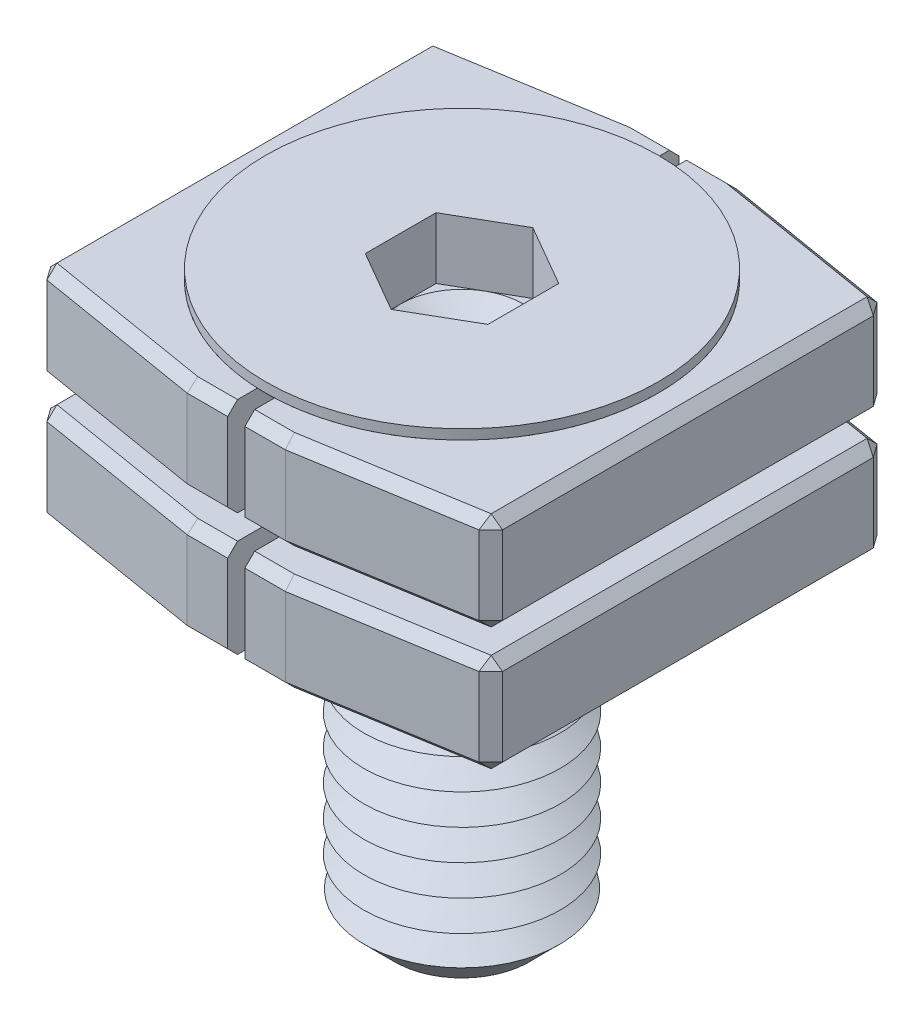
ISO-10303-21;
HEADER;
FILE_DESCRIPTION(('STEP AP214'),'2;1');
FILE_NAME('part.step','',(''),(''),'','','');
FILE_SCHEMA(('AUTOMOTIVE_DESIGN { 1 0 10303 214 1 1 1 1 }'));
ENDSEC;
DATA;
#1=APPLICATION_CONTEXT('core data for automotive mechanical design processes');
#2=APPLICATION_PROTOCOL_DEFINITION('international standard','automotive_design',2000,#1);
#3=PRODUCT_CONTEXT('',#1,'mechanical');
#4=PRODUCT('Part','Part','',(#3));
#5=PRODUCT_RELATED_PRODUCT_CATEGORY('part','',(#4));
#6=PRODUCT_DEFINITION_FORMATION('','',#4);
#7=PRODUCT_DEFINITION_CONTEXT('part definition',#1,'design');
#8=PRODUCT_DEFINITION('design','',#6,#7);
#9=PRODUCT_DEFINITION_SHAPE('','',#8);
#10=(LENGTH_UNIT() NAMED_UNIT(*) SI_UNIT(.MILLI.,.METRE.));
#11=(NAMED_UNIT(*) PLANE_ANGLE_UNIT() SI_UNIT($,.RADIAN.));
#12=(NAMED_UNIT(*) SI_UNIT($,.STERADIAN.) SOLID_ANGLE_UNIT());
#13=UNCERTAINTY_MEASURE_WITH_UNIT(LENGTH_MEASURE(1.E-05),#10,'distance_accuracy_value','');
#14=(GEOMETRIC_REPRESENTATION_CONTEXT(3) GLOBAL_UNCERTAINTY_ASSIGNED_CONTEXT((#13)) GLOBAL_UNIT_ASSIGNED_CONTEXT((#10,
#11,#12)) REPRESENTATION_CONTEXT('',''));
#15=CARTESIAN_POINT('',(0.,0.,0.));
#16=DIRECTION('',(0.,0.,1.));
#17=DIRECTION('',(1.,0.,0.));
#18=AXIS2_PLACEMENT_3D('',#15,#16,#17);
#19=CARTESIAN_POINT('',(0.,-2.1,0.));
#20=DIRECTION('',(0.,1.,0.));
#21=DIRECTION('',(0.,0.,1.));
#22=AXIS2_PLACEMENT_3D('',#19,#20,#21);
#23=PLANE('',#22);
#24=CARTESIAN_POINT('',(0.,-2.1,0.));
#25=DIRECTION('',(0.,1.,0.));
#26=DIRECTION('',(0.,0.,1.));
#27=AXIS2_PLACEMENT_3D('',#24,#25,#26);
#28=CIRCLE('',#27,2.5);
#29=CARTESIAN_POINT('',(1.25,-2.1,2.1650635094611));
#30=VERTEX_POINT('',#29);
#31=CARTESIAN_POINT('',(2.5,-2.1,0.));
#32=VERTEX_POINT('',#31);
#33=EDGE_CURVE('P0_E94',#30,#32,#28,.T.);
#34=ORIENTED_EDGE('',*,*,#33,.F.);
#35=DIRECTION('',(0.866025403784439,0.,-0.5));
#36=VECTOR('',#35,1.);
#37=CARTESIAN_POINT('',(0.,-2.1,2.88675134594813));
#38=LINE('',#37,#36);
#39=CARTESIAN_POINT('',(2.5,-2.1,1.44337567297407));
#40=VERTEX_POINT('',#39);
#41=EDGE_CURVE('P0_E117',#30,#40,#38,.T.);
#42=ORIENTED_EDGE('',*,*,#41,.T.);
#43=DIRECTION('',(0.,0.,-1.));
#44=VECTOR('',#43,1.);
#45=CARTESIAN_POINT('',(2.5,-2.1,1.44337567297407));
#46=LINE('',#45,#44);
#47=EDGE_CURVE('P0_E113',#40,#32,#46,.T.);
#48=ORIENTED_EDGE('',*,*,#47,.T.);
#49=EDGE_LOOP('',(#34,#42,#48));
#50=FACE_BOUND('',#49,.T.);
#51=ADVANCED_FACE('P0_F16',(#50),#23,.T.);
#52=CARTESIAN_POINT('',(0.,-2.1,0.));
#53=DIRECTION('',(0.,1.,0.));
#54=DIRECTION('',(0.,0.,1.));
#55=AXIS2_PLACEMENT_3D('',#52,#53,#54);
#56=CIRCLE('',#55,2.5);
#57=CARTESIAN_POINT('',(1.25,-2.1,-2.1650635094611));
#58=VERTEX_POINT('',#57);
#59=EDGE_CURVE('P0_E11',#32,#58,#56,.T.);
#60=ORIENTED_EDGE('',*,*,#59,.F.);
#61=CARTESIAN_POINT('',(2.5,-2.1,-1.44337567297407));
#62=VERTEX_POINT('',#61);
#63=EDGE_CURVE('P0_E105',#32,#62,#46,.T.);
#64=ORIENTED_EDGE('',*,*,#63,.T.);
#65=DIRECTION('',(-0.866025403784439,0.,-0.5));
#66=VECTOR('',#65,1.);
#67=CARTESIAN_POINT('',(2.5,-2.1,-1.44337567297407));
#68=LINE('',#67,#66);
#69=EDGE_CURVE('P0_E108',#62,#58,#68,.T.);
#70=ORIENTED_EDGE('',*,*,#69,.T.);
#71=EDGE_LOOP('',(#60,#64,#70));
#72=FACE_BOUND('',#71,.T.);
#73=ADVANCED_FACE('P0_F104',(#72),#23,.T.);
#74=CARTESIAN_POINT('',(-1.25,-2.1,-2.1650635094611));
#75=VERTEX_POINT('',#74);
#76=EDGE_CURVE('P0_E25',#58,#75,#56,.T.);
#77=ORIENTED_EDGE('',*,*,#76,.F.);
#78=CARTESIAN_POINT('',(0.,-2.1,-2.88675134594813));
#79=VERTEX_POINT('',#78);
#80=EDGE_CURVE('P0_E140',#58,#79,#68,.T.);
#81=ORIENTED_EDGE('',*,*,#80,.T.);
#82=DIRECTION('',(-0.866025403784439,0.,0.5));
#83=VECTOR('',#82,1.);
#84=CARTESIAN_POINT('',(0.,-2.1,-2.88675134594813));
#85=LINE('',#84,#83);
#86=EDGE_CURVE('P0_E303',#79,#75,#85,.T.);
#87=ORIENTED_EDGE('',*,*,#86,.T.);
#88=EDGE_LOOP('',(#77,#81,#87));
#89=FACE_BOUND('',#88,.T.);
#90=ADVANCED_FACE('P0_F269',(#89),#23,.T.);
#91=CARTESIAN_POINT('',(-2.5,-2.1,0.));
#92=VERTEX_POINT('',#91);
#93=EDGE_CURVE('P0_E298',#75,#92,#56,.T.);
#94=ORIENTED_EDGE('',*,*,#93,.F.);
#95=CARTESIAN_POINT('',(-2.5,-2.1,-1.44337567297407));
#96=VERTEX_POINT('',#95);
#97=EDGE_CURVE('P0_E307',#75,#96,#85,.T.);
#98=ORIENTED_EDGE('',*,*,#97,.T.);
#99=DIRECTION('',(0.,0.,1.));
#100=VECTOR('',#99,1.);
#101=CARTESIAN_POINT('',(-2.5,-2.1,-1.44337567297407));
#102=LINE('',#101,#100);
#103=EDGE_CURVE('P0_E302',#96,#92,#102,.T.);
#104=ORIENTED_EDGE('',*,*,#103,.T.);
#105=EDGE_LOOP('',(#94,#98,#104));
#106=FACE_BOUND('',#105,.T.);
#107=ADVANCED_FACE('P0_F283',(#106),#23,.T.);
#108=CARTESIAN_POINT('',(-1.25,-2.1,2.1650635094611));
#109=VERTEX_POINT('',#108);
#110=EDGE_CURVE('P0_E32',#92,#109,#56,.T.);
#111=ORIENTED_EDGE('',*,*,#110,.F.);
#112=CARTESIAN_POINT('',(-2.5,-2.1,1.44337567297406));
#113=VERTEX_POINT('',#112);
#114=EDGE_CURVE('P0_E294',#92,#113,#102,.T.);
#115=ORIENTED_EDGE('',*,*,#114,.T.);
#116=DIRECTION('',(0.866025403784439,0.,0.5));
#117=VECTOR('',#116,1.);
#118=CARTESIAN_POINT('',(-2.5,-2.1,1.44337567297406));
#119=LINE('',#118,#117);
#120=EDGE_CURVE('P0_E297',#113,#109,#119,.T.);
#121=ORIENTED_EDGE('',*,*,#120,.T.);
#122=EDGE_LOOP('',(#111,#115,#121));
#123=FACE_BOUND('',#122,.T.);
#124=ADVANCED_FACE('P0_F274',(#123),#23,.T.);
#125=CARTESIAN_POINT('',(0.,0.4,0.));
#126=DIRECTION('',(0.,1.,0.));
#127=DIRECTION('',(0.,0.,1.));
#128=AXIS2_PLACEMENT_3D('',#125,#126,#127);
#129=PLANE('',#128);
#130=DIRECTION('',(-0.866025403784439,0.,-0.5));
#131=VECTOR('',#130,1.);
#132=CARTESIAN_POINT('',(2.5,0.4,-1.44337567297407));
#133=LINE('',#132,#131);
#134=CARTESIAN_POINT('',(2.5,0.4,-1.44337567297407));
#135=VERTEX_POINT('',#134);
#136=CARTESIAN_POINT('',(0.,0.4,-2.88675134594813));
#137=VERTEX_POINT('',#136);
#138=EDGE_CURVE('P0_E40',#135,#137,#133,.T.);
#139=ORIENTED_EDGE('',*,*,#138,.F.);
#140=DIRECTION('',(0.,0.,-1.));
#141=VECTOR('',#140,1.);
#142=CARTESIAN_POINT('',(2.5,0.4,1.44337567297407));
#143=LINE('',#142,#141);
#144=CARTESIAN_POINT('',(2.5,0.4,1.44337567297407));
#145=VERTEX_POINT('',#144);
#146=EDGE_CURVE('P0_E138',#145,#135,#143,.T.);
#147=ORIENTED_EDGE('',*,*,#146,.F.);
#148=DIRECTION('',(0.866025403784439,0.,-0.5));
#149=VECTOR('',#148,1.);
#150=CARTESIAN_POINT('',(0.,0.4,2.88675134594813));
#151=LINE('',#150,#149);
#152=CARTESIAN_POINT('',(0.,0.4,2.88675134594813));
#153=VERTEX_POINT('',#152);
#154=EDGE_CURVE('P0_E135',#153,#145,#151,.T.);
#155=ORIENTED_EDGE('',*,*,#154,.F.);
#156=DIRECTION('',(0.866025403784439,0.,0.5));
#157=VECTOR('',#156,1.);
#158=CARTESIAN_POINT('',(-2.5,0.4,1.44337567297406));
#159=LINE('',#158,#157);
#160=CARTESIAN_POINT('',(-2.5,0.4,1.44337567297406));
#161=VERTEX_POINT('',#160);
#162=EDGE_CURVE('P0_E132',#161,#153,#159,.T.);
#163=ORIENTED_EDGE('',*,*,#162,.F.);
#164=DIRECTION('',(0.,0.,1.));
#165=VECTOR('',#164,1.);
#166=CARTESIAN_POINT('',(-2.5,0.4,-1.44337567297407));
#167=LINE('',#166,#165);
#168=CARTESIAN_POINT('',(-2.5,0.4,-1.44337567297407));
#169=VERTEX_POINT('',#168);
#170=EDGE_CURVE('P0_E129',#169,#161,#167,.T.);
#171=ORIENTED_EDGE('',*,*,#170,.F.);
#172=DIRECTION('',(-0.866025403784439,0.,0.5));
#173=VECTOR('',#172,1.);
#174=CARTESIAN_POINT('',(0.,0.4,-2.88675134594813));
#175=LINE('',#174,#173);
#176=EDGE_CURVE('P0_E126',#137,#169,#175,.T.);
#177=ORIENTED_EDGE('',*,*,#176,.F.);
#178=EDGE_LOOP('',(#139,#147,#155,#163,#171,#177));
#179=FACE_BOUND('',#178,.T.);
#180=CARTESIAN_POINT('',(0.,0.4,0.));
#181=DIRECTION('',(0.,1.,0.));
#182=DIRECTION('',(0.,0.,1.));
#183=AXIS2_PLACEMENT_3D('',#180,#181,#182);
#184=CIRCLE('',#183,8.);
#185=CARTESIAN_POINT('',(0.,0.4,8.));
#186=VERTEX_POINT('',#185);
#187=EDGE_CURVE('P0_E237',#186,#186,#184,.T.);
#188=ORIENTED_EDGE('',*,*,#187,.T.);
#189=EDGE_LOOP('',(#188));
#190=FACE_BOUND('',#189,.T.);
#191=ADVANCED_FACE('P0_F282',(#179,#190),#129,.T.);
#192=CARTESIAN_POINT('',(0.,63.4354418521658,0.));
#193=DIRECTION('',(0.,1.,0.));
#194=DIRECTION('',(0.,0.,1.));
#195=AXIS2_PLACEMENT_3D('',#192,#193,#194);
#196=CYLINDRICAL_SURFACE('',#195,8.);
#197=CARTESIAN_POINT('',(0.,0.,0.));
#198=DIRECTION('',(0.,1.,0.));
#199=DIRECTION('',(0.,0.,1.));
#200=AXIS2_PLACEMENT_3D('',#197,#198,#199);
#201=CIRCLE('',#200,8.);
#202=CARTESIAN_POINT('',(0.,0.,8.));
#203=VERTEX_POINT('',#202);
#204=EDGE_CURVE('P0_E234',#203,#203,#201,.T.);
#205=ORIENTED_EDGE('',*,*,#204,.T.);
#206=EDGE_LOOP('',(#205));
#207=FACE_BOUND('',#206,.T.);
#208=ORIENTED_EDGE('',*,*,#187,.F.);
#209=EDGE_LOOP('',(#208));
#210=FACE_BOUND('',#209,.T.);
#211=ADVANCED_FACE('P0_F289',(#207,#210),#196,.T.);
#212=CARTESIAN_POINT('',(0.,0.,0.));
#213=DIRECTION('',(0.,1.,0.));
#214=DIRECTION('',(0.,0.,1.));
#215=AXIS2_PLACEMENT_3D('',#212,#213,#214);
#216=CONICAL_SURFACE('',#215,8.,0.78539816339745);
#217=CARTESIAN_POINT('',(0.,-3.99999999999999,0.));
#218=DIRECTION('',(0.,1.,0.));
#219=DIRECTION('',(0.,0.,1.));
#220=AXIS2_PLACEMENT_3D('',#217,#218,#219);
#221=CIRCLE('',#220,4.);
#222=CARTESIAN_POINT('',(0.,-3.99999999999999,4.));
#223=VERTEX_POINT('',#222);
#224=EDGE_CURVE('P0_E231',#223,#223,#221,.T.);
#225=ORIENTED_EDGE('',*,*,#224,.T.);
#226=EDGE_LOOP('',(#225));
#227=FACE_BOUND('',#226,.T.);
#228=ORIENTED_EDGE('',*,*,#204,.F.);
#229=EDGE_LOOP('',(#228));
#230=FACE_BOUND('',#229,.T.);
#231=ADVANCED_FACE('P0_F361',(#227,#230),#216,.T.);
#232=CARTESIAN_POINT('',(0.,-4.62499999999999,0.));
#233=DIRECTION('',(0.,1.,0.));
#234=DIRECTION('',(0.,0.,1.));
#235=AXIS2_PLACEMENT_3D('',#232,#233,#234);
#236=CONICAL_SURFACE('',#235,2.91746824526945,1.0471975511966);
#237=ORIENTED_EDGE('',*,*,#224,.F.);
#238=EDGE_LOOP('',(#237));
#239=FACE_BOUND('',#238,.T.);
#240=CARTESIAN_POINT('',(0.,-4.62499999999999,0.));
#241=DIRECTION('',(0.,1.,0.));
#242=DIRECTION('',(0.,0.,1.));
#243=AXIS2_PLACEMENT_3D('',#240,#241,#242);
#244=CIRCLE('',#243,2.91746824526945);
#245=CARTESIAN_POINT('',(0.,-4.62499999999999,2.91746824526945));
#246=VERTEX_POINT('',#245);
#247=EDGE_CURVE('P0_E228',#246,#246,#244,.T.);
#248=ORIENTED_EDGE('',*,*,#247,.T.);
#249=EDGE_LOOP('',(#248));
#250=FACE_BOUND('',#249,.T.);
#251=ADVANCED_FACE('P0_F371',(#239,#250),#236,.T.);
#252=CARTESIAN_POINT('',(0.,-5.24999999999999,0.));
#253=DIRECTION('',(0.,-1.,0.));
#254=DIRECTION('',(0.,0.,-1.));
#255=AXIS2_PLACEMENT_3D('',#252,#253,#254);
#256=CONICAL_SURFACE('',#255,4.,1.0471975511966);
#257=ORIENTED_EDGE('',*,*,#247,.F.);
#258=EDGE_LOOP('',(#257));
#259=FACE_BOUND('',#258,.T.);
#260=CARTESIAN_POINT('',(0.,-5.24999999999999,0.));
#261=DIRECTION('',(0.,1.,0.));
#262=DIRECTION('',(0.,0.,1.));
#263=AXIS2_PLACEMENT_3D('',#260,#261,#262);
#264=CIRCLE('',#263,4.);
#265=CARTESIAN_POINT('',(0.,-5.24999999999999,4.));
#266=VERTEX_POINT('',#265);
#267=EDGE_CURVE('P0_E225',#266,#266,#264,.T.);
#268=ORIENTED_EDGE('',*,*,#267,.T.);
#269=EDGE_LOOP('',(#268));
#270=FACE_BOUND('',#269,.T.);
#271=ADVANCED_FACE('P0_F380',(#259,#270),#256,.T.);
#272=CARTESIAN_POINT('',(0.,-5.87499999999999,0.));
#273=DIRECTION('',(0.,1.,0.));
#274=DIRECTION('',(0.,0.,1.));
#275=AXIS2_PLACEMENT_3D('',#272,#273,#274);
#276=CONICAL_SURFACE('',#275,2.91746824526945,1.0471975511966);
#277=ORIENTED_EDGE('',*,*,#267,.F.);
#278=EDGE_LOOP('',(#277));
#279=FACE_BOUND('',#278,.T.);
#280=CARTESIAN_POINT('',(0.,-5.87499999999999,0.));
#281=DIRECTION('',(0.,1.,0.));
#282=DIRECTION('',(0.,0.,1.));
#283=AXIS2_PLACEMENT_3D('',#280,#281,#282);
#284=CIRCLE('',#283,2.91746824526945);
#285=CARTESIAN_POINT('',(0.,-5.87499999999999,2.91746824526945));
#286=VERTEX_POINT('',#285);
#287=EDGE_CURVE('P0_E222',#286,#286,#284,.T.);
#288=ORIENTED_EDGE('',*,*,#287,.T.);
#289=EDGE_LOOP('',(#288));
#290=FACE_BOUND('',#289,.T.);
#291=ADVANCED_FACE('P0_F389',(#279,#290),#276,.T.);
#292=CARTESIAN_POINT('',(0.,-6.49999999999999,0.));
#293=DIRECTION('',(0.,-1.,0.));
#294=DIRECTION('',(0.,0.,-1.));
#295=AXIS2_PLACEMENT_3D('',#292,#293,#294);
#296=CONICAL_SURFACE('',#295,4.,1.0471975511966);
#297=ORIENTED_EDGE('',*,*,#287,.F.);
#298=EDGE_LOOP('',(#297));
#299=FACE_BOUND('',#298,.T.);
#300=CARTESIAN_POINT('',(0.,-6.49999999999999,0.));
#301=DIRECTION('',(0.,1.,0.));
#302=DIRECTION('',(0.,0.,1.));
#303=AXIS2_PLACEMENT_3D('',#300,#301,#302);
#304=CIRCLE('',#303,4.);
#305=CARTESIAN_POINT('',(0.,-6.49999999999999,4.));
#306=VERTEX_POINT('',#305);
#307=EDGE_CURVE('P0_E219',#306,#306,#304,.T.);
#308=ORIENTED_EDGE('',*,*,#307,.T.);
#309=EDGE_LOOP('',(#308));
#310=FACE_BOUND('',#309,.T.);
#311=ADVANCED_FACE('P0_F399',(#299,#310),#296,.T.);
#312=CARTESIAN_POINT('',(0.,-7.12499999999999,0.));
#313=DIRECTION('',(0.,1.,0.));
#314=DIRECTION('',(0.,0.,1.));
#315=AXIS2_PLACEMENT_3D('',#312,#313,#314);
#316=CONICAL_SURFACE('',#315,2.91746824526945,1.0471975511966);
#317=ORIENTED_EDGE('',*,*,#307,.F.);
#318=EDGE_LOOP('',(#317));
#319=FACE_BOUND('',#318,.T.);
#320=CARTESIAN_POINT('',(0.,-7.12499999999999,0.));
#321=DIRECTION('',(0.,1.,0.));
#322=DIRECTION('',(0.,0.,1.));
#323=AXIS2_PLACEMENT_3D('',#320,#321,#322);
#324=CIRCLE('',#323,2.91746824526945);
#325=CARTESIAN_POINT('',(0.,-7.12499999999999,2.91746824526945));
#326=VERTEX_POINT('',#325);
#327=EDGE_CURVE('P0_E216',#326,#326,#324,.T.);
#328=ORIENTED_EDGE('',*,*,#327,.T.);
#329=EDGE_LOOP('',(#328));
#330=FACE_BOUND('',#329,.T.);
#331=ADVANCED_FACE('P0_F409',(#319,#330),#316,.T.);
#332=CARTESIAN_POINT('',(0.,-7.74999999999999,0.));
#333=DIRECTION('',(0.,-1.,0.));
#334=DIRECTION('',(0.,0.,-1.));
#335=AXIS2_PLACEMENT_3D('',#332,#333,#334);
#336=CONICAL_SURFACE('',#335,4.,1.0471975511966);
#337=ORIENTED_EDGE('',*,*,#327,.F.);
#338=EDGE_LOOP('',(#337));
#339=FACE_BOUND('',#338,.T.);
#340=CARTESIAN_POINT('',(0.,-7.74999999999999,0.));
#341=DIRECTION('',(0.,1.,0.));
#342=DIRECTION('',(0.,0.,1.));
#343=AXIS2_PLACEMENT_3D('',#340,#341,#342);
#344=CIRCLE('',#343,4.);
#345=CARTESIAN_POINT('',(0.,-7.74999999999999,4.));
#346=VERTEX_POINT('',#345);
#347=EDGE_CURVE('P0_E213',#346,#346,#344,.T.);
#348=ORIENTED_EDGE('',*,*,#347,.T.);
#349=EDGE_LOOP('',(#348));
#350=FACE_BOUND('',#349,.T.);
#351=ADVANCED_FACE('P0_F419',(#339,#350),#336,.T.);
#352=CARTESIAN_POINT('',(0.,-8.37499999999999,0.));
#353=DIRECTION('',(0.,1.,0.));
#354=DIRECTION('',(0.,0.,1.));
#355=AXIS2_PLACEMENT_3D('',#352,#353,#354);
#356=CONICAL_SURFACE('',#355,2.91746824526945,1.0471975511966);
#357=ORIENTED_EDGE('',*,*,#347,.F.);
#358=EDGE_LOOP('',(#357));
#359=FACE_BOUND('',#358,.T.);
#360=CARTESIAN_POINT('',(0.,-8.37499999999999,0.));
#361=DIRECTION('',(0.,1.,0.));
#362=DIRECTION('',(0.,0.,1.));
#363=AXIS2_PLACEMENT_3D('',#360,#361,#362);
#364=CIRCLE('',#363,2.91746824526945);
#365=CARTESIAN_POINT('',(0.,-8.37499999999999,2.91746824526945));
#366=VERTEX_POINT('',#365);
#367=EDGE_CURVE('P0_E210',#366,#366,#364,.T.);
#368=ORIENTED_EDGE('',*,*,#367,.T.);
#369=EDGE_LOOP('',(#368));
#370=FACE_BOUND('',#369,.T.);
#371=ADVANCED_FACE('P0_F429',(#359,#370),#356,.T.);
#372=CARTESIAN_POINT('',(0.,-8.99999999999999,0.));
#373=DIRECTION('',(0.,-1.,0.));
#374=DIRECTION('',(0.,0.,-1.));
#375=AXIS2_PLACEMENT_3D('',#372,#373,#374);
#376=CONICAL_SURFACE('',#375,4.,1.0471975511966);
#377=ORIENTED_EDGE('',*,*,#367,.F.);
#378=EDGE_LOOP('',(#377));
#379=FACE_BOUND('',#378,.T.);
#380=CARTESIAN_POINT('',(0.,-8.99999999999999,0.));
#381=DIRECTION('',(0.,1.,0.));
#382=DIRECTION('',(0.,0.,1.));
#383=AXIS2_PLACEMENT_3D('',#380,#381,#382);
#384=CIRCLE('',#383,4.);
#385=CARTESIAN_POINT('',(0.,-8.99999999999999,4.));
#386=VERTEX_POINT('',#385);
#387=EDGE_CURVE('P0_E207',#386,#386,#384,.T.);
#388=ORIENTED_EDGE('',*,*,#387,.T.);
#389=EDGE_LOOP('',(#388));
#390=FACE_BOUND('',#389,.T.);
#391=ADVANCED_FACE('P0_F439',(#379,#390),#376,.T.);
#392=CARTESIAN_POINT('',(0.,-9.62499999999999,0.));
#393=DIRECTION('',(0.,1.,0.));
#394=DIRECTION('',(0.,0.,1.));
#395=AXIS2_PLACEMENT_3D('',#392,#393,#394);
#396=CONICAL_SURFACE('',#395,2.91746824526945,1.0471975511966);
#397=ORIENTED_EDGE('',*,*,#387,.F.);
#398=EDGE_LOOP('',(#397));
#399=FACE_BOUND('',#398,.T.);
#400=CARTESIAN_POINT('',(0.,-9.62499999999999,0.));
#401=DIRECTION('',(0.,1.,0.));
#402=DIRECTION('',(0.,0.,1.));
#403=AXIS2_PLACEMENT_3D('',#400,#401,#402);
#404=CIRCLE('',#403,2.91746824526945);
#405=CARTESIAN_POINT('',(0.,-9.62499999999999,2.91746824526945));
#406=VERTEX_POINT('',#405);
#407=EDGE_CURVE('P0_E204',#406,#406,#404,.T.);
#408=ORIENTED_EDGE('',*,*,#407,.T.);
#409=EDGE_LOOP('',(#408));
#410=FACE_BOUND('',#409,.T.);
#411=ADVANCED_FACE('P0_F449',(#399,#410),#396,.T.);
#412=CARTESIAN_POINT('',(0.,-10.25,0.));
#413=DIRECTION('',(0.,-1.,0.));
#414=DIRECTION('',(0.,0.,-1.));
#415=AXIS2_PLACEMENT_3D('',#412,#413,#414);
#416=CONICAL_SURFACE('',#415,4.,1.0471975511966);
#417=ORIENTED_EDGE('',*,*,#407,.F.);
#418=EDGE_LOOP('',(#417));
#419=FACE_BOUND('',#418,.T.);
#420=CARTESIAN_POINT('',(0.,-10.25,0.));
#421=DIRECTION('',(0.,1.,0.));
#422=DIRECTION('',(0.,0.,1.));
#423=AXIS2_PLACEMENT_3D('',#420,#421,#422);
#424=CIRCLE('',#423,4.);
#425=CARTESIAN_POINT('',(0.,-10.25,4.));
#426=VERTEX_POINT('',#425);
#427=EDGE_CURVE('P0_E201',#426,#426,#424,.T.);
#428=ORIENTED_EDGE('',*,*,#427,.T.);
#429=EDGE_LOOP('',(#428));
#430=FACE_BOUND('',#429,.T.);
#431=ADVANCED_FACE('P0_F459',(#419,#430),#416,.T.);
#432=CARTESIAN_POINT('',(0.,-10.875,0.));
#433=DIRECTION('',(0.,1.,0.));
#434=DIRECTION('',(0.,0.,1.));
#435=AXIS2_PLACEMENT_3D('',#432,#433,#434);
#436=CONICAL_SURFACE('',#435,2.91746824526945,1.0471975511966);
#437=ORIENTED_EDGE('',*,*,#427,.F.);
#438=EDGE_LOOP('',(#437));
#439=FACE_BOUND('',#438,.T.);
#440=CARTESIAN_POINT('',(0.,-10.875,0.));
#441=DIRECTION('',(0.,1.,0.));
#442=DIRECTION('',(0.,0.,1.));
#443=AXIS2_PLACEMENT_3D('',#440,#441,#442);
#444=CIRCLE('',#443,2.91746824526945);
#445=CARTESIAN_POINT('',(0.,-10.875,2.91746824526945));
#446=VERTEX_POINT('',#445);
#447=EDGE_CURVE('P0_E198',#446,#446,#444,.T.);
#448=ORIENTED_EDGE('',*,*,#447,.T.);
#449=EDGE_LOOP('',(#448));
#450=FACE_BOUND('',#449,.T.);
#451=ADVANCED_FACE('P0_F469',(#439,#450),#436,.T.);
#452=CARTESIAN_POINT('',(0.,-11.5,0.));
#453=DIRECTION('',(0.,-1.,0.));
#454=DIRECTION('',(0.,0.,-1.));
#455=AXIS2_PLACEMENT_3D('',#452,#453,#454);
#456=CONICAL_SURFACE('',#455,4.,1.0471975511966);
#457=ORIENTED_EDGE('',*,*,#447,.F.);
#458=EDGE_LOOP('',(#457));
#459=FACE_BOUND('',#458,.T.);
#460=CARTESIAN_POINT('',(0.,-11.5,0.));
#461=DIRECTION('',(0.,1.,0.));
#462=DIRECTION('',(0.,0.,1.));
#463=AXIS2_PLACEMENT_3D('',#460,#461,#462);
#464=CIRCLE('',#463,4.);
#465=CARTESIAN_POINT('',(0.,-11.5,4.));
#466=VERTEX_POINT('',#465);
#467=EDGE_CURVE('P0_E195',#466,#466,#464,.T.);
#468=ORIENTED_EDGE('',*,*,#467,.T.);
#469=EDGE_LOOP('',(#468));
#470=FACE_BOUND('',#469,.T.);
#471=ADVANCED_FACE('P0_F479',(#459,#470),#456,.T.);
#472=CARTESIAN_POINT('',(0.,-12.125,0.));
#473=DIRECTION('',(0.,1.,0.));
#474=DIRECTION('',(0.,0.,1.));
#475=AXIS2_PLACEMENT_3D('',#472,#473,#474);
#476=CONICAL_SURFACE('',#475,2.91746824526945,1.0471975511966);
#477=ORIENTED_EDGE('',*,*,#467,.F.);
#478=EDGE_LOOP('',(#477));
#479=FACE_BOUND('',#478,.T.);
#480=CARTESIAN_POINT('',(0.,-12.125,0.));
#481=DIRECTION('',(0.,1.,0.));
#482=DIRECTION('',(0.,0.,1.));
#483=AXIS2_PLACEMENT_3D('',#480,#481,#482);
#484=CIRCLE('',#483,2.91746824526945);
#485=CARTESIAN_POINT('',(0.,-12.125,2.91746824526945));
#486=VERTEX_POINT('',#485);
#487=EDGE_CURVE('P0_E192',#486,#486,#484,.T.);
#488=ORIENTED_EDGE('',*,*,#487,.T.);
#489=EDGE_LOOP('',(#488));
#490=FACE_BOUND('',#489,.T.);
#491=ADVANCED_FACE('P0_F489',(#479,#490),#476,.T.);
#492=CARTESIAN_POINT('',(0.,-12.75,0.));
#493=DIRECTION('',(0.,-1.,0.));
#494=DIRECTION('',(0.,0.,-1.));
#495=AXIS2_PLACEMENT_3D('',#492,#493,#494);
#496=CONICAL_SURFACE('',#495,4.,1.0471975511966);
#497=ORIENTED_EDGE('',*,*,#487,.F.);
#498=EDGE_LOOP('',(#497));
#499=FACE_BOUND('',#498,.T.);
#500=CARTESIAN_POINT('',(0.,-12.75,0.));
#501=DIRECTION('',(0.,1.,0.));
#502=DIRECTION('',(0.,0.,1.));
#503=AXIS2_PLACEMENT_3D('',#500,#501,#502);
#504=CIRCLE('',#503,4.);
#505=CARTESIAN_POINT('',(0.,-12.75,4.));
#506=VERTEX_POINT('',#505);
#507=EDGE_CURVE('P0_E189',#506,#506,#504,.T.);
#508=ORIENTED_EDGE('',*,*,#507,.T.);
#509=EDGE_LOOP('',(#508));
#510=FACE_BOUND('',#509,.T.);
#511=ADVANCED_FACE('P0_F499',(#499,#510),#496,.T.);
#512=CARTESIAN_POINT('',(0.,-13.375,0.));
#513=DIRECTION('',(0.,1.,0.));
#514=DIRECTION('',(0.,0.,1.));
#515=AXIS2_PLACEMENT_3D('',#512,#513,#514);
#516=CONICAL_SURFACE('',#515,2.91746824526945,1.0471975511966);
#517=ORIENTED_EDGE('',*,*,#507,.F.);
#518=EDGE_LOOP('',(#517));
#519=FACE_BOUND('',#518,.T.);
#520=CARTESIAN_POINT('',(0.,-13.375,0.));
#521=DIRECTION('',(0.,1.,0.));
#522=DIRECTION('',(0.,0.,1.));
#523=AXIS2_PLACEMENT_3D('',#520,#521,#522);
#524=CIRCLE('',#523,2.91746824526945);
#525=CARTESIAN_POINT('',(0.,-13.375,2.91746824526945));
#526=VERTEX_POINT('',#525);
#527=EDGE_CURVE('P0_E186',#526,#526,#524,.T.);
#528=ORIENTED_EDGE('',*,*,#527,.T.);
#529=EDGE_LOOP('',(#528));
#530=FACE_BOUND('',#529,.T.);
#531=ADVANCED_FACE('P0_F509',(#519,#530),#516,.T.);
#532=CARTESIAN_POINT('',(0.,-14.,0.));
#533=DIRECTION('',(0.,-1.,0.));
#534=DIRECTION('',(0.,0.,-1.));
#535=AXIS2_PLACEMENT_3D('',#532,#533,#534);
#536=CONICAL_SURFACE('',#535,4.,1.0471975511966);
#537=ORIENTED_EDGE('',*,*,#527,.F.);
#538=EDGE_LOOP('',(#537));
#539=FACE_BOUND('',#538,.T.);
#540=CARTESIAN_POINT('',(0.,-14.,0.));
#541=DIRECTION('',(0.,1.,0.));
#542=DIRECTION('',(0.,0.,1.));
#543=AXIS2_PLACEMENT_3D('',#540,#541,#542);
#544=CIRCLE('',#543,4.);
#545=CARTESIAN_POINT('',(0.,-14.,4.));
#546=VERTEX_POINT('',#545);
#547=EDGE_CURVE('P0_E183',#546,#546,#544,.T.);
#548=ORIENTED_EDGE('',*,*,#547,.T.);
#549=EDGE_LOOP('',(#548));
#550=FACE_BOUND('',#549,.T.);
#551=ADVANCED_FACE('P0_F519',(#539,#550),#536,.T.);
#552=CARTESIAN_POINT('',(0.,-14.625,0.));
#553=DIRECTION('',(0.,1.,0.));
#554=DIRECTION('',(0.,0.,1.));
#555=AXIS2_PLACEMENT_3D('',#552,#553,#554);
#556=CONICAL_SURFACE('',#555,2.91746824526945,1.0471975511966);
#557=ORIENTED_EDGE('',*,*,#547,.F.);
#558=EDGE_LOOP('',(#557));
#559=FACE_BOUND('',#558,.T.);
#560=CARTESIAN_POINT('',(0.,-14.625,0.));
#561=DIRECTION('',(0.,1.,0.));
#562=DIRECTION('',(0.,0.,1.));
#563=AXIS2_PLACEMENT_3D('',#560,#561,#562);
#564=CIRCLE('',#563,2.91746824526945);
#565=CARTESIAN_POINT('',(0.,-14.625,2.91746824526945));
#566=VERTEX_POINT('',#565);
#567=EDGE_CURVE('P0_E180',#566,#566,#564,.T.);
#568=ORIENTED_EDGE('',*,*,#567,.T.);
#569=EDGE_LOOP('',(#568));
#570=FACE_BOUND('',#569,.T.);
#571=ADVANCED_FACE('P0_F529',(#559,#570),#556,.T.);
#572=CARTESIAN_POINT('',(0.,-15.25,0.));
#573=DIRECTION('',(0.,-1.,0.));
#574=DIRECTION('',(0.,0.,-1.));
#575=AXIS2_PLACEMENT_3D('',#572,#573,#574);
#576=CONICAL_SURFACE('',#575,4.,1.0471975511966);
#577=ORIENTED_EDGE('',*,*,#567,.F.);
#578=EDGE_LOOP('',(#577));
#579=FACE_BOUND('',#578,.T.);
#580=CARTESIAN_POINT('',(0.,-15.25,0.));
#581=DIRECTION('',(0.,1.,0.));
#582=DIRECTION('',(0.,0.,1.));
#583=AXIS2_PLACEMENT_3D('',#580,#581,#582);
#584=CIRCLE('',#583,4.);
#585=CARTESIAN_POINT('',(0.,-15.25,4.));
#586=VERTEX_POINT('',#585);
#587=EDGE_CURVE('P0_E177',#586,#586,#584,.T.);
#588=ORIENTED_EDGE('',*,*,#587,.T.);
#589=EDGE_LOOP('',(#588));
#590=FACE_BOUND('',#589,.T.);
#591=ADVANCED_FACE('P0_F539',(#579,#590),#576,.T.);
#592=CARTESIAN_POINT('',(0.,-15.875,0.));
#593=DIRECTION('',(0.,1.,0.));
#594=DIRECTION('',(0.,0.,1.));
#595=AXIS2_PLACEMENT_3D('',#592,#593,#594);
#596=CONICAL_SURFACE('',#595,2.91746824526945,1.0471975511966);
#597=ORIENTED_EDGE('',*,*,#587,.F.);
#598=EDGE_LOOP('',(#597));
#599=FACE_BOUND('',#598,.T.);
#600=CARTESIAN_POINT('',(0.,-15.875,0.));
#601=DIRECTION('',(0.,1.,0.));
#602=DIRECTION('',(0.,0.,1.));
#603=AXIS2_PLACEMENT_3D('',#600,#601,#602);
#604=CIRCLE('',#603,2.91746824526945);
#605=CARTESIAN_POINT('',(0.,-15.875,2.91746824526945));
#606=VERTEX_POINT('',#605);
#607=EDGE_CURVE('P0_E174',#606,#606,#604,.T.);
#608=ORIENTED_EDGE('',*,*,#607,.T.);
#609=EDGE_LOOP('',(#608));
#610=FACE_BOUND('',#609,.T.);
#611=ADVANCED_FACE('P0_F549',(#599,#610),#596,.T.);
#612=CARTESIAN_POINT('',(0.,-16.5,0.));
#613=DIRECTION('',(0.,-1.,0.));
#614=DIRECTION('',(0.,0.,-1.));
#615=AXIS2_PLACEMENT_3D('',#612,#613,#614);
#616=CONICAL_SURFACE('',#615,4.,1.0471975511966);
#617=ORIENTED_EDGE('',*,*,#607,.F.);
#618=EDGE_LOOP('',(#617));
#619=FACE_BOUND('',#618,.T.);
#620=CARTESIAN_POINT('',(0.,-16.5,0.));
#621=DIRECTION('',(0.,1.,0.));
#622=DIRECTION('',(0.,0.,1.));
#623=AXIS2_PLACEMENT_3D('',#620,#621,#622);
#624=CIRCLE('',#623,4.);
#625=CARTESIAN_POINT('',(0.,-16.5,4.));
#626=VERTEX_POINT('',#625);
#627=EDGE_CURVE('P0_E171',#626,#626,#624,.T.);
#628=ORIENTED_EDGE('',*,*,#627,.T.);
#629=EDGE_LOOP('',(#628));
#630=FACE_BOUND('',#629,.T.);
#631=ADVANCED_FACE('P0_F559',(#619,#630),#616,.T.);
#632=CARTESIAN_POINT('',(0.,-17.125,0.));
#633=DIRECTION('',(0.,1.,0.));
#634=DIRECTION('',(0.,0.,1.));
#635=AXIS2_PLACEMENT_3D('',#632,#633,#634);
#636=CONICAL_SURFACE('',#635,2.91746824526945,1.0471975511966);
#637=ORIENTED_EDGE('',*,*,#627,.F.);
#638=EDGE_LOOP('',(#637));
#639=FACE_BOUND('',#638,.T.);
#640=CARTESIAN_POINT('',(0.,-17.125,0.));
#641=DIRECTION('',(0.,1.,0.));
#642=DIRECTION('',(0.,0.,1.));
#643=AXIS2_PLACEMENT_3D('',#640,#641,#642);
#644=CIRCLE('',#643,2.91746824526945);
#645=CARTESIAN_POINT('',(0.,-17.125,2.91746824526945));
#646=VERTEX_POINT('',#645);
#647=EDGE_CURVE('P0_E168',#646,#646,#644,.T.);
#648=ORIENTED_EDGE('',*,*,#647,.T.);
#649=EDGE_LOOP('',(#648));
#650=FACE_BOUND('',#649,.T.);
#651=ADVANCED_FACE('P0_F569',(#639,#650),#636,.T.);
#652=CARTESIAN_POINT('',(0.,-17.75,0.));
#653=DIRECTION('',(0.,-1.,0.));
#654=DIRECTION('',(0.,0.,-1.));
#655=AXIS2_PLACEMENT_3D('',#652,#653,#654);
#656=CONICAL_SURFACE('',#655,4.,1.0471975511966);
#657=ORIENTED_EDGE('',*,*,#647,.F.);
#658=EDGE_LOOP('',(#657));
#659=FACE_BOUND('',#658,.T.);
#660=CARTESIAN_POINT('',(0.,-17.75,0.));
#661=DIRECTION('',(0.,1.,0.));
#662=DIRECTION('',(0.,0.,1.));
#663=AXIS2_PLACEMENT_3D('',#660,#661,#662);
#664=CIRCLE('',#663,4.);
#665=CARTESIAN_POINT('',(0.,-17.75,4.));
#666=VERTEX_POINT('',#665);
#667=EDGE_CURVE('P0_E165',#666,#666,#664,.T.);
#668=ORIENTED_EDGE('',*,*,#667,.T.);
#669=EDGE_LOOP('',(#668));
#670=FACE_BOUND('',#669,.T.);
#671=ADVANCED_FACE('P0_F579',(#659,#670),#656,.T.);
#672=CARTESIAN_POINT('',(0.,-18.375,0.));
#673=DIRECTION('',(0.,1.,0.));
#674=DIRECTION('',(0.,0.,1.));
#675=AXIS2_PLACEMENT_3D('',#672,#673,#674);
#676=CONICAL_SURFACE('',#675,2.91746824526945,1.0471975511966);
#677=ORIENTED_EDGE('',*,*,#667,.F.);
#678=EDGE_LOOP('',(#677));
#679=FACE_BOUND('',#678,.T.);
#680=CARTESIAN_POINT('',(0.,-18.375,0.));
#681=DIRECTION('',(0.,1.,0.));
#682=DIRECTION('',(0.,0.,1.));
#683=AXIS2_PLACEMENT_3D('',#680,#681,#682);
#684=CIRCLE('',#683,2.91746824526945);
#685=CARTESIAN_POINT('',(0.,-18.375,2.91746824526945));
#686=VERTEX_POINT('',#685);
#687=EDGE_CURVE('P0_E162',#686,#686,#684,.T.);
#688=ORIENTED_EDGE('',*,*,#687,.T.);
#689=EDGE_LOOP('',(#688));
#690=FACE_BOUND('',#689,.T.);
#691=ADVANCED_FACE('P0_F589',(#679,#690),#676,.T.);
#692=CARTESIAN_POINT('',(0.,-19.,0.));
#693=DIRECTION('',(0.,-1.,0.));
#694=DIRECTION('',(0.,0.,-1.));
#695=AXIS2_PLACEMENT_3D('',#692,#693,#694);
#696=CONICAL_SURFACE('',#695,4.,1.0471975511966);
#697=ORIENTED_EDGE('',*,*,#687,.F.);
#698=EDGE_LOOP('',(#697));
#699=FACE_BOUND('',#698,.T.);
#700=CARTESIAN_POINT('',(0.,-19.,0.));
#701=DIRECTION('',(0.,1.,0.));
#702=DIRECTION('',(0.,0.,1.));
#703=AXIS2_PLACEMENT_3D('',#700,#701,#702);
#704=CIRCLE('',#703,4.);
#705=CARTESIAN_POINT('',(0.,-19.,4.));
#706=VERTEX_POINT('',#705);
#707=EDGE_CURVE('P0_E159',#706,#706,#704,.T.);
#708=ORIENTED_EDGE('',*,*,#707,.T.);
#709=EDGE_LOOP('',(#708));
#710=FACE_BOUND('',#709,.T.);
#711=ADVANCED_FACE('P0_F599',(#699,#710),#696,.T.);
#712=CARTESIAN_POINT('',(0.,-19.625,0.));
#713=DIRECTION('',(0.,1.,0.));
#714=DIRECTION('',(0.,0.,1.));
#715=AXIS2_PLACEMENT_3D('',#712,#713,#714);
#716=CONICAL_SURFACE('',#715,2.91746824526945,1.0471975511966);
#717=ORIENTED_EDGE('',*,*,#707,.F.);
#718=EDGE_LOOP('',(#717));
#719=FACE_BOUND('',#718,.T.);
#720=CARTESIAN_POINT('',(0.,-19.625,0.));
#721=DIRECTION('',(0.,1.,0.));
#722=DIRECTION('',(0.,0.,1.));
#723=AXIS2_PLACEMENT_3D('',#720,#721,#722);
#724=CIRCLE('',#723,2.91746824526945);
#725=CARTESIAN_POINT('',(0.,-19.625,2.91746824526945));
#726=VERTEX_POINT('',#725);
#727=EDGE_CURVE('P0_E156',#726,#726,#724,.T.);
#728=ORIENTED_EDGE('',*,*,#727,.T.);
#729=EDGE_LOOP('',(#728));
#730=FACE_BOUND('',#729,.T.);
#731=ADVANCED_FACE('P0_F609',(#719,#730),#716,.T.);
#732=CARTESIAN_POINT('',(0.,-20.25,0.));
#733=DIRECTION('',(0.,-1.,0.));
#734=DIRECTION('',(0.,0.,-1.));
#735=AXIS2_PLACEMENT_3D('',#732,#733,#734);
#736=CONICAL_SURFACE('',#735,4.,1.0471975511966);
#737=ORIENTED_EDGE('',*,*,#727,.F.);
#738=EDGE_LOOP('',(#737));
#739=FACE_BOUND('',#738,.T.);
#740=CARTESIAN_POINT('',(0.,-20.25,0.));
#741=DIRECTION('',(0.,1.,0.));
#742=DIRECTION('',(0.,0.,1.));
#743=AXIS2_PLACEMENT_3D('',#740,#741,#742);
#744=CIRCLE('',#743,4.);
#745=CARTESIAN_POINT('',(0.,-20.25,4.));
#746=VERTEX_POINT('',#745);
#747=EDGE_CURVE('P0_E152',#746,#746,#744,.T.);
#748=ORIENTED_EDGE('',*,*,#747,.T.);
#749=EDGE_LOOP('',(#748));
#750=FACE_BOUND('',#749,.T.);
#751=ADVANCED_FACE('P0_F619',(#739,#750),#736,.T.);
#752=CARTESIAN_POINT('',(0.,-20.875,0.));
#753=DIRECTION('',(0.,1.,0.));
#754=DIRECTION('',(0.,0.,1.));
#755=AXIS2_PLACEMENT_3D('',#752,#753,#754);
#756=CONICAL_SURFACE('',#755,2.91746824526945,1.0471975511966);
#757=ORIENTED_EDGE('',*,*,#747,.F.);
#758=EDGE_LOOP('',(#757));
#759=FACE_BOUND('',#758,.T.);
#760=CARTESIAN_POINT('',(0.,-20.875,0.));
#761=DIRECTION('',(0.,1.,0.));
#762=DIRECTION('',(0.,0.,1.));
#763=AXIS2_PLACEMENT_3D('',#760,#761,#762);
#764=CIRCLE('',#763,2.91746824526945);
#765=CARTESIAN_POINT('',(0.,-20.875,2.91746824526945));
#766=VERTEX_POINT('',#765);
#767=EDGE_CURVE('P0_E142',#766,#766,#764,.T.);
#768=ORIENTED_EDGE('',*,*,#767,.T.);
#769=EDGE_LOOP('',(#768));
#770=FACE_BOUND('',#769,.T.);
#771=ADVANCED_FACE('P0_F260',(#759,#770),#756,.T.);
#772=CARTESIAN_POINT('',(0.,-21.5,0.));
#773=DIRECTION('',(0.,-1.,0.));
#774=DIRECTION('',(0.,0.,-1.));
#775=AXIS2_PLACEMENT_3D('',#772,#773,#774);
#776=CONICAL_SURFACE('',#775,4.,1.0471975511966);
#777=CARTESIAN_POINT('',(0.,-21.4816987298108,0.));
#778=DIRECTION('',(0.,-1.,0.));
#779=DIRECTION('',(0.,0.,-1.));
#780=AXIS2_PLACEMENT_3D('',#777,#778,#779);
#781=CIRCLE('',#780,3.96830127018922);
#782=CARTESIAN_POINT('',(0.,-21.4816987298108,-3.96830127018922));
#783=VERTEX_POINT('',#782);
#784=EDGE_CURVE('P0_E155',#783,#783,#781,.F.);
#785=ORIENTED_EDGE('',*,*,#784,.T.);
#786=EDGE_LOOP('',(#785));
#787=FACE_BOUND('',#786,.T.);
#788=ORIENTED_EDGE('',*,*,#767,.F.);
#789=EDGE_LOOP('',(#788));
#790=FACE_BOUND('',#789,.T.);
#791=ADVANCED_FACE('P0_F245',(#787,#790),#776,.T.);
#792=CARTESIAN_POINT('',(0.,-22.7,4.));
#793=DIRECTION('',(0.,-1.,0.));
#794=DIRECTION('',(0.,0.,-1.));
#795=AXIS2_PLACEMENT_3D('',#792,#793,#794);
#796=PLANE('',#795);
#797=CARTESIAN_POINT('',(0.,-22.7,0.));
#798=DIRECTION('',(0.,-1.,0.));
#799=DIRECTION('',(0.,0.,-1.));
#800=AXIS2_PLACEMENT_3D('',#797,#798,#799);
#801=CIRCLE('',#800,2.75);
#802=CARTESIAN_POINT('',(0.,-22.7,-2.75));
#803=VERTEX_POINT('',#802);
#804=EDGE_CURVE('P0_E240',#803,#803,#801,.T.);
#805=ORIENTED_EDGE('',*,*,#804,.T.);
#806=EDGE_LOOP('',(#805));
#807=FACE_BOUND('',#806,.T.);
#808=ADVANCED_FACE('P0_F251',(#807),#796,.T.);
#809=CARTESIAN_POINT('',(0.,-21.45,0.));
#810=DIRECTION('',(0.,1.,0.));
#811=DIRECTION('',(0.,0.,1.));
#812=AXIS2_PLACEMENT_3D('',#809,#810,#811);
#813=CONICAL_SURFACE('',#812,4.,0.785398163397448);
#814=ORIENTED_EDGE('',*,*,#784,.F.);
#815=EDGE_LOOP('',(#814));
#816=FACE_BOUND('',#815,.T.);
#817=ORIENTED_EDGE('',*,*,#804,.F.);
#818=EDGE_LOOP('',(#817));
#819=FACE_BOUND('',#818,.T.);
#820=ADVANCED_FACE('P0_F18',(#816,#819),#813,.T.);
#821=CARTESIAN_POINT('',(2.5,-2.1,-1.44337567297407));
#822=DIRECTION('',(0.5,0.,-0.866025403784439));
#823=DIRECTION('',(-0.866025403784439,0.,-0.5));
#824=AXIS2_PLACEMENT_3D('',#821,#822,#823);
#825=PLANE('',#824);
#826=ORIENTED_EDGE('',*,*,#138,.T.);
#827=DIRECTION('',(0.,1.,0.));
#828=VECTOR('',#827,1.);
#829=CARTESIAN_POINT('',(0.,-2.1,-2.88675134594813));
#830=LINE('',#829,#828);
#831=EDGE_CURVE('P0_E119',#79,#137,#830,.T.);
#832=ORIENTED_EDGE('',*,*,#831,.F.);
#833=ORIENTED_EDGE('',*,*,#80,.F.);
#834=ORIENTED_EDGE('',*,*,#69,.F.);
#835=DIRECTION('',(0.,1.,0.));
#836=VECTOR('',#835,1.);
#837=CARTESIAN_POINT('',(2.5,-2.1,-1.44337567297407));
#838=LINE('',#837,#836);
#839=EDGE_CURVE('P0_E114',#62,#135,#838,.T.);
#840=ORIENTED_EDGE('',*,*,#839,.T.);
#841=EDGE_LOOP('',(#826,#832,#833,#834,#840));
#842=FACE_BOUND('',#841,.T.);
#843=ADVANCED_FACE('P0_F250',(#842),#825,.F.);
#844=CARTESIAN_POINT('',(2.5,-2.1,1.44337567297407));
#845=DIRECTION('',(1.,0.,0.));
#846=DIRECTION('',(0.,0.,-1.));
#847=AXIS2_PLACEMENT_3D('',#844,#845,#846);
#848=PLANE('',#847);
#849=ORIENTED_EDGE('',*,*,#146,.T.);
#850=ORIENTED_EDGE('',*,*,#839,.F.);
#851=ORIENTED_EDGE('',*,*,#63,.F.);
#852=ORIENTED_EDGE('',*,*,#47,.F.);
#853=DIRECTION('',(0.,1.,0.));
#854=VECTOR('',#853,1.);
#855=CARTESIAN_POINT('',(2.5,-2.1,1.44337567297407));
#856=LINE('',#855,#854);
#857=EDGE_CURVE('P0_E143',#40,#145,#856,.T.);
#858=ORIENTED_EDGE('',*,*,#857,.T.);
#859=EDGE_LOOP('',(#849,#850,#851,#852,#858));
#860=FACE_BOUND('',#859,.T.);
#861=ADVANCED_FACE('P0_F112',(#860),#848,.F.);
#862=CARTESIAN_POINT('',(0.,-2.1,2.88675134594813));
#863=DIRECTION('',(0.5,0.,0.866025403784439));
#864=DIRECTION('',(0.866025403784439,0.,-0.5));
#865=AXIS2_PLACEMENT_3D('',#862,#863,#864);
#866=PLANE('',#865);
#867=ORIENTED_EDGE('',*,*,#154,.T.);
#868=ORIENTED_EDGE('',*,*,#857,.F.);
#869=ORIENTED_EDGE('',*,*,#41,.F.);
#870=CARTESIAN_POINT('',(0.,-2.1,2.88675134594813));
#871=VERTEX_POINT('',#870);
#872=EDGE_CURVE('P0_E115',#871,#30,#38,.T.);
#873=ORIENTED_EDGE('',*,*,#872,.F.);
#874=DIRECTION('',(0.,1.,0.));
#875=VECTOR('',#874,1.);
#876=CARTESIAN_POINT('',(0.,-2.1,2.88675134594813));
#877=LINE('',#876,#875);
#878=EDGE_CURVE('P0_E145',#871,#153,#877,.T.);
#879=ORIENTED_EDGE('',*,*,#878,.T.);
#880=EDGE_LOOP('',(#867,#868,#869,#873,#879));
#881=FACE_BOUND('',#880,.T.);
#882=ADVANCED_FACE('P0_F317',(#881),#866,.F.);
#883=CARTESIAN_POINT('',(-2.5,-2.1,1.44337567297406));
#884=DIRECTION('',(-0.5,0.,0.866025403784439));
#885=DIRECTION('',(0.866025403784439,0.,0.5));
#886=AXIS2_PLACEMENT_3D('',#883,#884,#885);
#887=PLANE('',#886);
#888=ORIENTED_EDGE('',*,*,#162,.T.);
#889=ORIENTED_EDGE('',*,*,#878,.F.);
#890=EDGE_CURVE('P0_E309',#109,#871,#119,.T.);
#891=ORIENTED_EDGE('',*,*,#890,.F.);
#892=ORIENTED_EDGE('',*,*,#120,.F.);
#893=DIRECTION('',(0.,1.,0.));
#894=VECTOR('',#893,1.);
#895=CARTESIAN_POINT('',(-2.5,-2.1,1.44337567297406));
#896=LINE('',#895,#894);
#897=EDGE_CURVE('P0_E147',#113,#161,#896,.T.);
#898=ORIENTED_EDGE('',*,*,#897,.T.);
#899=EDGE_LOOP('',(#888,#889,#891,#892,#898));
#900=FACE_BOUND('',#899,.T.);
#901=ADVANCED_FACE('P0_F678',(#900),#887,.F.);
#902=CARTESIAN_POINT('',(-2.5,-2.1,-1.44337567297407));
#903=DIRECTION('',(-1.,0.,0.));
#904=DIRECTION('',(0.,0.,1.));
#905=AXIS2_PLACEMENT_3D('',#902,#903,#904);
#906=PLANE('',#905);
#907=ORIENTED_EDGE('',*,*,#170,.T.);
#908=ORIENTED_EDGE('',*,*,#897,.F.);
#909=ORIENTED_EDGE('',*,*,#114,.F.);
#910=ORIENTED_EDGE('',*,*,#103,.F.);
#911=DIRECTION('',(0.,1.,0.));
#912=VECTOR('',#911,1.);
#913=CARTESIAN_POINT('',(-2.5,-2.1,-1.44337567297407));
#914=LINE('',#913,#912);
#915=EDGE_CURVE('P0_E120',#96,#169,#914,.T.);
#916=ORIENTED_EDGE('',*,*,#915,.T.);
#917=EDGE_LOOP('',(#907,#908,#909,#910,#916));
#918=FACE_BOUND('',#917,.T.);
#919=ADVANCED_FACE('P0_F278',(#918),#906,.F.);
#920=CARTESIAN_POINT('',(0.,-2.1,-2.88675134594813));
#921=DIRECTION('',(-0.5,0.,-0.866025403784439));
#922=DIRECTION('',(-0.866025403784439,0.,0.5));
#923=AXIS2_PLACEMENT_3D('',#920,#921,#922);
#924=PLANE('',#923);
#925=ORIENTED_EDGE('',*,*,#176,.T.);
#926=ORIENTED_EDGE('',*,*,#915,.F.);
#927=ORIENTED_EDGE('',*,*,#97,.F.);
#928=ORIENTED_EDGE('',*,*,#86,.F.);
#929=ORIENTED_EDGE('',*,*,#831,.T.);
#930=EDGE_LOOP('',(#925,#926,#927,#928,#929));
#931=FACE_BOUND('',#930,.T.);
#932=ADVANCED_FACE('P0_F272',(#931),#924,.F.);
#933=EDGE_CURVE('P0_E20',#109,#30,#56,.T.);
#934=ORIENTED_EDGE('',*,*,#933,.F.);
#935=ORIENTED_EDGE('',*,*,#890,.T.);
#936=ORIENTED_EDGE('',*,*,#872,.T.);
#937=EDGE_LOOP('',(#934,#935,#936));
#938=FACE_BOUND('',#937,.T.);
#939=ADVANCED_FACE('P0_F91',(#938),#23,.T.);
#940=CARTESIAN_POINT('',(0.,-2.1,0.));
#941=DIRECTION('',(0.,1.,0.));
#942=DIRECTION('',(0.,0.,1.));
#943=AXIS2_PLACEMENT_3D('',#940,#941,#942);
#944=CONICAL_SURFACE('',#943,2.5,1.0471975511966);
#945=CARTESIAN_POINT('',(0.,-3.54337567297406,0.));
#946=VERTEX_POINT('',#945);
#947=VERTEX_LOOP('',#946);
#948=FACE_BOUND('',#947,.T.);
#949=ORIENTED_EDGE('',*,*,#33,.T.);
#950=ORIENTED_EDGE('',*,*,#59,.T.);
#951=ORIENTED_EDGE('',*,*,#76,.T.);
#952=ORIENTED_EDGE('',*,*,#93,.T.);
#953=ORIENTED_EDGE('',*,*,#110,.T.);
#954=ORIENTED_EDGE('',*,*,#933,.T.);
#955=EDGE_LOOP('',(#949,#950,#951,#952,#953,#954));
#956=FACE_BOUND('',#955,.T.);
#957=ADVANCED_FACE('P0_F89',(#948,#956),#944,.F.);
#958=CLOSED_SHELL('',(#51,#73,#90,#107,#124,#191,#211,#231,#251,#271,#291,#311,#331,#351,#371,
#391,#411,#431,#451,#471,#491,#511,#531,#551,#571,#591,#611,#631,#651,#671,#691,#711,#731,#751,
#771,#791,#808,#820,#843,#861,#882,#901,#919,#932,#939,#957));
#959=MANIFOLD_SOLID_BREP('P0_B1',#958);
#960=CARTESIAN_POINT('',(0.,-4.,9.2));
#961=DIRECTION('',(0.,0.,1.));
#962=DIRECTION('',(1.,0.,0.));
#963=AXIS2_PLACEMENT_3D('',#960,#961,#962);
#964=PLANE('',#963);
#965=DIRECTION('',(0.,-1.,0.));
#966=VECTOR('',#965,1.);
#967=CARTESIAN_POINT('',(-0.350000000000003,-4.,9.2));
#968=LINE('',#967,#966);
#969=CARTESIAN_POINT('',(-0.350000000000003,-0.399999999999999,9.2));
#970=VERTEX_POINT('',#969);
#971=CARTESIAN_POINT('',(-0.350000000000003,-3.6,9.2));
#972=VERTEX_POINT('',#971);
#973=EDGE_CURVE('P1_E899',#970,#972,#968,.T.);
#974=ORIENTED_EDGE('',*,*,#973,.F.);
#975=DIRECTION('',(-1.,0.,0.));
#976=VECTOR('',#975,1.);
#977=CARTESIAN_POINT('',(-2.,-0.399999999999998,9.2));
#978=LINE('',#977,#976);
#979=CARTESIAN_POINT('',(-2.,-0.399999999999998,9.2));
#980=VERTEX_POINT('',#979);
#981=EDGE_CURVE('P1_E575',#970,#980,#978,.T.);
#982=ORIENTED_EDGE('',*,*,#981,.T.);
#983=DIRECTION('',(0.,1.,0.));
#984=VECTOR('',#983,1.);
#985=CARTESIAN_POINT('',(-2.,-4.,9.2));
#986=LINE('',#985,#984);
#987=CARTESIAN_POINT('',(-2.,-3.6,9.2));
#988=VERTEX_POINT('',#987);
#989=EDGE_CURVE('P1_E1012',#988,#980,#986,.T.);
#990=ORIENTED_EDGE('',*,*,#989,.F.);
#991=DIRECTION('',(1.,0.,0.));
#992=VECTOR('',#991,1.);
#993=CARTESIAN_POINT('',(0.,-3.6,9.2));
#994=LINE('',#993,#992);
#995=EDGE_CURVE('P1_E580',#988,#972,#994,.T.);
#996=ORIENTED_EDGE('',*,*,#995,.T.);
#997=EDGE_LOOP('',(#974,#982,#990,#996));
#998=FACE_BOUND('',#997,.T.);
#999=ADVANCED_FACE('P1_F16',(#998),#964,.T.);
#1000=CARTESIAN_POINT('',(0.,-4.,-9.2));
#1001=DIRECTION('',(0.,0.,-1.));
#1002=DIRECTION('',(-1.,0.,0.));
#1003=AXIS2_PLACEMENT_3D('',#1000,#1001,#1002);
#1004=PLANE('',#1003);
#1005=DIRECTION('',(0.,-1.,0.));
#1006=VECTOR('',#1005,1.);
#1007=CARTESIAN_POINT('',(-0.350000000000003,-4.,-9.2));
#1008=LINE('',#1007,#1006);
#1009=CARTESIAN_POINT('',(-0.350000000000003,-0.399999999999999,-9.2));
#1010=VERTEX_POINT('',#1009);
#1011=CARTESIAN_POINT('',(-0.350000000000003,-3.6,-9.2));
#1012=VERTEX_POINT('',#1011);
#1013=EDGE_CURVE('P1_E1117',#1010,#1012,#1008,.T.);
#1014=ORIENTED_EDGE('',*,*,#1013,.T.);
#1015=DIRECTION('',(-1.,0.,0.));
#1016=VECTOR('',#1015,1.);
#1017=CARTESIAN_POINT('',(0.,-3.6,-9.2));
#1018=LINE('',#1017,#1016);
#1019=CARTESIAN_POINT('',(-2.,-3.6,-9.2));
#1020=VERTEX_POINT('',#1019);
#1021=EDGE_CURVE('P1_E571',#1012,#1020,#1018,.T.);
#1022=ORIENTED_EDGE('',*,*,#1021,.T.);
#1023=DIRECTION('',(0.,1.,0.));
#1024=VECTOR('',#1023,1.);
#1025=CARTESIAN_POINT('',(-2.,-4.,-9.2));
#1026=LINE('',#1025,#1024);
#1027=CARTESIAN_POINT('',(-2.,-0.399999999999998,-9.2));
#1028=VERTEX_POINT('',#1027);
#1029=EDGE_CURVE('P1_E1009',#1020,#1028,#1026,.T.);
#1030=ORIENTED_EDGE('',*,*,#1029,.T.);
#1031=DIRECTION('',(1.,0.,0.));
#1032=VECTOR('',#1031,1.);
#1033=CARTESIAN_POINT('',(2.,-0.399999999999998,-9.2));
#1034=LINE('',#1033,#1032);
#1035=EDGE_CURVE('P1_E568',#1028,#1010,#1034,.T.);
#1036=ORIENTED_EDGE('',*,*,#1035,.T.);
#1037=EDGE_LOOP('',(#1014,#1022,#1030,#1036));
#1038=FACE_BOUND('',#1037,.T.);
#1039=ADVANCED_FACE('P1_F866',(#1038),#1004,.T.);
#1040=CARTESIAN_POINT('',(0.,-4.,0.));
#1041=DIRECTION('',(0.,-1.,0.));
#1042=DIRECTION('',(0.,0.,-1.));
#1043=AXIS2_PLACEMENT_3D('',#1040,#1041,#1042);
#1044=PLANE('',#1043);
#1045=DIRECTION('',(0.,0.,1.));
#1046=VECTOR('',#1045,1.);
#1047=CARTESIAN_POINT('',(-0.350000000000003,-4.,-13.2607881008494));
#1048=LINE('',#1047,#1046);
#1049=CARTESIAN_POINT('',(-0.350000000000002,-4.,5.98978296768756));
#1050=VERTEX_POINT('',#1049);
#1051=CARTESIAN_POINT('',(-0.350000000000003,-4.,8.79999999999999));
#1052=VERTEX_POINT('',#1051);
#1053=EDGE_CURVE('P1_E1113',#1050,#1052,#1048,.T.);
#1054=ORIENTED_EDGE('',*,*,#1053,.T.);
#1055=DIRECTION('',(-1.,0.,0.));
#1056=VECTOR('',#1055,1.);
#1057=CARTESIAN_POINT('',(0.,-4.,8.8));
#1058=LINE('',#1057,#1056);
#1059=CARTESIAN_POINT('',(-1.96712022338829,-4.,8.8));
#1060=VERTEX_POINT('',#1059);
#1061=EDGE_CURVE('P1_E550',#1052,#1060,#1058,.T.);
#1062=ORIENTED_EDGE('',*,*,#1061,.T.);
#1063=DIRECTION('',(-0.986577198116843,0.,-0.163295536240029));
#1064=VECTOR('',#1063,1.);
#1065=CARTESIAN_POINT('',(-1.47016625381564,-4.,8.88225445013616));
#1066=LINE('',#1065,#1064);
#1067=CARTESIAN_POINT('',(-8.85,-4.,7.66076472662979));
#1068=VERTEX_POINT('',#1067);
#1069=EDGE_CURVE('P1_E554',#1060,#1068,#1066,.T.);
#1070=ORIENTED_EDGE('',*,*,#1069,.T.);
#1071=DIRECTION('',(0.,0.,-1.));
#1072=VECTOR('',#1071,1.);
#1073=CARTESIAN_POINT('',(-8.85,-4.,0.));
#1074=LINE('',#1073,#1072);
#1075=CARTESIAN_POINT('',(-8.85,-4.,-7.66076472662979));
#1076=VERTEX_POINT('',#1075);
#1077=EDGE_CURVE('P1_E556',#1068,#1076,#1074,.T.);
#1078=ORIENTED_EDGE('',*,*,#1077,.T.);
#1079=DIRECTION('',(0.986577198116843,0.,-0.163295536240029));
#1080=VECTOR('',#1079,1.);
#1081=CARTESIAN_POINT('',(-1.47016625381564,-4.,-8.88225445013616));
#1082=LINE('',#1081,#1080);
#1083=CARTESIAN_POINT('',(-1.9671202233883,-4.,-8.8));
#1084=VERTEX_POINT('',#1083);
#1085=EDGE_CURVE('P1_E558',#1076,#1084,#1082,.T.);
#1086=ORIENTED_EDGE('',*,*,#1085,.T.);
#1087=DIRECTION('',(1.,0.,0.));
#1088=VECTOR('',#1087,1.);
#1089=CARTESIAN_POINT('',(0.,-4.,-8.8));
#1090=LINE('',#1089,#1088);
#1091=CARTESIAN_POINT('',(-0.350000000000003,-4.,-8.8));
#1092=VERTEX_POINT('',#1091);
#1093=EDGE_CURVE('P1_E561',#1084,#1092,#1090,.T.);
#1094=ORIENTED_EDGE('',*,*,#1093,.T.);
#1095=CARTESIAN_POINT('',(-0.350000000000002,-4.,-5.98978296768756));
#1096=VERTEX_POINT('',#1095);
#1097=EDGE_CURVE('P1_E1118',#1092,#1096,#1048,.T.);
#1098=ORIENTED_EDGE('',*,*,#1097,.T.);
#1099=CARTESIAN_POINT('',(0.,-4.,0.));
#1100=DIRECTION('',(0.,-1.,0.));
#1101=DIRECTION('',(0.,0.,-1.));
#1102=AXIS2_PLACEMENT_3D('',#1099,#1100,#1101);
#1103=CIRCLE('',#1102,6.);
#1104=EDGE_CURVE('P1_E1016',#1050,#1096,#1103,.T.);
#1105=ORIENTED_EDGE('',*,*,#1104,.F.);
#1106=EDGE_LOOP('',(#1054,#1062,#1070,#1078,#1086,#1094,#1098,#1105));
#1107=FACE_BOUND('',#1106,.T.);
#1108=ADVANCED_FACE('P1_F873',(#1107),#1044,.T.);
#1109=CARTESIAN_POINT('',(0.,0.,0.));
#1110=DIRECTION('',(0.,-1.,0.));
#1111=DIRECTION('',(0.,0.,-1.));
#1112=AXIS2_PLACEMENT_3D('',#1109,#1110,#1111);
#1113=PLANE('',#1112);
#1114=DIRECTION('',(1.,0.,0.));
#1115=VECTOR('',#1114,1.);
#1116=CARTESIAN_POINT('',(2.,0.,8.8));
#1117=LINE('',#1116,#1115);
#1118=CARTESIAN_POINT('',(-1.9671202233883,0.,8.8));
#1119=VERTEX_POINT('',#1118);
#1120=CARTESIAN_POINT('',(-0.350000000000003,0.,8.8));
#1121=VERTEX_POINT('',#1120);
#1122=EDGE_CURVE('P1_E586',#1119,#1121,#1117,.T.);
#1123=ORIENTED_EDGE('',*,*,#1122,.T.);
#1124=DIRECTION('',(0.,0.,1.));
#1125=VECTOR('',#1124,1.);
#1126=CARTESIAN_POINT('',(-0.350000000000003,0.,-13.2607881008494));
#1127=LINE('',#1126,#1125);
#1128=CARTESIAN_POINT('',(-0.350000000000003,0.,7.99234008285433));
#1129=VERTEX_POINT('',#1128);
#1130=EDGE_CURVE('P1_E1110',#1129,#1121,#1127,.T.);
#1131=ORIENTED_EDGE('',*,*,#1130,.F.);
#1132=CARTESIAN_POINT('',(0.,0.,0.));
#1133=DIRECTION('',(0.,1.,0.));
#1134=DIRECTION('',(0.,0.,1.));
#1135=AXIS2_PLACEMENT_3D('',#1132,#1133,#1134);
#1136=CIRCLE('',#1135,8.);
#1137=CARTESIAN_POINT('',(-0.350000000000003,0.,-7.99234008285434));
#1138=VERTEX_POINT('',#1137);
#1139=EDGE_CURVE('P1_E1039',#1138,#1129,#1136,.T.);
#1140=ORIENTED_EDGE('',*,*,#1139,.F.);
#1141=CARTESIAN_POINT('',(-0.350000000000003,0.,-8.8));
#1142=VERTEX_POINT('',#1141);
#1143=EDGE_CURVE('P1_E1112',#1142,#1138,#1127,.T.);
#1144=ORIENTED_EDGE('',*,*,#1143,.F.);
#1145=DIRECTION('',(-1.,0.,0.));
#1146=VECTOR('',#1145,1.);
#1147=CARTESIAN_POINT('',(-2.,0.,-8.8));
#1148=LINE('',#1147,#1146);
#1149=CARTESIAN_POINT('',(-1.96712022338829,0.,-8.8));
#1150=VERTEX_POINT('',#1149);
#1151=EDGE_CURVE('P1_E595',#1142,#1150,#1148,.T.);
#1152=ORIENTED_EDGE('',*,*,#1151,.T.);
#1153=DIRECTION('',(-0.986577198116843,0.,0.163295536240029));
#1154=VECTOR('',#1153,1.);
#1155=CARTESIAN_POINT('',(-9.18468178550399,0.,-7.60536912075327));
#1156=LINE('',#1155,#1154);
#1157=CARTESIAN_POINT('',(-8.85,0.,-7.66076472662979));
#1158=VERTEX_POINT('',#1157);
#1159=EDGE_CURVE('P1_E593',#1150,#1158,#1156,.T.);
#1160=ORIENTED_EDGE('',*,*,#1159,.T.);
#1161=DIRECTION('',(0.,0.,1.));
#1162=VECTOR('',#1161,1.);
#1163=CARTESIAN_POINT('',(-8.85,0.,8.));
#1164=LINE('',#1163,#1162);
#1165=CARTESIAN_POINT('',(-8.85,0.,7.66076472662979));
#1166=VERTEX_POINT('',#1165);
#1167=EDGE_CURVE('P1_E591',#1158,#1166,#1164,.T.);
#1168=ORIENTED_EDGE('',*,*,#1167,.T.);
#1169=DIRECTION('',(0.986577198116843,0.,0.163295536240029));
#1170=VECTOR('',#1169,1.);
#1171=CARTESIAN_POINT('',(-1.93468178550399,0.,8.80536912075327));
#1172=LINE('',#1171,#1170);
#1173=EDGE_CURVE('P1_E589',#1166,#1119,#1172,.T.);
#1174=ORIENTED_EDGE('',*,*,#1173,.T.);
#1175=EDGE_LOOP('',(#1123,#1131,#1140,#1144,#1152,#1160,#1168,#1174));
#1176=FACE_BOUND('',#1175,.T.);
#1177=ADVANCED_FACE('P1_F1258',(#1176),#1113,.F.);
#1178=CARTESIAN_POINT('',(2.,-9.,-9.2));
#1179=DIRECTION('',(0.,0.,1.));
#1180=DIRECTION('',(1.,0.,0.));
#1181=AXIS2_PLACEMENT_3D('',#1178,#1179,#1180);
#1182=PLANE('',#1181);
#1183=DIRECTION('',(1.,0.,0.));
#1184=VECTOR('',#1183,1.);
#1185=CARTESIAN_POINT('',(2.,-5.4,-9.2));
#1186=LINE('',#1185,#1184);
#1187=CARTESIAN_POINT('',(-2.,-5.4,-9.2));
#1188=VERTEX_POINT('',#1187);
#1189=CARTESIAN_POINT('',(-0.350000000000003,-5.4,-9.2));
#1190=VERTEX_POINT('',#1189);
#1191=EDGE_CURVE('P1_E519',#1188,#1190,#1186,.T.);
#1192=ORIENTED_EDGE('',*,*,#1191,.T.);
#1193=DIRECTION('',(0.,-1.,0.));
#1194=VECTOR('',#1193,1.);
#1195=CARTESIAN_POINT('',(-0.350000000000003,-9.,-9.2));
#1196=LINE('',#1195,#1194);
#1197=CARTESIAN_POINT('',(-0.350000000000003,-8.6,-9.2));
#1198=VERTEX_POINT('',#1197);
#1199=EDGE_CURVE('P1_E1097',#1190,#1198,#1196,.T.);
#1200=ORIENTED_EDGE('',*,*,#1199,.T.);
#1201=DIRECTION('',(-1.,0.,0.));
#1202=VECTOR('',#1201,1.);
#1203=CARTESIAN_POINT('',(2.,-8.6,-9.2));
#1204=LINE('',#1203,#1202);
#1205=CARTESIAN_POINT('',(-2.,-8.6,-9.2));
#1206=VERTEX_POINT('',#1205);
#1207=EDGE_CURVE('P1_E522',#1198,#1206,#1204,.T.);
#1208=ORIENTED_EDGE('',*,*,#1207,.T.);
#1209=DIRECTION('',(0.,1.,0.));
#1210=VECTOR('',#1209,1.);
#1211=CARTESIAN_POINT('',(-2.,-9.,-9.2));
#1212=LINE('',#1211,#1210);
#1213=EDGE_CURVE('P1_E1026',#1206,#1188,#1212,.T.);
#1214=ORIENTED_EDGE('',*,*,#1213,.T.);
#1215=EDGE_LOOP('',(#1192,#1200,#1208,#1214));
#1216=FACE_BOUND('',#1215,.T.);
#1217=ADVANCED_FACE('P1_F1513',(#1216),#1182,.F.);
#1218=CARTESIAN_POINT('',(-2.,-9.,9.2));
#1219=DIRECTION('',(0.,0.,-1.));
#1220=DIRECTION('',(-1.,0.,0.));
#1221=AXIS2_PLACEMENT_3D('',#1218,#1219,#1220);
#1222=PLANE('',#1221);
#1223=DIRECTION('',(1.,0.,0.));
#1224=VECTOR('',#1223,1.);
#1225=CARTESIAN_POINT('',(-2.,-8.6,9.2));
#1226=LINE('',#1225,#1224);
#1227=CARTESIAN_POINT('',(-2.,-8.6,9.2));
#1228=VERTEX_POINT('',#1227);
#1229=CARTESIAN_POINT('',(-0.350000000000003,-8.6,9.2));
#1230=VERTEX_POINT('',#1229);
#1231=EDGE_CURVE('P1_E515',#1228,#1230,#1226,.T.);
#1232=ORIENTED_EDGE('',*,*,#1231,.T.);
#1233=DIRECTION('',(0.,-1.,0.));
#1234=VECTOR('',#1233,1.);
#1235=CARTESIAN_POINT('',(-0.350000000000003,-9.,9.2));
#1236=LINE('',#1235,#1234);
#1237=CARTESIAN_POINT('',(-0.350000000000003,-5.4,9.2));
#1238=VERTEX_POINT('',#1237);
#1239=EDGE_CURVE('P1_E1092',#1238,#1230,#1236,.T.);
#1240=ORIENTED_EDGE('',*,*,#1239,.F.);
#1241=DIRECTION('',(-1.,0.,0.));
#1242=VECTOR('',#1241,1.);
#1243=CARTESIAN_POINT('',(-2.,-5.4,9.2));
#1244=LINE('',#1243,#1242);
#1245=CARTESIAN_POINT('',(-2.,-5.4,9.2));
#1246=VERTEX_POINT('',#1245);
#1247=EDGE_CURVE('P1_E510',#1238,#1246,#1244,.T.);
#1248=ORIENTED_EDGE('',*,*,#1247,.T.);
#1249=DIRECTION('',(0.,1.,0.));
#1250=VECTOR('',#1249,1.);
#1251=CARTESIAN_POINT('',(-2.,-9.,9.2));
#1252=LINE('',#1251,#1250);
#1253=EDGE_CURVE('P1_E699',#1228,#1246,#1252,.T.);
#1254=ORIENTED_EDGE('',*,*,#1253,.F.);
#1255=EDGE_LOOP('',(#1232,#1240,#1248,#1254));
#1256=FACE_BOUND('',#1255,.T.);
#1257=ADVANCED_FACE('P1_F1616',(#1256),#1222,.F.);
#1258=CARTESIAN_POINT('',(0.,-9.,0.));
#1259=DIRECTION('',(0.,1.,0.));
#1260=DIRECTION('',(0.,0.,1.));
#1261=AXIS2_PLACEMENT_3D('',#1258,#1259,#1260);
#1262=PLANE('',#1261);
#1263=DIRECTION('',(1.,0.,0.));
#1264=VECTOR('',#1263,1.);
#1265=CARTESIAN_POINT('',(0.,-9.,-8.8));
#1266=LINE('',#1265,#1264);
#1267=CARTESIAN_POINT('',(-1.9671202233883,-9.,-8.8));
#1268=VERTEX_POINT('',#1267);
#1269=CARTESIAN_POINT('',(-0.350000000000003,-9.,-8.8));
#1270=VERTEX_POINT('',#1269);
#1271=EDGE_CURVE('P1_E488',#1268,#1270,#1266,.T.);
#1272=ORIENTED_EDGE('',*,*,#1271,.T.);
#1273=DIRECTION('',(0.,0.,1.));
#1274=VECTOR('',#1273,1.);
#1275=CARTESIAN_POINT('',(-0.350000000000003,-9.,-13.2607881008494));
#1276=LINE('',#1275,#1274);
#1277=CARTESIAN_POINT('',(-0.350000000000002,-9.,-5.98978296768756));
#1278=VERTEX_POINT('',#1277);
#1279=EDGE_CURVE('P1_E1098',#1270,#1278,#1276,.T.);
#1280=ORIENTED_EDGE('',*,*,#1279,.T.);
#1281=CARTESIAN_POINT('',(0.,-9.,0.));
#1282=DIRECTION('',(0.,1.,0.));
#1283=DIRECTION('',(0.,0.,1.));
#1284=AXIS2_PLACEMENT_3D('',#1281,#1282,#1283);
#1285=CIRCLE('',#1284,6.);
#1286=CARTESIAN_POINT('',(-0.350000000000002,-9.,5.98978296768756));
#1287=VERTEX_POINT('',#1286);
#1288=EDGE_CURVE('P1_E1002',#1287,#1278,#1285,.F.);
#1289=ORIENTED_EDGE('',*,*,#1288,.F.);
#1290=CARTESIAN_POINT('',(-0.350000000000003,-9.,8.8));
#1291=VERTEX_POINT('',#1290);
#1292=EDGE_CURVE('P1_E1094',#1287,#1291,#1276,.T.);
#1293=ORIENTED_EDGE('',*,*,#1292,.T.);
#1294=DIRECTION('',(-1.,0.,0.));
#1295=VECTOR('',#1294,1.);
#1296=CARTESIAN_POINT('',(0.,-9.,8.8));
#1297=LINE('',#1296,#1295);
#1298=CARTESIAN_POINT('',(-1.96712022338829,-9.,8.8));
#1299=VERTEX_POINT('',#1298);
#1300=EDGE_CURVE('P1_E502',#1291,#1299,#1297,.T.);
#1301=ORIENTED_EDGE('',*,*,#1300,.T.);
#1302=DIRECTION('',(-0.986577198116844,0.,-0.163295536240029));
#1303=VECTOR('',#1302,1.);
#1304=CARTESIAN_POINT('',(-1.47016625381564,-9.,8.88225445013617));
#1305=LINE('',#1304,#1303);
#1306=CARTESIAN_POINT('',(-8.85,-9.,7.66076472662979));
#1307=VERTEX_POINT('',#1306);
#1308=EDGE_CURVE('P1_E500',#1299,#1307,#1305,.T.);
#1309=ORIENTED_EDGE('',*,*,#1308,.T.);
#1310=DIRECTION('',(0.,0.,-1.));
#1311=VECTOR('',#1310,1.);
#1312=CARTESIAN_POINT('',(-8.85,-9.,0.));
#1313=LINE('',#1312,#1311);
#1314=CARTESIAN_POINT('',(-8.85,-9.,-7.66076472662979));
#1315=VERTEX_POINT('',#1314);
#1316=EDGE_CURVE('P1_E498',#1307,#1315,#1313,.T.);
#1317=ORIENTED_EDGE('',*,*,#1316,.T.);
#1318=DIRECTION('',(0.986577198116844,0.,-0.163295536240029));
#1319=VECTOR('',#1318,1.);
#1320=CARTESIAN_POINT('',(-1.47016625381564,-9.,-8.88225445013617));
#1321=LINE('',#1320,#1319);
#1322=EDGE_CURVE('P1_E492',#1315,#1268,#1321,.T.);
#1323=ORIENTED_EDGE('',*,*,#1322,.T.);
#1324=EDGE_LOOP('',(#1272,#1280,#1289,#1293,#1301,#1309,#1317,#1323));
#1325=FACE_BOUND('',#1324,.T.);
#1326=ADVANCED_FACE('P1_F1645',(#1325),#1262,.F.);
#1327=CARTESIAN_POINT('',(0.,-5.,0.));
#1328=DIRECTION('',(0.,1.,0.));
#1329=DIRECTION('',(0.,0.,1.));
#1330=AXIS2_PLACEMENT_3D('',#1327,#1328,#1329);
#1331=PLANE('',#1330);
#1332=DIRECTION('',(0.,0.,1.));
#1333=VECTOR('',#1332,1.);
#1334=CARTESIAN_POINT('',(-0.350000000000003,-5.,-13.2607881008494));
#1335=LINE('',#1334,#1333);
#1336=CARTESIAN_POINT('',(-0.350000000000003,-5.,-8.79999999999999));
#1337=VERTEX_POINT('',#1336);
#1338=CARTESIAN_POINT('',(-0.350000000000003,-5.,-5.98978296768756));
#1339=VERTEX_POINT('',#1338);
#1340=EDGE_CURVE('P1_E1093',#1337,#1339,#1335,.T.);
#1341=ORIENTED_EDGE('',*,*,#1340,.F.);
#1342=DIRECTION('',(-1.,0.,0.));
#1343=VECTOR('',#1342,1.);
#1344=CARTESIAN_POINT('',(-2.,-5.,-8.79999999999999));
#1345=LINE('',#1344,#1343);
#1346=CARTESIAN_POINT('',(-1.96712022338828,-5.,-8.79999999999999));
#1347=VERTEX_POINT('',#1346);
#1348=EDGE_CURVE('P1_E527',#1337,#1347,#1345,.T.);
#1349=ORIENTED_EDGE('',*,*,#1348,.T.);
#1350=DIRECTION('',(-0.986577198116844,0.,0.163295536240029));
#1351=VECTOR('',#1350,1.);
#1352=CARTESIAN_POINT('',(-9.18468178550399,-5.,-7.60536912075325));
#1353=LINE('',#1352,#1351);
#1354=CARTESIAN_POINT('',(-8.84999999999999,-5.,-7.66076472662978));
#1355=VERTEX_POINT('',#1354);
#1356=EDGE_CURVE('P1_E531',#1347,#1355,#1353,.T.);
#1357=ORIENTED_EDGE('',*,*,#1356,.T.);
#1358=DIRECTION('',(0.,0.,1.));
#1359=VECTOR('',#1358,1.);
#1360=CARTESIAN_POINT('',(-8.84999999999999,-5.,8.));
#1361=LINE('',#1360,#1359);
#1362=CARTESIAN_POINT('',(-8.84999999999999,-5.,7.66076472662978));
#1363=VERTEX_POINT('',#1362);
#1364=EDGE_CURVE('P1_E533',#1355,#1363,#1361,.T.);
#1365=ORIENTED_EDGE('',*,*,#1364,.T.);
#1366=DIRECTION('',(0.986577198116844,0.,0.163295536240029));
#1367=VECTOR('',#1366,1.);
#1368=CARTESIAN_POINT('',(-1.93468178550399,-5.,8.80536912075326));
#1369=LINE('',#1368,#1367);
#1370=CARTESIAN_POINT('',(-1.96712022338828,-5.,8.79999999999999));
#1371=VERTEX_POINT('',#1370);
#1372=EDGE_CURVE('P1_E535',#1363,#1371,#1369,.T.);
#1373=ORIENTED_EDGE('',*,*,#1372,.T.);
#1374=DIRECTION('',(1.,0.,0.));
#1375=VECTOR('',#1374,1.);
#1376=CARTESIAN_POINT('',(2.,-5.,8.79999999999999));
#1377=LINE('',#1376,#1375);
#1378=CARTESIAN_POINT('',(-0.350000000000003,-5.,8.8));
#1379=VERTEX_POINT('',#1378);
#1380=EDGE_CURVE('P1_E538',#1371,#1379,#1377,.T.);
#1381=ORIENTED_EDGE('',*,*,#1380,.T.);
#1382=CARTESIAN_POINT('',(-0.350000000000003,-5.,5.98978296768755));
#1383=VERTEX_POINT('',#1382);
#1384=EDGE_CURVE('P1_E1089',#1383,#1379,#1335,.T.);
#1385=ORIENTED_EDGE('',*,*,#1384,.F.);
#1386=CARTESIAN_POINT('',(0.,-5.,0.));
#1387=DIRECTION('',(0.,1.,0.));
#1388=DIRECTION('',(0.,0.,1.));
#1389=AXIS2_PLACEMENT_3D('',#1386,#1387,#1388);
#1390=CIRCLE('',#1389,6.);
#1391=EDGE_CURVE('P1_E1001',#1383,#1339,#1390,.F.);
#1392=ORIENTED_EDGE('',*,*,#1391,.T.);
#1393=EDGE_LOOP('',(#1341,#1349,#1357,#1365,#1373,#1381,#1385,#1392));
#1394=FACE_BOUND('',#1393,.T.);
#1395=ADVANCED_FACE('P1_F1297',(#1394),#1331,.T.);
#1396=CARTESIAN_POINT('',(0.,-3.6,-9.2));
#1397=DIRECTION('',(0.,0.707106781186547,0.707106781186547));
#1398=DIRECTION('',(-1.,0.,0.));
#1399=AXIS2_PLACEMENT_3D('',#1396,#1397,#1398);
#1400=PLANE('',#1399);
#1401=DIRECTION('',(0.,-0.707106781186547,0.707106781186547));
#1402=VECTOR('',#1401,1.);
#1403=CARTESIAN_POINT('',(-0.350000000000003,-3.6,-9.2));
#1404=LINE('',#1403,#1402);
#1405=EDGE_CURVE('P1_E1048',#1092,#1012,#1404,.F.);
#1406=ORIENTED_EDGE('',*,*,#1405,.F.);
#1407=ORIENTED_EDGE('',*,*,#1093,.F.);
#1408=DIRECTION('',(0.0580258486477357,-0.70591536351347,0.70591536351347));
#1409=VECTOR('',#1408,1.);
#1410=CARTESIAN_POINT('',(-2.,-3.6,-9.2));
#1411=LINE('',#1410,#1409);
#1412=EDGE_CURVE('P1_E657',#1020,#1084,#1411,.T.);
#1413=ORIENTED_EDGE('',*,*,#1412,.F.);
#1414=ORIENTED_EDGE('',*,*,#1021,.F.);
#1415=EDGE_LOOP('',(#1406,#1407,#1413,#1414));
#1416=FACE_BOUND('',#1415,.T.);
#1417=ADVANCED_FACE('P1_F1282',(#1416),#1400,.F.);
#1418=CARTESIAN_POINT('',(0.,0.,-8.8));
#1419=DIRECTION('',(0.,0.707106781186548,-0.707106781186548));
#1420=DIRECTION('',(1.,0.,0.));
#1421=AXIS2_PLACEMENT_3D('',#1418,#1419,#1420);
#1422=PLANE('',#1421);
#1423=DIRECTION('',(0.,0.707106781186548,0.707106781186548));
#1424=VECTOR('',#1423,1.);
#1425=CARTESIAN_POINT('',(-0.350000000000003,0.,-8.8));
#1426=LINE('',#1425,#1424);
#1427=EDGE_CURVE('P1_E1050',#1010,#1142,#1426,.T.);
#1428=ORIENTED_EDGE('',*,*,#1427,.F.);
#1429=ORIENTED_EDGE('',*,*,#1035,.F.);
#1430=DIRECTION('',(-0.0580258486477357,-0.70591536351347,-0.70591536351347));
#1431=VECTOR('',#1430,1.);
#1432=CARTESIAN_POINT('',(-1.96881623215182,-0.0206328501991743,-8.82063285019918));
#1433=LINE('',#1432,#1431);
#1434=EDGE_CURVE('P1_E654',#1150,#1028,#1433,.T.);
#1435=ORIENTED_EDGE('',*,*,#1434,.F.);
#1436=ORIENTED_EDGE('',*,*,#1151,.F.);
#1437=EDGE_LOOP('',(#1428,#1429,#1435,#1436));
#1438=FACE_BOUND('',#1437,.T.);
#1439=ADVANCED_FACE('P1_F1288',(#1438),#1422,.T.);
#1440=CARTESIAN_POINT('',(0.,-3.6,9.2));
#1441=DIRECTION('',(0.,0.707106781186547,-0.707106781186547));
#1442=DIRECTION('',(1.,0.,0.));
#1443=AXIS2_PLACEMENT_3D('',#1440,#1441,#1442);
#1444=PLANE('',#1443);
#1445=DIRECTION('',(0.,0.707106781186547,0.707106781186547));
#1446=VECTOR('',#1445,1.);
#1447=CARTESIAN_POINT('',(-0.350000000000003,-3.6,9.2));
#1448=LINE('',#1447,#1446);
#1449=EDGE_CURVE('P1_E1052',#972,#1052,#1448,.F.);
#1450=ORIENTED_EDGE('',*,*,#1449,.F.);
#1451=ORIENTED_EDGE('',*,*,#995,.F.);
#1452=DIRECTION('',(0.0580258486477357,-0.70591536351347,-0.70591536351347));
#1453=VECTOR('',#1452,1.);
#1454=CARTESIAN_POINT('',(-1.99326600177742,-3.68192267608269,9.11807732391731));
#1455=LINE('',#1454,#1453);
#1456=EDGE_CURVE('P1_E631',#1060,#988,#1455,.F.);
#1457=ORIENTED_EDGE('',*,*,#1456,.F.);
#1458=ORIENTED_EDGE('',*,*,#1061,.F.);
#1459=EDGE_LOOP('',(#1450,#1451,#1457,#1458));
#1460=FACE_BOUND('',#1459,.T.);
#1461=ADVANCED_FACE('P1_F1133',(#1460),#1444,.F.);
#1462=CARTESIAN_POINT('',(0.,0.,8.8));
#1463=DIRECTION('',(0.,0.707106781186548,0.707106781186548));
#1464=DIRECTION('',(-1.,0.,0.));
#1465=AXIS2_PLACEMENT_3D('',#1462,#1463,#1464);
#1466=PLANE('',#1465);
#1467=DIRECTION('',(0.,-0.707106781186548,0.707106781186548));
#1468=VECTOR('',#1467,1.);
#1469=CARTESIAN_POINT('',(-0.350000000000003,0.,8.8));
#1470=LINE('',#1469,#1468);
#1471=EDGE_CURVE('P1_E1054',#1121,#970,#1470,.T.);
#1472=ORIENTED_EDGE('',*,*,#1471,.F.);
#1473=ORIENTED_EDGE('',*,*,#1122,.F.);
#1474=DIRECTION('',(-0.0580258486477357,-0.70591536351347,0.70591536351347));
#1475=VECTOR('',#1474,1.);
#1476=CARTESIAN_POINT('',(-1.96049693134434,0.0805758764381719,8.71942412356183));
#1477=LINE('',#1476,#1475);
#1478=EDGE_CURVE('P1_E622',#980,#1119,#1477,.F.);
#1479=ORIENTED_EDGE('',*,*,#1478,.F.);
#1480=ORIENTED_EDGE('',*,*,#981,.F.);
#1481=EDGE_LOOP('',(#1472,#1473,#1479,#1480));
#1482=FACE_BOUND('',#1481,.T.);
#1483=ADVANCED_FACE('P1_F1142',(#1482),#1466,.T.);
#1484=CARTESIAN_POINT('',(0.,-9.,-8.8));
#1485=DIRECTION('',(0.,0.707106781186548,0.707106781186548));
#1486=DIRECTION('',(1.,0.,0.));
#1487=AXIS2_PLACEMENT_3D('',#1484,#1485,#1486);
#1488=PLANE('',#1487);
#1489=DIRECTION('',(0.,-0.707106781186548,0.707106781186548));
#1490=VECTOR('',#1489,1.);
#1491=CARTESIAN_POINT('',(-0.350000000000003,-9.,-8.8));
#1492=LINE('',#1491,#1490);
#1493=EDGE_CURVE('P1_E1069',#1270,#1198,#1492,.F.);
#1494=ORIENTED_EDGE('',*,*,#1493,.F.);
#1495=ORIENTED_EDGE('',*,*,#1271,.F.);
#1496=DIRECTION('',(-0.0580258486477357,0.70591536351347,-0.70591536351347));
#1497=VECTOR('',#1496,1.);
#1498=CARTESIAN_POINT('',(-1.96049693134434,-9.08057587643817,-8.71942412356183));
#1499=LINE('',#1498,#1497);
#1500=EDGE_CURVE('P1_E752',#1206,#1268,#1499,.F.);
#1501=ORIENTED_EDGE('',*,*,#1500,.F.);
#1502=ORIENTED_EDGE('',*,*,#1207,.F.);
#1503=EDGE_LOOP('',(#1494,#1495,#1501,#1502));
#1504=FACE_BOUND('',#1503,.T.);
#1505=ADVANCED_FACE('P1_F1418',(#1504),#1488,.F.);
#1506=CARTESIAN_POINT('',(2.,-5.4,-9.2));
#1507=DIRECTION('',(0.,0.707106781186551,-0.707106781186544));
#1508=DIRECTION('',(-1.,0.,0.));
#1509=AXIS2_PLACEMENT_3D('',#1506,#1507,#1508);
#1510=PLANE('',#1509);
#1511=DIRECTION('',(0.,0.707106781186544,0.707106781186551));
#1512=VECTOR('',#1511,1.);
#1513=CARTESIAN_POINT('',(-0.350000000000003,-5.4,-9.2));
#1514=LINE('',#1513,#1512);
#1515=EDGE_CURVE('P1_E1071',#1190,#1337,#1514,.T.);
#1516=ORIENTED_EDGE('',*,*,#1515,.F.);
#1517=ORIENTED_EDGE('',*,*,#1191,.F.);
#1518=DIRECTION('',(0.0580258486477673,0.705915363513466,0.705915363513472));
#1519=VECTOR('',#1518,1.);
#1520=CARTESIAN_POINT('',(-1.98653200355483,-5.23615464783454,-9.03615464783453));
#1521=LINE('',#1520,#1519);
#1522=EDGE_CURVE('P1_E749',#1347,#1188,#1521,.F.);
#1523=ORIENTED_EDGE('',*,*,#1522,.F.);
#1524=ORIENTED_EDGE('',*,*,#1348,.F.);
#1525=EDGE_LOOP('',(#1516,#1517,#1523,#1524));
#1526=FACE_BOUND('',#1525,.T.);
#1527=ADVANCED_FACE('P1_F1414',(#1526),#1510,.T.);
#1528=CARTESIAN_POINT('',(0.,-9.,8.8));
#1529=DIRECTION('',(0.,0.707106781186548,-0.707106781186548));
#1530=DIRECTION('',(-1.,0.,0.));
#1531=AXIS2_PLACEMENT_3D('',#1528,#1529,#1530);
#1532=PLANE('',#1531);
#1533=DIRECTION('',(0.,0.707106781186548,0.707106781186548));
#1534=VECTOR('',#1533,1.);
#1535=CARTESIAN_POINT('',(-0.350000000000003,-9.,8.8));
#1536=LINE('',#1535,#1534);
#1537=EDGE_CURVE('P1_E1073',#1230,#1291,#1536,.F.);
#1538=ORIENTED_EDGE('',*,*,#1537,.F.);
#1539=ORIENTED_EDGE('',*,*,#1231,.F.);
#1540=DIRECTION('',(-0.0580258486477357,0.70591536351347,0.70591536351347));
#1541=VECTOR('',#1540,1.);
#1542=CARTESIAN_POINT('',(-1.96881623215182,-8.97936714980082,8.82063285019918));
#1543=LINE('',#1542,#1541);
#1544=EDGE_CURVE('P1_E726',#1299,#1228,#1543,.T.);
#1545=ORIENTED_EDGE('',*,*,#1544,.F.);
#1546=ORIENTED_EDGE('',*,*,#1300,.F.);
#1547=EDGE_LOOP('',(#1538,#1539,#1545,#1546));
#1548=FACE_BOUND('',#1547,.T.);
#1549=ADVANCED_FACE('P1_F1386',(#1548),#1532,.F.);
#1550=CARTESIAN_POINT('',(-2.,-5.4,9.2));
#1551=DIRECTION('',(0.,0.707106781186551,0.707106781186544));
#1552=DIRECTION('',(1.,0.,0.));
#1553=AXIS2_PLACEMENT_3D('',#1550,#1551,#1552);
#1554=PLANE('',#1553);
#1555=DIRECTION('',(0.,-0.707106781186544,0.707106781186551));
#1556=VECTOR('',#1555,1.);
#1557=CARTESIAN_POINT('',(-0.350000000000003,-5.4,9.2));
#1558=LINE('',#1557,#1556);
#1559=EDGE_CURVE('P1_E1075',#1379,#1238,#1558,.T.);
#1560=ORIENTED_EDGE('',*,*,#1559,.F.);
#1561=ORIENTED_EDGE('',*,*,#1380,.F.);
#1562=DIRECTION('',(0.0580258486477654,0.705915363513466,-0.705915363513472));
#1563=VECTOR('',#1562,1.);
#1564=CARTESIAN_POINT('',(-1.97525713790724,-5.09898990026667,8.89898990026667));
#1565=LINE('',#1564,#1563);
#1566=EDGE_CURVE('P1_E717',#1246,#1371,#1565,.T.);
#1567=ORIENTED_EDGE('',*,*,#1566,.F.);
#1568=ORIENTED_EDGE('',*,*,#1247,.F.);
#1569=EDGE_LOOP('',(#1560,#1561,#1567,#1568));
#1570=FACE_BOUND('',#1569,.T.);
#1571=ADVANCED_FACE('P1_F889',(#1570),#1554,.T.);
#1572=CARTESIAN_POINT('',(0.,0.,0.));
#1573=DIRECTION('',(0.,1.,0.));
#1574=DIRECTION('',(0.,0.,1.));
#1575=AXIS2_PLACEMENT_3D('',#1572,#1573,#1574);
#1576=CONICAL_SURFACE('',#1575,8.,0.785398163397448);
#1577=ORIENTED_EDGE('',*,*,#1139,.T.);
#1578=CARTESIAN_POINT('',(-0.350000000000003,9.89565350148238,17.892230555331));
#1579=CARTESIAN_POINT('',(-0.350000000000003,9.27798179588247,17.2744397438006));
#1580=CARTESIAN_POINT('',(-0.350000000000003,8.66031532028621,16.656643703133));
#1581=CARTESIAN_POINT('',(-0.350000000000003,7.42499948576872,15.4210343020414));
#1582=CARTESIAN_POINT('',(-0.350000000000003,6.80735012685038,14.8032209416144));
#1583=CARTESIAN_POINT('',(-0.350000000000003,5.57207358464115,13.5675684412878));
#1584=CARTESIAN_POINT('',(-0.350000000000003,4.95444640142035,12.9497293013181));
#1585=CARTESIAN_POINT('',(-0.350000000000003,3.71922889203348,11.7140143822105));
#1586=CARTESIAN_POINT('',(-0.350000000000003,3.10163856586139,11.0961386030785));
#1587=CARTESIAN_POINT('',(-0.350000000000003,1.86654377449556,9.8603561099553));
#1588=CARTESIAN_POINT('',(-0.350000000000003,1.24903930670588,9.24244939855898));
#1589=CARTESIAN_POINT('',(-0.350000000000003,0.0141369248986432,8.00652893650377));
#1590=CARTESIAN_POINT('',(-0.350000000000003,-0.603260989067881,7.38851518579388));
#1591=CARTESIAN_POINT('',(-0.350000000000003,-1.83785479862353,6.15228763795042));
#1592=CARTESIAN_POINT('',(-0.350000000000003,-2.45505069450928,5.53407384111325));
#1593=CARTESIAN_POINT('',(-0.350000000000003,-3.38043032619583,4.60634048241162));
#1594=CARTESIAN_POINT('',(-0.350000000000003,-3.68882104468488,4.29702737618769));
#1595=CARTESIAN_POINT('',(-0.350000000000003,-4.30534523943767,3.67814494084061));
#1596=CARTESIAN_POINT('',(-0.350000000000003,-4.61347871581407,3.36857561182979));
#1597=CARTESIAN_POINT('',(-0.350000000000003,-5.0900620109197,2.88887447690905));
#1598=CARTESIAN_POINT('',(-0.350000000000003,-5.25871467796,2.71894421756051));
#1599=CARTESIAN_POINT('',(-0.350000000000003,-5.5957219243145,2.37878298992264));
#1600=CARTESIAN_POINT('',(-0.350000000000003,-5.76407649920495,2.20855201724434));
#1601=CARTESIAN_POINT('',(-0.350000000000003,-6.04456877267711,1.92394784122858));
#1602=CARTESIAN_POINT('',(-0.350000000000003,-6.15686985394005,1.80973567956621));
#1603=CARTESIAN_POINT('',(-0.350000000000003,-6.38102048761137,1.58086947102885));
#1604=CARTESIAN_POINT('',(-0.350000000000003,-6.49287004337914,1.46621542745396));
#1605=CARTESIAN_POINT('',(-0.350000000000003,-6.67881058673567,1.27412951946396));
#1606=CARTESIAN_POINT('',(-0.350000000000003,-6.75314775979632,1.19693611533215));
#1607=CARTESIAN_POINT('',(-0.350000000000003,-6.90114747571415,1.04188742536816));
#1608=CARTESIAN_POINT('',(-0.350000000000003,-6.97480995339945,0.964032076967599));
#1609=CARTESIAN_POINT('',(-0.350000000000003,-7.09666531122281,0.832994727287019));
#1610=CARTESIAN_POINT('',(-0.350000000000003,-7.14523116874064,0.780160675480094));
#1611=CARTESIAN_POINT('',(-0.350000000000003,-7.24129991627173,0.673552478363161));
#1612=CARTESIAN_POINT('',(-0.350000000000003,-7.28880308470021,0.619778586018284));
#1613=CARTESIAN_POINT('',(-0.350000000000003,-7.36895325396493,0.525506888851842));
#1614=CARTESIAN_POINT('',(-0.350000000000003,-7.40208897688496,0.485431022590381));
#1615=CARTESIAN_POINT('',(-0.350000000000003,-7.45028720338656,0.424077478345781));
#1616=CARTESIAN_POINT('',(-0.350000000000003,-7.46611383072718,0.403403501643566));
#1617=CARTESIAN_POINT('',(-0.350000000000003,-7.49702096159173,0.361507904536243));
#1618=CARTESIAN_POINT('',(-0.350000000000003,-7.51210162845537,0.340286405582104));
#1619=CARTESIAN_POINT('',(-0.350000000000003,-7.54612579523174,0.289767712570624));
#1620=CARTESIAN_POINT('',(-0.350000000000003,-7.56464006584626,0.260177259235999));
#1621=CARTESIAN_POINT('',(-0.350000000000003,-7.59817356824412,0.199040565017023));
#1622=CARTESIAN_POINT('',(-0.350000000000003,-7.61320180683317,0.167499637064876));
#1623=CARTESIAN_POINT('',(-0.350000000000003,-7.63232111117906,0.114231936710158));
#1624=CARTESIAN_POINT('',(-0.350000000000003,-7.63840055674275,0.0932479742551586));
#1625=CARTESIAN_POINT('',(-0.350000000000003,-7.64697356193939,0.0505928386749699));
#1626=CARTESIAN_POINT('',(-0.350000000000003,-7.64947994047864,0.0289244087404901));
#1627=CARTESIAN_POINT('',(-0.350000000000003,-7.65037382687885,-0.0146153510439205));
#1628=CARTESIAN_POINT('',(-0.350000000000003,-7.64873999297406,-0.036487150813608));
#1629=CARTESIAN_POINT('',(-0.350000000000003,-7.64169400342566,-0.0796332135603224));
#1630=CARTESIAN_POINT('',(-0.350000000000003,-7.63627145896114,-0.10090566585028));
#1631=CARTESIAN_POINT('',(-0.350000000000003,-7.62241505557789,-0.143115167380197));
#1632=CARTESIAN_POINT('',(-0.350000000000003,-7.61389501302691,-0.164022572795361));
#1633=CARTESIAN_POINT('',(-0.350000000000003,-7.59483305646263,-0.204910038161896));
#1634=CARTESIAN_POINT('',(-0.350000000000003,-7.58428749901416,-0.22488834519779));
#1635=CARTESIAN_POINT('',(-0.350000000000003,-7.56176350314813,-0.264221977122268));
#1636=CARTESIAN_POINT('',(-0.350000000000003,-7.54977410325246,-0.283570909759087));
#1637=CARTESIAN_POINT('',(-0.350000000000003,-7.52487452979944,-0.321635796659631));
#1638=CARTESIAN_POINT('',(-0.350000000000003,-7.51196514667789,-0.340352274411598));
#1639=CARTESIAN_POINT('',(-0.350000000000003,-7.47000983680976,-0.398982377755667));
#1640=CARTESIAN_POINT('',(-0.350000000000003,-7.43977765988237,-0.438040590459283));
#1641=CARTESIAN_POINT('',(-0.350000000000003,-7.37778516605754,-0.514932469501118));
#1642=CARTESIAN_POINT('',(-0.350000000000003,-7.34602385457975,-0.552765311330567));
#1643=CARTESIAN_POINT('',(-0.350000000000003,-7.28154590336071,-0.627728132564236));
#1644=CARTESIAN_POINT('',(-0.350000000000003,-7.24882761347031,-0.664856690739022));
#1645=CARTESIAN_POINT('',(-0.350000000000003,-7.18283685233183,-0.738594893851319));
#1646=CARTESIAN_POINT('',(-0.350000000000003,-7.14956454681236,-0.775204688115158));
#1647=CARTESIAN_POINT('',(-0.350000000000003,-7.04939084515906,-0.884307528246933));
#1648=CARTESIAN_POINT('',(-0.350000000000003,-6.98193875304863,-0.956294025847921));
#1649=CARTESIAN_POINT('',(-0.350000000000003,-6.84637145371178,-1.09948723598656));
#1650=CARTESIAN_POINT('',(-0.350000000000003,-6.77825704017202,-1.17069470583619));
#1651=CARTESIAN_POINT('',(-0.350000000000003,-6.64191748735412,-1.31234767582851));
#1652=CARTESIAN_POINT('',(-0.350000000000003,-6.57369444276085,-1.38279519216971));
#1653=CARTESIAN_POINT('',(-0.350000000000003,-6.43697358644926,-1.52342324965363));
#1654=CARTESIAN_POINT('',(-0.350000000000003,-6.36847577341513,-1.59360378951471));
#1655=CARTESIAN_POINT('',(-0.350000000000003,-6.16270772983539,-1.80388203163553));
#1656=CARTESIAN_POINT('',(-0.350000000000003,-6.02516560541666,-1.94371355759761));
#1657=CARTESIAN_POINT('',(-0.350000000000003,-5.74965409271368,-2.22307760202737));
#1658=CARTESIAN_POINT('',(-0.350000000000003,-5.61168454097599,-2.36260995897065));
#1659=CARTESIAN_POINT('',(-0.350000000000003,-5.33552689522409,-2.64145561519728));
#1660=CARTESIAN_POINT('',(-0.350000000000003,-5.19733880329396,-2.78076891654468));
#1661=CARTESIAN_POINT('',(-0.350000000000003,-4.78258261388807,-3.1984985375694));
#1662=CARTESIAN_POINT('',(-0.350000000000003,-4.50581279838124,-3.47671448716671));
#1663=CARTESIAN_POINT('',(-0.350000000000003,-3.95206395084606,-4.03285428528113));
#1664=CARTESIAN_POINT('',(-0.350000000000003,-3.67508495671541,-4.31077817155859));
#1665=CARTESIAN_POINT('',(-0.350000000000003,-2.84467270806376,-5.14361238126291));
#1666=CARTESIAN_POINT('',(-0.350000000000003,-2.29103459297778,-5.69831842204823));
#1667=CARTESIAN_POINT('',(-0.350000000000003,-1.18354932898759,-6.80752213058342));
#1668=CARTESIAN_POINT('',(-0.350000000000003,-0.629702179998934,-7.36201979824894));
#1669=CARTESIAN_POINT('',(-0.350000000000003,1.0320732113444,-9.02542954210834));
#1670=CARTESIAN_POINT('',(-0.350000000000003,2.14016020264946,-10.1341830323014));
#1671=CARTESIAN_POINT('',(-0.350000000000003,4.35614623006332,-12.3512300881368));
#1672=CARTESIAN_POINT('',(-0.350000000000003,5.46404522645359,-13.4595236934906));
#1673=CARTESIAN_POINT('',(-0.350000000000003,7.67984430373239,-15.6759580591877));
#1674=CARTESIAN_POINT('',(-0.350000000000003,8.78774437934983,-16.7840988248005));
#1675=CARTESIAN_POINT('',(-0.350000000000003,9.89565350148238,-17.892230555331));
#1676=B_SPLINE_CURVE_WITH_KNOTS('',3,(#1578,#1579,#1580,#1581,#1582,#1583,#1584,#1585,#1586,
#1587,#1588,#1589,#1590,#1591,#1592,#1593,#1594,#1595,#1596,#1597,#1598,#1599,#1600,#1601,#1602,
#1603,#1604,#1605,#1606,#1607,#1608,#1609,#1610,#1611,#1612,#1613,#1614,#1615,#1616,#1617,#1618,
#1619,#1620,#1621,#1622,#1623,#1624,#1625,#1626,#1627,#1628,#1629,#1630,#1631,#1632,#1633,#1634,
#1635,#1636,#1637,#1638,#1639,#1640,#1641,#1642,#1643,#1644,#1645,#1646,#1647,#1648,#1649,#1650,
#1651,#1652,#1653,#1654,#1655,#1656,#1657,#1658,#1659,#1660,#1661,#1662,#1663,#1664,#1665,#1666,
#1667,#1668,#1669,#1670,#1671,#1672,#1673,#1674,#1675),.UNSPECIFIED.,.F.,.F.,(4,2,2,2,2,2,2,2,2,
2,2,2,2,2,2,2,2,2,2,2,2,2,2,2,2,2,2,2,2,2,2,2,2,2,2,2,2,2,2,2,2,2,2,2,2,2,2,2,4),(0.,
2.62081178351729,5.24162400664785,7.86244388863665,10.4832633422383,13.1039663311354,
15.7246705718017,18.3453709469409,19.6557200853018,20.9660686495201,21.6843165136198,
22.4025749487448,22.8830988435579,23.3636191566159,23.6851196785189,24.0066509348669,
24.2219361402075,24.4371642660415,24.5931227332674,24.6712206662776,24.7493014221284,
24.8539206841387,24.9582665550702,25.0235758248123,25.088650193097,25.154060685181,
25.219651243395,25.2872272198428,25.3549259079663,25.423175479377,25.4913671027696,
25.6394486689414,25.7876278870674,25.9360797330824,26.0844879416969,26.3804247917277,
26.6760424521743,26.9702435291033,27.2644460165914,27.8528626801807,28.4415422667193,
29.0302162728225,30.2075224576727,31.3846508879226,33.7358047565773,36.0869595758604,
40.7895885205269,45.4908430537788,50.191775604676),.UNSPECIFIED.);
#1677=CARTESIAN_POINT('',(-0.350000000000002,-4.,3.98465807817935));
#1678=VERTEX_POINT('',#1677);
#1679=EDGE_CURVE('P1_E11',#1129,#1678,#1676,.T.);
#1680=ORIENTED_EDGE('',*,*,#1679,.T.);
#1681=CARTESIAN_POINT('',(0.,-4.,0.));
#1682=DIRECTION('',(0.,1.,0.));
#1683=DIRECTION('',(0.,0.,1.));
#1684=AXIS2_PLACEMENT_3D('',#1681,#1682,#1683);
#1685=CIRCLE('',#1684,4.);
#1686=CARTESIAN_POINT('',(-0.350000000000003,-4.,-3.98465807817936));
#1687=VERTEX_POINT('',#1686);
#1688=EDGE_CURVE('P1_E1252',#1687,#1678,#1685,.T.);
#1689=ORIENTED_EDGE('',*,*,#1688,.F.);
#1690=EDGE_CURVE('P1_E20',#1687,#1138,#1676,.T.);
#1691=ORIENTED_EDGE('',*,*,#1690,.T.);
#1692=EDGE_LOOP('',(#1577,#1680,#1689,#1691));
#1693=FACE_BOUND('',#1692,.T.);
#1694=ADVANCED_FACE('P1_F863',(#1693),#1576,.F.);
#1695=DIRECTION('',(0.,1.,0.));
#1696=VECTOR('',#1695,1.);
#1697=CARTESIAN_POINT('',(0.349999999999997,-4.,9.2));
#1698=LINE('',#1697,#1696);
#1699=CARTESIAN_POINT('',(0.349999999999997,-3.6,9.2));
#1700=VERTEX_POINT('',#1699);
#1701=CARTESIAN_POINT('',(0.349999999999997,-0.399999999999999,9.2));
#1702=VERTEX_POINT('',#1701);
#1703=EDGE_CURVE('P1_E892',#1700,#1702,#1698,.T.);
#1704=ORIENTED_EDGE('',*,*,#1703,.F.);
#1705=CARTESIAN_POINT('',(2.,-3.6,9.2));
#1706=VERTEX_POINT('',#1705);
#1707=EDGE_CURVE('P1_E579',#1700,#1706,#994,.T.);
#1708=ORIENTED_EDGE('',*,*,#1707,.T.);
#1709=DIRECTION('',(0.,1.,0.));
#1710=VECTOR('',#1709,1.);
#1711=CARTESIAN_POINT('',(2.,-4.,9.2));
#1712=LINE('',#1711,#1710);
#1713=CARTESIAN_POINT('',(2.,-0.399999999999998,9.2));
#1714=VERTEX_POINT('',#1713);
#1715=EDGE_CURVE('P1_E1017',#1706,#1714,#1712,.T.);
#1716=ORIENTED_EDGE('',*,*,#1715,.T.);
#1717=EDGE_CURVE('P1_E576',#1714,#1702,#978,.T.);
#1718=ORIENTED_EDGE('',*,*,#1717,.T.);
#1719=EDGE_LOOP('',(#1704,#1708,#1716,#1718));
#1720=FACE_BOUND('',#1719,.T.);
#1721=ADVANCED_FACE('P1_F869',(#1720),#964,.T.);
#1722=CARTESIAN_POINT('',(-2.,-4.,9.2));
#1723=DIRECTION('',(-0.163295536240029,0.,0.986577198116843));
#1724=DIRECTION('',(0.986577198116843,0.,0.163295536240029));
#1725=AXIS2_PLACEMENT_3D('',#1722,#1723,#1724);
#1726=PLANE('',#1725);
#1727=DIRECTION('',(0.,-1.,0.));
#1728=VECTOR('',#1727,1.);
#1729=CARTESIAN_POINT('',(-8.85536912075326,-4.,8.06531821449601));
#1730=LINE('',#1729,#1728);
#1731=CARTESIAN_POINT('',(-8.85536912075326,-0.399999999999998,8.06531821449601));
#1732=VERTEX_POINT('',#1731);
#1733=CARTESIAN_POINT('',(-8.85536912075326,-3.6,8.06531821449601));
#1734=VERTEX_POINT('',#1733);
#1735=EDGE_CURVE('P1_E987',#1732,#1734,#1730,.T.);
#1736=ORIENTED_EDGE('',*,*,#1735,.T.);
#1737=DIRECTION('',(0.986577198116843,0.,0.163295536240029));
#1738=VECTOR('',#1737,1.);
#1739=CARTESIAN_POINT('',(-2.,-3.6,9.2));
#1740=LINE('',#1739,#1738);
#1741=EDGE_CURVE('P1_E985',#1734,#988,#1740,.T.);
#1742=ORIENTED_EDGE('',*,*,#1741,.T.);
#1743=ORIENTED_EDGE('',*,*,#989,.T.);
#1744=DIRECTION('',(-0.986577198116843,0.,-0.163295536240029));
#1745=VECTOR('',#1744,1.);
#1746=CARTESIAN_POINT('',(-9.25,-0.399999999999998,8.));
#1747=LINE('',#1746,#1745);
#1748=EDGE_CURVE('P1_E990',#980,#1732,#1747,.T.);
#1749=ORIENTED_EDGE('',*,*,#1748,.T.);
#1750=EDGE_LOOP('',(#1736,#1742,#1743,#1749));
#1751=FACE_BOUND('',#1750,.T.);
#1752=ADVANCED_FACE('P1_F880',(#1751),#1726,.T.);
#1753=CARTESIAN_POINT('',(-9.25,-4.,8.));
#1754=DIRECTION('',(-1.,0.,0.));
#1755=DIRECTION('',(0.,0.,1.));
#1756=AXIS2_PLACEMENT_3D('',#1753,#1754,#1755);
#1757=PLANE('',#1756);
#1758=DIRECTION('',(0.,-1.,0.));
#1759=VECTOR('',#1758,1.);
#1760=CARTESIAN_POINT('',(-9.25,-4.,-7.6));
#1761=LINE('',#1760,#1759);
#1762=CARTESIAN_POINT('',(-9.25,-0.399999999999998,-7.6));
#1763=VERTEX_POINT('',#1762);
#1764=CARTESIAN_POINT('',(-9.25,-3.6,-7.6));
#1765=VERTEX_POINT('',#1764);
#1766=EDGE_CURVE('P1_E997',#1763,#1765,#1761,.T.);
#1767=ORIENTED_EDGE('',*,*,#1766,.T.);
#1768=DIRECTION('',(0.,0.,1.));
#1769=VECTOR('',#1768,1.);
#1770=CARTESIAN_POINT('',(-9.25,-3.6,8.));
#1771=LINE('',#1770,#1769);
#1772=CARTESIAN_POINT('',(-9.25,-3.6,7.51413954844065));
#1773=VERTEX_POINT('',#1772);
#1774=EDGE_CURVE('P1_E992',#1765,#1773,#1771,.T.);
#1775=ORIENTED_EDGE('',*,*,#1774,.T.);
#1776=DIRECTION('',(0.,1.,0.));
#1777=VECTOR('',#1776,1.);
#1778=CARTESIAN_POINT('',(-9.25,-4.,7.51413954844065));
#1779=LINE('',#1778,#1777);
#1780=CARTESIAN_POINT('',(-9.25,-0.399999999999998,7.51413954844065));
#1781=VERTEX_POINT('',#1780);
#1782=EDGE_CURVE('P1_E994',#1773,#1781,#1779,.T.);
#1783=ORIENTED_EDGE('',*,*,#1782,.T.);
#1784=DIRECTION('',(0.,0.,-1.));
#1785=VECTOR('',#1784,1.);
#1786=CARTESIAN_POINT('',(-9.25,-0.399999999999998,-8.));
#1787=LINE('',#1786,#1785);
#1788=EDGE_CURVE('P1_E999',#1781,#1763,#1787,.T.);
#1789=ORIENTED_EDGE('',*,*,#1788,.T.);
#1790=EDGE_LOOP('',(#1767,#1775,#1783,#1789));
#1791=FACE_BOUND('',#1790,.T.);
#1792=ADVANCED_FACE('P1_F886',(#1791),#1757,.T.);
#1793=CARTESIAN_POINT('',(-2.,-4.,-9.2));
#1794=DIRECTION('',(-0.163295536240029,0.,-0.986577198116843));
#1795=DIRECTION('',(-0.986577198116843,0.,0.163295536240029));
#1796=AXIS2_PLACEMENT_3D('',#1793,#1794,#1795);
#1797=PLANE('',#1796);
#1798=ORIENTED_EDGE('',*,*,#1029,.F.);
#1799=DIRECTION('',(-0.986577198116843,0.,0.163295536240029));
#1800=VECTOR('',#1799,1.);
#1801=CARTESIAN_POINT('',(-2.,-3.6,-9.2));
#1802=LINE('',#1801,#1800);
#1803=CARTESIAN_POINT('',(-8.7706611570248,-3.6,-8.07933884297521));
#1804=VERTEX_POINT('',#1803);
#1805=EDGE_CURVE('P1_E955',#1020,#1804,#1802,.T.);
#1806=ORIENTED_EDGE('',*,*,#1805,.T.);
#1807=DIRECTION('',(0.,1.,0.));
#1808=VECTOR('',#1807,1.);
#1809=CARTESIAN_POINT('',(-8.7706611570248,-4.,-8.07933884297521));
#1810=LINE('',#1809,#1808);
#1811=CARTESIAN_POINT('',(-8.7706611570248,-0.399999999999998,-8.07933884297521));
#1812=VERTEX_POINT('',#1811);
#1813=EDGE_CURVE('P1_E957',#1804,#1812,#1810,.T.);
#1814=ORIENTED_EDGE('',*,*,#1813,.T.);
#1815=DIRECTION('',(0.986577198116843,0.,-0.163295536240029));
#1816=VECTOR('',#1815,1.);
#1817=CARTESIAN_POINT('',(-2.,-0.399999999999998,-9.2));
#1818=LINE('',#1817,#1816);
#1819=EDGE_CURVE('P1_E960',#1812,#1028,#1818,.T.);
#1820=ORIENTED_EDGE('',*,*,#1819,.T.);
#1821=EDGE_LOOP('',(#1798,#1806,#1814,#1820));
#1822=FACE_BOUND('',#1821,.T.);
#1823=ADVANCED_FACE('P1_F1536',(#1822),#1797,.T.);
#1824=DIRECTION('',(0.,1.,0.));
#1825=VECTOR('',#1824,1.);
#1826=CARTESIAN_POINT('',(0.349999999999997,-4.,-9.2));
#1827=LINE('',#1826,#1825);
#1828=CARTESIAN_POINT('',(0.349999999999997,-3.6,-9.2));
#1829=VERTEX_POINT('',#1828);
#1830=CARTESIAN_POINT('',(0.349999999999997,-0.399999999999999,-9.2));
#1831=VERTEX_POINT('',#1830);
#1832=EDGE_CURVE('P1_E1109',#1829,#1831,#1827,.T.);
#1833=ORIENTED_EDGE('',*,*,#1832,.T.);
#1834=CARTESIAN_POINT('',(2.,-0.399999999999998,-9.2));
#1835=VERTEX_POINT('',#1834);
#1836=EDGE_CURVE('P1_E567',#1831,#1835,#1034,.T.);
#1837=ORIENTED_EDGE('',*,*,#1836,.T.);
#1838=DIRECTION('',(0.,1.,0.));
#1839=VECTOR('',#1838,1.);
#1840=CARTESIAN_POINT('',(2.,-4.,-9.2));
#1841=LINE('',#1840,#1839);
#1842=CARTESIAN_POINT('',(2.,-3.6,-9.2));
#1843=VERTEX_POINT('',#1842);
#1844=EDGE_CURVE('P1_E1013',#1843,#1835,#1841,.T.);
#1845=ORIENTED_EDGE('',*,*,#1844,.F.);
#1846=EDGE_CURVE('P1_E572',#1843,#1829,#1018,.T.);
#1847=ORIENTED_EDGE('',*,*,#1846,.T.);
#1848=EDGE_LOOP('',(#1833,#1837,#1845,#1847));
#1849=FACE_BOUND('',#1848,.T.);
#1850=ADVANCED_FACE('P1_F876',(#1849),#1004,.T.);
#1851=DIRECTION('',(0.,0.,1.));
#1852=VECTOR('',#1851,1.);
#1853=CARTESIAN_POINT('',(0.349999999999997,-4.,-13.2607881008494));
#1854=LINE('',#1853,#1852);
#1855=CARTESIAN_POINT('',(0.349999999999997,-4.,-8.8));
#1856=VERTEX_POINT('',#1855);
#1857=CARTESIAN_POINT('',(0.349999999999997,-4.,-5.98978296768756));
#1858=VERTEX_POINT('',#1857);
#1859=EDGE_CURVE('P1_E1122',#1856,#1858,#1854,.T.);
#1860=ORIENTED_EDGE('',*,*,#1859,.F.);
#1861=CARTESIAN_POINT('',(1.96712022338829,-4.,-8.8));
#1862=VERTEX_POINT('',#1861);
#1863=EDGE_CURVE('P1_E560',#1856,#1862,#1090,.T.);
#1864=ORIENTED_EDGE('',*,*,#1863,.T.);
#1865=DIRECTION('',(0.986577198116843,0.,0.163295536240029));
#1866=VECTOR('',#1865,1.);
#1867=CARTESIAN_POINT('',(9.18468178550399,-4.,-7.60536912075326));
#1868=LINE('',#1867,#1866);
#1869=CARTESIAN_POINT('',(8.85,-4.,-7.66076472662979));
#1870=VERTEX_POINT('',#1869);
#1871=EDGE_CURVE('P1_E564',#1862,#1870,#1868,.T.);
#1872=ORIENTED_EDGE('',*,*,#1871,.T.);
#1873=DIRECTION('',(0.,0.,1.));
#1874=VECTOR('',#1873,1.);
#1875=CARTESIAN_POINT('',(8.85,-4.,8.));
#1876=LINE('',#1875,#1874);
#1877=CARTESIAN_POINT('',(8.85,-4.,7.66076472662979));
#1878=VERTEX_POINT('',#1877);
#1879=EDGE_CURVE('P1_E546',#1870,#1878,#1876,.T.);
#1880=ORIENTED_EDGE('',*,*,#1879,.T.);
#1881=DIRECTION('',(-0.986577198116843,0.,0.163295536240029));
#1882=VECTOR('',#1881,1.);
#1883=CARTESIAN_POINT('',(1.93468178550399,-4.,8.80536912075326));
#1884=LINE('',#1883,#1882);
#1885=CARTESIAN_POINT('',(1.9671202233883,-4.,8.8));
#1886=VERTEX_POINT('',#1885);
#1887=EDGE_CURVE('P1_E548',#1878,#1886,#1884,.T.);
#1888=ORIENTED_EDGE('',*,*,#1887,.T.);
#1889=CARTESIAN_POINT('',(0.349999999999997,-4.,8.80000000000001));
#1890=VERTEX_POINT('',#1889);
#1891=EDGE_CURVE('P1_E551',#1886,#1890,#1058,.T.);
#1892=ORIENTED_EDGE('',*,*,#1891,.T.);
#1893=CARTESIAN_POINT('',(0.349999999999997,-4.,5.98978296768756));
#1894=VERTEX_POINT('',#1893);
#1895=EDGE_CURVE('P1_E1119',#1894,#1890,#1854,.T.);
#1896=ORIENTED_EDGE('',*,*,#1895,.F.);
#1897=EDGE_CURVE('P1_E1021',#1858,#1894,#1103,.T.);
#1898=ORIENTED_EDGE('',*,*,#1897,.F.);
#1899=EDGE_LOOP('',(#1860,#1864,#1872,#1880,#1888,#1892,#1896,#1898));
#1900=FACE_BOUND('',#1899,.T.);
#1901=ADVANCED_FACE('P1_F1198',(#1900),#1044,.T.);
#1902=CARTESIAN_POINT('',(1.9671202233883,0.,-8.8));
#1903=VERTEX_POINT('',#1902);
#1904=CARTESIAN_POINT('',(0.349999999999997,0.,-8.8));
#1905=VERTEX_POINT('',#1904);
#1906=EDGE_CURVE('P1_E596',#1903,#1905,#1148,.T.);
#1907=ORIENTED_EDGE('',*,*,#1906,.T.);
#1908=DIRECTION('',(0.,0.,1.));
#1909=VECTOR('',#1908,1.);
#1910=CARTESIAN_POINT('',(0.349999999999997,0.,-13.2607881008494));
#1911=LINE('',#1910,#1909);
#1912=CARTESIAN_POINT('',(0.349999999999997,0.,-7.99234008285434));
#1913=VERTEX_POINT('',#1912);
#1914=EDGE_CURVE('P1_E1084',#1905,#1913,#1911,.T.);
#1915=ORIENTED_EDGE('',*,*,#1914,.T.);
#1916=CARTESIAN_POINT('',(0.349999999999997,0.,7.99234008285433));
#1917=VERTEX_POINT('',#1916);
#1918=EDGE_CURVE('P1_E703',#1917,#1913,#1136,.T.);
#1919=ORIENTED_EDGE('',*,*,#1918,.F.);
#1920=CARTESIAN_POINT('',(0.349999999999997,0.,8.8));
#1921=VERTEX_POINT('',#1920);
#1922=EDGE_CURVE('P1_E1106',#1917,#1921,#1911,.T.);
#1923=ORIENTED_EDGE('',*,*,#1922,.T.);
#1924=CARTESIAN_POINT('',(1.96712022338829,0.,8.8));
#1925=VERTEX_POINT('',#1924);
#1926=EDGE_CURVE('P1_E585',#1921,#1925,#1117,.T.);
#1927=ORIENTED_EDGE('',*,*,#1926,.T.);
#1928=DIRECTION('',(0.986577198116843,0.,-0.163295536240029));
#1929=VECTOR('',#1928,1.);
#1930=CARTESIAN_POINT('',(1.47016625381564,0.,8.88225445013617));
#1931=LINE('',#1930,#1929);
#1932=CARTESIAN_POINT('',(8.85,0.,7.66076472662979));
#1933=VERTEX_POINT('',#1932);
#1934=EDGE_CURVE('P1_E583',#1925,#1933,#1931,.T.);
#1935=ORIENTED_EDGE('',*,*,#1934,.T.);
#1936=DIRECTION('',(0.,0.,-1.));
#1937=VECTOR('',#1936,1.);
#1938=CARTESIAN_POINT('',(8.85,0.,0.));
#1939=LINE('',#1938,#1937);
#1940=CARTESIAN_POINT('',(8.85,0.,-7.66076472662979));
#1941=VERTEX_POINT('',#1940);
#1942=EDGE_CURVE('P1_E601',#1933,#1941,#1939,.T.);
#1943=ORIENTED_EDGE('',*,*,#1942,.T.);
#1944=DIRECTION('',(-0.986577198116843,0.,-0.163295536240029));
#1945=VECTOR('',#1944,1.);
#1946=CARTESIAN_POINT('',(1.47016625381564,0.,-8.88225445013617));
#1947=LINE('',#1946,#1945);
#1948=EDGE_CURVE('P1_E599',#1941,#1903,#1947,.T.);
#1949=ORIENTED_EDGE('',*,*,#1948,.T.);
#1950=EDGE_LOOP('',(#1907,#1915,#1919,#1923,#1927,#1935,#1943,#1949));
#1951=FACE_BOUND('',#1950,.T.);
#1952=ADVANCED_FACE('P1_F1245',(#1951),#1113,.F.);
#1953=CARTESIAN_POINT('',(2.,-4.,-9.2));
#1954=DIRECTION('',(-0.163295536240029,0.,0.986577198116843));
#1955=DIRECTION('',(0.986577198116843,0.,0.163295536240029));
#1956=AXIS2_PLACEMENT_3D('',#1953,#1954,#1955);
#1957=PLANE('',#1956);
#1958=DIRECTION('',(0.,-1.,0.));
#1959=VECTOR('',#1958,1.);
#1960=CARTESIAN_POINT('',(8.85536912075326,-4.,-8.06531821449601));
#1961=LINE('',#1960,#1959);
#1962=CARTESIAN_POINT('',(8.85536912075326,-0.399999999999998,-8.06531821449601));
#1963=VERTEX_POINT('',#1962);
#1964=CARTESIAN_POINT('',(8.85536912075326,-3.6,-8.06531821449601));
#1965=VERTEX_POINT('',#1964);
#1966=EDGE_CURVE('P1_E927',#1963,#1965,#1961,.T.);
#1967=ORIENTED_EDGE('',*,*,#1966,.T.);
#1968=DIRECTION('',(-0.986577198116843,0.,-0.163295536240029));
#1969=VECTOR('',#1968,1.);
#1970=CARTESIAN_POINT('',(2.,-3.6,-9.2));
#1971=LINE('',#1970,#1969);
#1972=EDGE_CURVE('P1_E925',#1965,#1843,#1971,.T.);
#1973=ORIENTED_EDGE('',*,*,#1972,.T.);
#1974=ORIENTED_EDGE('',*,*,#1844,.T.);
#1975=DIRECTION('',(0.986577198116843,0.,0.163295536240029));
#1976=VECTOR('',#1975,1.);
#1977=CARTESIAN_POINT('',(2.,-0.399999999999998,-9.2));
#1978=LINE('',#1977,#1976);
#1979=EDGE_CURVE('P1_E929',#1835,#1963,#1978,.T.);
#1980=ORIENTED_EDGE('',*,*,#1979,.T.);
#1981=EDGE_LOOP('',(#1967,#1973,#1974,#1980));
#1982=FACE_BOUND('',#1981,.T.);
#1983=ADVANCED_FACE('P1_F1316',(#1982),#1957,.F.);
#1984=CARTESIAN_POINT('',(9.25,-4.,8.));
#1985=DIRECTION('',(-1.,0.,0.));
#1986=DIRECTION('',(0.,0.,1.));
#1987=AXIS2_PLACEMENT_3D('',#1984,#1985,#1986);
#1988=PLANE('',#1987);
#1989=DIRECTION('',(0.,-1.,0.));
#1990=VECTOR('',#1989,1.);
#1991=CARTESIAN_POINT('',(9.25,-4.,7.6));
#1992=LINE('',#1991,#1990);
#1993=CARTESIAN_POINT('',(9.25,-0.399999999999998,7.6));
#1994=VERTEX_POINT('',#1993);
#1995=CARTESIAN_POINT('',(9.25,-3.6,7.6));
#1996=VERTEX_POINT('',#1995);
#1997=EDGE_CURVE('P1_E936',#1994,#1996,#1992,.T.);
#1998=ORIENTED_EDGE('',*,*,#1997,.T.);
#1999=DIRECTION('',(0.,0.,-1.));
#2000=VECTOR('',#1999,1.);
#2001=CARTESIAN_POINT('',(9.25,-3.6,-8.));
#2002=LINE('',#2001,#2000);
#2003=CARTESIAN_POINT('',(9.25,-3.6,-7.51413954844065));
#2004=VERTEX_POINT('',#2003);
#2005=EDGE_CURVE('P1_E931',#1996,#2004,#2002,.T.);
#2006=ORIENTED_EDGE('',*,*,#2005,.T.);
#2007=DIRECTION('',(0.,1.,0.));
#2008=VECTOR('',#2007,1.);
#2009=CARTESIAN_POINT('',(9.25,-4.,-7.51413954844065));
#2010=LINE('',#2009,#2008);
#2011=CARTESIAN_POINT('',(9.25,-0.399999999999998,-7.51413954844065));
#2012=VERTEX_POINT('',#2011);
#2013=EDGE_CURVE('P1_E933',#2004,#2012,#2010,.T.);
#2014=ORIENTED_EDGE('',*,*,#2013,.T.);
#2015=DIRECTION('',(0.,0.,1.));
#2016=VECTOR('',#2015,1.);
#2017=CARTESIAN_POINT('',(9.25,-0.399999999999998,8.));
#2018=LINE('',#2017,#2016);
#2019=EDGE_CURVE('P1_E938',#2012,#1994,#2018,.T.);
#2020=ORIENTED_EDGE('',*,*,#2019,.T.);
#2021=EDGE_LOOP('',(#1998,#2006,#2014,#2020));
#2022=FACE_BOUND('',#2021,.T.);
#2023=ADVANCED_FACE('P1_F1328',(#2022),#1988,.F.);
#2024=CARTESIAN_POINT('',(2.,-4.,9.2));
#2025=DIRECTION('',(-0.163295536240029,0.,-0.986577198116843));
#2026=DIRECTION('',(-0.986577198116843,0.,0.163295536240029));
#2027=AXIS2_PLACEMENT_3D('',#2024,#2025,#2026);
#2028=PLANE('',#2027);
#2029=ORIENTED_EDGE('',*,*,#1715,.F.);
#2030=DIRECTION('',(0.986577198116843,0.,-0.163295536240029));
#2031=VECTOR('',#2030,1.);
#2032=CARTESIAN_POINT('',(9.25,-3.6,8.));
#2033=LINE('',#2032,#2031);
#2034=CARTESIAN_POINT('',(8.7706611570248,-3.6,8.07933884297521));
#2035=VERTEX_POINT('',#2034);
#2036=EDGE_CURVE('P1_E493',#1706,#2035,#2033,.T.);
#2037=ORIENTED_EDGE('',*,*,#2036,.T.);
#2038=DIRECTION('',(0.,1.,0.));
#2039=VECTOR('',#2038,1.);
#2040=CARTESIAN_POINT('',(8.7706611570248,-4.,8.07933884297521));
#2041=LINE('',#2040,#2039);
#2042=CARTESIAN_POINT('',(8.7706611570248,-0.399999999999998,8.07933884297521));
#2043=VERTEX_POINT('',#2042);
#2044=EDGE_CURVE('P1_E914',#2035,#2043,#2041,.T.);
#2045=ORIENTED_EDGE('',*,*,#2044,.T.);
#2046=DIRECTION('',(-0.986577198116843,0.,0.163295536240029));
#2047=VECTOR('',#2046,1.);
#2048=CARTESIAN_POINT('',(2.,-0.399999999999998,9.2));
#2049=LINE('',#2048,#2047);
#2050=EDGE_CURVE('P1_E915',#2043,#1714,#2049,.T.);
#2051=ORIENTED_EDGE('',*,*,#2050,.T.);
#2052=EDGE_LOOP('',(#2029,#2037,#2045,#2051));
#2053=FACE_BOUND('',#2052,.T.);
#2054=ADVANCED_FACE('P1_F1234',(#2053),#2028,.F.);
#2055=CARTESIAN_POINT('',(0.,-11.4,0.));
#2056=DIRECTION('',(0.,1.,0.));
#2057=DIRECTION('',(0.,0.,1.));
#2058=AXIS2_PLACEMENT_3D('',#2055,#2056,#2057);
#2059=CYLINDRICAL_SURFACE('',#2058,6.);
#2060=ORIENTED_EDGE('',*,*,#1391,.F.);
#2061=CARTESIAN_POINT('',(0.,-5.,0.));
#2062=DIRECTION('',(0.,1.,0.));
#2063=DIRECTION('',(-1.,0.,0.));
#2064=AXIS2_PLACEMENT_3D('',#2061,#2062,#2063);
#2065=CIRCLE('',#2064,6.);
#2066=CARTESIAN_POINT('',(0.349999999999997,-5.,5.98978296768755));
#2067=VERTEX_POINT('',#2066);
#2068=EDGE_CURVE('P1_E1067',#2067,#1383,#2065,.F.);
#2069=ORIENTED_EDGE('',*,*,#2068,.F.);
#2070=CARTESIAN_POINT('',(0.349999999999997,-5.,-5.98978296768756));
#2071=VERTEX_POINT('',#2070);
#2072=EDGE_CURVE('P1_E1008',#2071,#2067,#1390,.F.);
#2073=ORIENTED_EDGE('',*,*,#2072,.F.);
#2074=EDGE_CURVE('P1_E1066',#1339,#2071,#2065,.F.);
#2075=ORIENTED_EDGE('',*,*,#2074,.F.);
#2076=EDGE_LOOP('',(#2060,#2069,#2073,#2075));
#2077=FACE_BOUND('',#2076,.T.);
#2078=ORIENTED_EDGE('',*,*,#1897,.T.);
#2079=CARTESIAN_POINT('',(0.,-4.,0.));
#2080=DIRECTION('',(0.,-1.,0.));
#2081=DIRECTION('',(0.,0.,-1.));
#2082=AXIS2_PLACEMENT_3D('',#2079,#2080,#2081);
#2083=CIRCLE('',#2082,6.);
#2084=EDGE_CURVE('P1_E1063',#1050,#1894,#2083,.F.);
#2085=ORIENTED_EDGE('',*,*,#2084,.F.);
#2086=ORIENTED_EDGE('',*,*,#1104,.T.);
#2087=EDGE_CURVE('P1_E1064',#1858,#1096,#2083,.F.);
#2088=ORIENTED_EDGE('',*,*,#2087,.F.);
#2089=EDGE_LOOP('',(#2078,#2085,#2086,#2088));
#2090=FACE_BOUND('',#2089,.T.);
#2091=ADVANCED_FACE('P1_F1193',(#2077,#2090),#2059,.T.);
#2092=CARTESIAN_POINT('',(-2.,-9.,-9.2));
#2093=DIRECTION('',(0.163295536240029,0.,0.986577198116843));
#2094=DIRECTION('',(0.986577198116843,0.,-0.163295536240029));
#2095=AXIS2_PLACEMENT_3D('',#2092,#2093,#2094);
#2096=PLANE('',#2095);
#2097=ORIENTED_EDGE('',*,*,#1213,.F.);
#2098=DIRECTION('',(-0.986577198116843,0.,0.163295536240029));
#2099=VECTOR('',#2098,1.);
#2100=CARTESIAN_POINT('',(-2.,-8.6,-9.2));
#2101=LINE('',#2100,#2099);
#2102=CARTESIAN_POINT('',(-8.7706611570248,-8.6,-8.07933884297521));
#2103=VERTEX_POINT('',#2102);
#2104=EDGE_CURVE('P1_E962',#1206,#2103,#2101,.T.);
#2105=ORIENTED_EDGE('',*,*,#2104,.T.);
#2106=DIRECTION('',(0.,1.,0.));
#2107=VECTOR('',#2106,1.);
#2108=CARTESIAN_POINT('',(-8.7706611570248,-9.,-8.07933884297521));
#2109=LINE('',#2108,#2107);
#2110=CARTESIAN_POINT('',(-8.7706611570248,-5.4,-8.07933884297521));
#2111=VERTEX_POINT('',#2110);
#2112=EDGE_CURVE('P1_E964',#2103,#2111,#2109,.T.);
#2113=ORIENTED_EDGE('',*,*,#2112,.T.);
#2114=DIRECTION('',(0.986577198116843,0.,-0.163295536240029));
#2115=VECTOR('',#2114,1.);
#2116=CARTESIAN_POINT('',(-2.,-5.4,-9.2));
#2117=LINE('',#2116,#2115);
#2118=EDGE_CURVE('P1_E967',#2111,#1188,#2117,.T.);
#2119=ORIENTED_EDGE('',*,*,#2118,.T.);
#2120=EDGE_LOOP('',(#2097,#2105,#2113,#2119));
#2121=FACE_BOUND('',#2120,.T.);
#2122=ADVANCED_FACE('P1_F1512',(#2121),#2096,.F.);
#2123=CARTESIAN_POINT('',(2.,-8.6,-9.2));
#2124=VERTEX_POINT('',#2123);
#2125=CARTESIAN_POINT('',(0.349999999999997,-8.6,-9.2));
#2126=VERTEX_POINT('',#2125);
#2127=EDGE_CURVE('P1_E523',#2124,#2126,#1204,.T.);
#2128=ORIENTED_EDGE('',*,*,#2127,.T.);
#2129=DIRECTION('',(0.,1.,0.));
#2130=VECTOR('',#2129,1.);
#2131=CARTESIAN_POINT('',(0.349999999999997,-9.,-9.2));
#2132=LINE('',#2131,#2130);
#2133=CARTESIAN_POINT('',(0.349999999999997,-5.4,-9.2));
#2134=VERTEX_POINT('',#2133);
#2135=EDGE_CURVE('P1_E464',#2126,#2134,#2132,.T.);
#2136=ORIENTED_EDGE('',*,*,#2135,.T.);
#2137=CARTESIAN_POINT('',(2.,-5.4,-9.2));
#2138=VERTEX_POINT('',#2137);
#2139=EDGE_CURVE('P1_E518',#2134,#2138,#1186,.T.);
#2140=ORIENTED_EDGE('',*,*,#2139,.T.);
#2141=DIRECTION('',(0.,1.,0.));
#2142=VECTOR('',#2141,1.);
#2143=CARTESIAN_POINT('',(2.,-9.,-9.2));
#2144=LINE('',#2143,#2142);
#2145=EDGE_CURVE('P1_E1029',#2124,#2138,#2144,.T.);
#2146=ORIENTED_EDGE('',*,*,#2145,.F.);
#2147=EDGE_LOOP('',(#2128,#2136,#2140,#2146));
#2148=FACE_BOUND('',#2147,.T.);
#2149=ADVANCED_FACE('P1_F1463',(#2148),#1182,.F.);
#2150=CARTESIAN_POINT('',(9.25,-9.,-8.));
#2151=DIRECTION('',(-0.163295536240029,0.,0.986577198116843));
#2152=DIRECTION('',(0.986577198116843,0.,0.163295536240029));
#2153=AXIS2_PLACEMENT_3D('',#2150,#2151,#2152);
#2154=PLANE('',#2153);
#2155=DIRECTION('',(0.,-1.,0.));
#2156=VECTOR('',#2155,1.);
#2157=CARTESIAN_POINT('',(8.85536912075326,-9.,-8.06531821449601));
#2158=LINE('',#2157,#2156);
#2159=CARTESIAN_POINT('',(8.85536912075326,-5.4,-8.06531821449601));
#2160=VERTEX_POINT('',#2159);
#2161=CARTESIAN_POINT('',(8.85536912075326,-8.6,-8.06531821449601));
#2162=VERTEX_POINT('',#2161);
#2163=EDGE_CURVE('P1_E942',#2160,#2162,#2158,.T.);
#2164=ORIENTED_EDGE('',*,*,#2163,.T.);
#2165=DIRECTION('',(-0.986577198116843,0.,-0.163295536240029));
#2166=VECTOR('',#2165,1.);
#2167=CARTESIAN_POINT('',(9.25,-8.6,-8.));
#2168=LINE('',#2167,#2166);
#2169=EDGE_CURVE('P1_E940',#2162,#2124,#2168,.T.);
#2170=ORIENTED_EDGE('',*,*,#2169,.T.);
#2171=ORIENTED_EDGE('',*,*,#2145,.T.);
#2172=DIRECTION('',(0.986577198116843,0.,0.163295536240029));
#2173=VECTOR('',#2172,1.);
#2174=CARTESIAN_POINT('',(9.25,-5.4,-8.));
#2175=LINE('',#2174,#2173);
#2176=EDGE_CURVE('P1_E944',#2138,#2160,#2175,.T.);
#2177=ORIENTED_EDGE('',*,*,#2176,.T.);
#2178=EDGE_LOOP('',(#2164,#2170,#2171,#2177));
#2179=FACE_BOUND('',#2178,.T.);
#2180=ADVANCED_FACE('P1_F1459',(#2179),#2154,.F.);
#2181=CARTESIAN_POINT('',(9.25,-9.,8.));
#2182=DIRECTION('',(-1.,0.,0.));
#2183=DIRECTION('',(0.,0.,1.));
#2184=AXIS2_PLACEMENT_3D('',#2181,#2182,#2183);
#2185=PLANE('',#2184);
#2186=DIRECTION('',(0.,-1.,0.));
#2187=VECTOR('',#2186,1.);
#2188=CARTESIAN_POINT('',(9.25,-9.,7.6));
#2189=LINE('',#2188,#2187);
#2190=CARTESIAN_POINT('',(9.25,-5.4,7.6));
#2191=VERTEX_POINT('',#2190);
#2192=CARTESIAN_POINT('',(9.25,-8.6,7.6));
#2193=VERTEX_POINT('',#2192);
#2194=EDGE_CURVE('P1_E951',#2191,#2193,#2189,.T.);
#2195=ORIENTED_EDGE('',*,*,#2194,.T.);
#2196=DIRECTION('',(0.,0.,-1.));
#2197=VECTOR('',#2196,1.);
#2198=CARTESIAN_POINT('',(9.25,-8.6,8.));
#2199=LINE('',#2198,#2197);
#2200=CARTESIAN_POINT('',(9.25,-8.6,-7.51413954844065));
#2201=VERTEX_POINT('',#2200);
#2202=EDGE_CURVE('P1_E946',#2193,#2201,#2199,.T.);
#2203=ORIENTED_EDGE('',*,*,#2202,.T.);
#2204=DIRECTION('',(0.,1.,0.));
#2205=VECTOR('',#2204,1.);
#2206=CARTESIAN_POINT('',(9.25,-9.,-7.51413954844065));
#2207=LINE('',#2206,#2205);
#2208=CARTESIAN_POINT('',(9.25,-5.4,-7.51413954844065));
#2209=VERTEX_POINT('',#2208);
#2210=EDGE_CURVE('P1_E948',#2201,#2209,#2207,.T.);
#2211=ORIENTED_EDGE('',*,*,#2210,.T.);
#2212=DIRECTION('',(0.,0.,1.));
#2213=VECTOR('',#2212,1.);
#2214=CARTESIAN_POINT('',(9.25,-5.4,8.));
#2215=LINE('',#2214,#2213);
#2216=EDGE_CURVE('P1_E953',#2209,#2191,#2215,.T.);
#2217=ORIENTED_EDGE('',*,*,#2216,.T.);
#2218=EDGE_LOOP('',(#2195,#2203,#2211,#2217));
#2219=FACE_BOUND('',#2218,.T.);
#2220=ADVANCED_FACE('P1_F1499',(#2219),#2185,.F.);
#2221=CARTESIAN_POINT('',(2.,-9.,9.2));
#2222=DIRECTION('',(-0.163295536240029,0.,-0.986577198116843));
#2223=DIRECTION('',(-0.986577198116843,0.,0.163295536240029));
#2224=AXIS2_PLACEMENT_3D('',#2221,#2222,#2223);
#2225=PLANE('',#2224);
#2226=DIRECTION('',(0.,1.,0.));
#2227=VECTOR('',#2226,1.);
#2228=CARTESIAN_POINT('',(2.,-9.,9.2));
#2229=LINE('',#2228,#2227);
#2230=CARTESIAN_POINT('',(2.,-8.6,9.2));
#2231=VERTEX_POINT('',#2230);
#2232=CARTESIAN_POINT('',(2.,-5.4,9.2));
#2233=VERTEX_POINT('',#2232);
#2234=EDGE_CURVE('P1_E1032',#2231,#2233,#2229,.T.);
#2235=ORIENTED_EDGE('',*,*,#2234,.F.);
#2236=DIRECTION('',(0.986577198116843,0.,-0.163295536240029));
#2237=VECTOR('',#2236,1.);
#2238=CARTESIAN_POINT('',(2.,-8.6,9.2));
#2239=LINE('',#2238,#2237);
#2240=CARTESIAN_POINT('',(8.7706611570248,-8.6,8.07933884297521));
#2241=VERTEX_POINT('',#2240);
#2242=EDGE_CURVE('P1_E919',#2231,#2241,#2239,.T.);
#2243=ORIENTED_EDGE('',*,*,#2242,.T.);
#2244=DIRECTION('',(0.,1.,0.));
#2245=VECTOR('',#2244,1.);
#2246=CARTESIAN_POINT('',(8.7706611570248,-9.,8.07933884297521));
#2247=LINE('',#2246,#2245);
#2248=CARTESIAN_POINT('',(8.7706611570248,-5.4,8.07933884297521));
#2249=VERTEX_POINT('',#2248);
#2250=EDGE_CURVE('P1_E921',#2241,#2249,#2247,.T.);
#2251=ORIENTED_EDGE('',*,*,#2250,.T.);
#2252=DIRECTION('',(-0.986577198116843,0.,0.163295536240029));
#2253=VECTOR('',#2252,1.);
#2254=CARTESIAN_POINT('',(2.,-5.4,9.2));
#2255=LINE('',#2254,#2253);
#2256=EDGE_CURVE('P1_E923',#2249,#2233,#2255,.T.);
#2257=ORIENTED_EDGE('',*,*,#2256,.T.);
#2258=EDGE_LOOP('',(#2235,#2243,#2251,#2257));
#2259=FACE_BOUND('',#2258,.T.);
#2260=ADVANCED_FACE('P1_F1487',(#2259),#2225,.F.);
#2261=CARTESIAN_POINT('',(0.349999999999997,-5.4,9.2));
#2262=VERTEX_POINT('',#2261);
#2263=EDGE_CURVE('P1_E511',#2233,#2262,#1244,.T.);
#2264=ORIENTED_EDGE('',*,*,#2263,.T.);
#2265=DIRECTION('',(0.,1.,0.));
#2266=VECTOR('',#2265,1.);
#2267=CARTESIAN_POINT('',(0.349999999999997,-9.,9.2));
#2268=LINE('',#2267,#2266);
#2269=CARTESIAN_POINT('',(0.349999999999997,-8.6,9.2));
#2270=VERTEX_POINT('',#2269);
#2271=EDGE_CURVE('P1_E44',#2270,#2262,#2268,.T.);
#2272=ORIENTED_EDGE('',*,*,#2271,.F.);
#2273=EDGE_CURVE('P1_E514',#2270,#2231,#1226,.T.);
#2274=ORIENTED_EDGE('',*,*,#2273,.T.);
#2275=ORIENTED_EDGE('',*,*,#2234,.T.);
#2276=EDGE_LOOP('',(#2264,#2272,#2274,#2275));
#2277=FACE_BOUND('',#2276,.T.);
#2278=ADVANCED_FACE('P1_F1482',(#2277),#1222,.F.);
#2279=CARTESIAN_POINT('',(-9.25,-9.,8.));
#2280=DIRECTION('',(0.163295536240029,0.,-0.986577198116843));
#2281=DIRECTION('',(-0.986577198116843,0.,-0.163295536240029));
#2282=AXIS2_PLACEMENT_3D('',#2279,#2280,#2281);
#2283=PLANE('',#2282);
#2284=DIRECTION('',(0.,-1.,0.));
#2285=VECTOR('',#2284,1.);
#2286=CARTESIAN_POINT('',(-8.85536912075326,-9.,8.06531821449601));
#2287=LINE('',#2286,#2285);
#2288=CARTESIAN_POINT('',(-8.85536912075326,-5.4,8.06531821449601));
#2289=VERTEX_POINT('',#2288);
#2290=CARTESIAN_POINT('',(-8.85536912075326,-8.6,8.06531821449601));
#2291=VERTEX_POINT('',#2290);
#2292=EDGE_CURVE('P1_E971',#2289,#2291,#2287,.T.);
#2293=ORIENTED_EDGE('',*,*,#2292,.T.);
#2294=DIRECTION('',(0.986577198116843,0.,0.163295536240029));
#2295=VECTOR('',#2294,1.);
#2296=CARTESIAN_POINT('',(-9.25,-8.6,8.));
#2297=LINE('',#2296,#2295);
#2298=EDGE_CURVE('P1_E969',#2291,#1228,#2297,.T.);
#2299=ORIENTED_EDGE('',*,*,#2298,.T.);
#2300=ORIENTED_EDGE('',*,*,#1253,.T.);
#2301=DIRECTION('',(-0.986577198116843,0.,-0.163295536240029));
#2302=VECTOR('',#2301,1.);
#2303=CARTESIAN_POINT('',(-9.25,-5.4,8.));
#2304=LINE('',#2303,#2302);
#2305=EDGE_CURVE('P1_E974',#1246,#2289,#2304,.T.);
#2306=ORIENTED_EDGE('',*,*,#2305,.T.);
#2307=EDGE_LOOP('',(#2293,#2299,#2300,#2306));
#2308=FACE_BOUND('',#2307,.T.);
#2309=ADVANCED_FACE('P1_F1615',(#2308),#2283,.F.);
#2310=CARTESIAN_POINT('',(-9.25,-9.,-8.));
#2311=DIRECTION('',(1.,0.,0.));
#2312=DIRECTION('',(0.,0.,-1.));
#2313=AXIS2_PLACEMENT_3D('',#2310,#2311,#2312);
#2314=PLANE('',#2313);
#2315=DIRECTION('',(0.,-1.,0.));
#2316=VECTOR('',#2315,1.);
#2317=CARTESIAN_POINT('',(-9.25,-9.,-7.6));
#2318=LINE('',#2317,#2316);
#2319=CARTESIAN_POINT('',(-9.25,-5.4,-7.6));
#2320=VERTEX_POINT('',#2319);
#2321=CARTESIAN_POINT('',(-9.25,-8.6,-7.6));
#2322=VERTEX_POINT('',#2321);
#2323=EDGE_CURVE('P1_E981',#2320,#2322,#2318,.T.);
#2324=ORIENTED_EDGE('',*,*,#2323,.T.);
#2325=DIRECTION('',(0.,0.,1.));
#2326=VECTOR('',#2325,1.);
#2327=CARTESIAN_POINT('',(-9.25,-8.6,-8.));
#2328=LINE('',#2327,#2326);
#2329=CARTESIAN_POINT('',(-9.25,-8.6,7.51413954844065));
#2330=VERTEX_POINT('',#2329);
#2331=EDGE_CURVE('P1_E976',#2322,#2330,#2328,.T.);
#2332=ORIENTED_EDGE('',*,*,#2331,.T.);
#2333=DIRECTION('',(0.,1.,0.));
#2334=VECTOR('',#2333,1.);
#2335=CARTESIAN_POINT('',(-9.25,-9.,7.51413954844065));
#2336=LINE('',#2335,#2334);
#2337=CARTESIAN_POINT('',(-9.25,-5.4,7.51413954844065));
#2338=VERTEX_POINT('',#2337);
#2339=EDGE_CURVE('P1_E978',#2330,#2338,#2336,.T.);
#2340=ORIENTED_EDGE('',*,*,#2339,.T.);
#2341=DIRECTION('',(0.,0.,-1.));
#2342=VECTOR('',#2341,1.);
#2343=CARTESIAN_POINT('',(-9.25,-5.4,-8.));
#2344=LINE('',#2343,#2342);
#2345=EDGE_CURVE('P1_E983',#2338,#2320,#2344,.T.);
#2346=ORIENTED_EDGE('',*,*,#2345,.T.);
#2347=EDGE_LOOP('',(#2324,#2332,#2340,#2346));
#2348=FACE_BOUND('',#2347,.T.);
#2349=ADVANCED_FACE('P1_F1626',(#2348),#2314,.F.);
#2350=CARTESIAN_POINT('',(1.9671202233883,-9.,8.8));
#2351=VERTEX_POINT('',#2350);
#2352=CARTESIAN_POINT('',(0.349999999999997,-9.,8.8));
#2353=VERTEX_POINT('',#2352);
#2354=EDGE_CURVE('P1_E503',#2351,#2353,#1297,.T.);
#2355=ORIENTED_EDGE('',*,*,#2354,.T.);
#2356=DIRECTION('',(0.,0.,1.));
#2357=VECTOR('',#2356,1.);
#2358=CARTESIAN_POINT('',(0.349999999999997,-9.,-13.2607881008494));
#2359=LINE('',#2358,#2357);
#2360=CARTESIAN_POINT('',(0.349999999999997,-9.,5.98978296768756));
#2361=VERTEX_POINT('',#2360);
#2362=EDGE_CURVE('P1_E483',#2361,#2353,#2359,.T.);
#2363=ORIENTED_EDGE('',*,*,#2362,.F.);
#2364=CARTESIAN_POINT('',(0.349999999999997,-9.,-5.98978296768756));
#2365=VERTEX_POINT('',#2364);
#2366=EDGE_CURVE('P1_E479',#2365,#2361,#1285,.F.);
#2367=ORIENTED_EDGE('',*,*,#2366,.F.);
#2368=CARTESIAN_POINT('',(0.349999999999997,-9.,-8.8));
#2369=VERTEX_POINT('',#2368);
#2370=EDGE_CURVE('P1_E461',#2369,#2365,#2359,.T.);
#2371=ORIENTED_EDGE('',*,*,#2370,.F.);
#2372=CARTESIAN_POINT('',(1.96712022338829,-9.,-8.8));
#2373=VERTEX_POINT('',#2372);
#2374=EDGE_CURVE('P1_E475',#2369,#2373,#1266,.T.);
#2375=ORIENTED_EDGE('',*,*,#2374,.T.);
#2376=DIRECTION('',(0.986577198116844,0.,0.163295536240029));
#2377=VECTOR('',#2376,1.);
#2378=CARTESIAN_POINT('',(1.47016625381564,-9.,-8.88225445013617));
#2379=LINE('',#2378,#2377);
#2380=CARTESIAN_POINT('',(8.85,-9.,-7.66076472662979));
#2381=VERTEX_POINT('',#2380);
#2382=EDGE_CURVE('P1_E489',#2373,#2381,#2379,.T.);
#2383=ORIENTED_EDGE('',*,*,#2382,.T.);
#2384=DIRECTION('',(0.,0.,1.));
#2385=VECTOR('',#2384,1.);
#2386=CARTESIAN_POINT('',(8.85,-9.,0.));
#2387=LINE('',#2386,#2385);
#2388=CARTESIAN_POINT('',(8.85,-9.,7.66076472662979));
#2389=VERTEX_POINT('',#2388);
#2390=EDGE_CURVE('P1_E507',#2381,#2389,#2387,.T.);
#2391=ORIENTED_EDGE('',*,*,#2390,.T.);
#2392=DIRECTION('',(-0.986577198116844,0.,0.163295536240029));
#2393=VECTOR('',#2392,1.);
#2394=CARTESIAN_POINT('',(1.47016625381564,-9.,8.88225445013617));
#2395=LINE('',#2394,#2393);
#2396=EDGE_CURVE('P1_E505',#2389,#2351,#2395,.T.);
#2397=ORIENTED_EDGE('',*,*,#2396,.T.);
#2398=EDGE_LOOP('',(#2355,#2363,#2367,#2371,#2375,#2383,#2391,#2397));
#2399=FACE_BOUND('',#2398,.T.);
#2400=ADVANCED_FACE('P1_F474',(#2399),#1262,.F.);
#2401=DIRECTION('',(0.,0.,1.));
#2402=VECTOR('',#2401,1.);
#2403=CARTESIAN_POINT('',(0.349999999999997,-5.,-13.2607881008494));
#2404=LINE('',#2403,#2402);
#2405=CARTESIAN_POINT('',(0.349999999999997,-5.,8.8));
#2406=VERTEX_POINT('',#2405);
#2407=EDGE_CURVE('P1_E1085',#2067,#2406,#2404,.T.);
#2408=ORIENTED_EDGE('',*,*,#2407,.T.);
#2409=CARTESIAN_POINT('',(1.96712022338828,-5.,8.79999999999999));
#2410=VERTEX_POINT('',#2409);
#2411=EDGE_CURVE('P1_E537',#2406,#2410,#1377,.T.);
#2412=ORIENTED_EDGE('',*,*,#2411,.T.);
#2413=DIRECTION('',(0.986577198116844,0.,-0.163295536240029));
#2414=VECTOR('',#2413,1.);
#2415=CARTESIAN_POINT('',(9.18468178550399,-5.,7.60536912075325));
#2416=LINE('',#2415,#2414);
#2417=CARTESIAN_POINT('',(8.84999999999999,-5.,7.66076472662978));
#2418=VERTEX_POINT('',#2417);
#2419=EDGE_CURVE('P1_E541',#2410,#2418,#2416,.T.);
#2420=ORIENTED_EDGE('',*,*,#2419,.T.);
#2421=DIRECTION('',(0.,0.,-1.));
#2422=VECTOR('',#2421,1.);
#2423=CARTESIAN_POINT('',(8.84999999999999,-5.,-8.));
#2424=LINE('',#2423,#2422);
#2425=CARTESIAN_POINT('',(8.84999999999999,-5.,-7.66076472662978));
#2426=VERTEX_POINT('',#2425);
#2427=EDGE_CURVE('P1_E543',#2418,#2426,#2424,.T.);
#2428=ORIENTED_EDGE('',*,*,#2427,.T.);
#2429=DIRECTION('',(-0.986577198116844,0.,-0.163295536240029));
#2430=VECTOR('',#2429,1.);
#2431=CARTESIAN_POINT('',(1.93468178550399,-5.,-8.80536912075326));
#2432=LINE('',#2431,#2430);
#2433=CARTESIAN_POINT('',(1.96712022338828,-5.,-8.79999999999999));
#2434=VERTEX_POINT('',#2433);
#2435=EDGE_CURVE('P1_E525',#2426,#2434,#2432,.T.);
#2436=ORIENTED_EDGE('',*,*,#2435,.T.);
#2437=CARTESIAN_POINT('',(0.349999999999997,-5.,-8.79999999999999));
#2438=VERTEX_POINT('',#2437);
#2439=EDGE_CURVE('P1_E528',#2434,#2438,#1345,.T.);
#2440=ORIENTED_EDGE('',*,*,#2439,.T.);
#2441=EDGE_CURVE('P1_E36',#2438,#2071,#2404,.T.);
#2442=ORIENTED_EDGE('',*,*,#2441,.T.);
#2443=ORIENTED_EDGE('',*,*,#2072,.T.);
#2444=EDGE_LOOP('',(#2408,#2412,#2420,#2428,#2436,#2440,#2442,#2443));
#2445=FACE_BOUND('',#2444,.T.);
#2446=ADVANCED_FACE('P1_F1474',(#2445),#1331,.T.);
#2447=CARTESIAN_POINT('',(0.,-11.4,0.));
#2448=DIRECTION('',(0.,1.,0.));
#2449=DIRECTION('',(0.,0.,1.));
#2450=AXIS2_PLACEMENT_3D('',#2447,#2448,#2449);
#2451=PLANE('',#2450);
#2452=CARTESIAN_POINT('',(0.,-11.4,0.));
#2453=DIRECTION('',(0.,1.,0.));
#2454=DIRECTION('',(0.,0.,1.));
#2455=AXIS2_PLACEMENT_3D('',#2452,#2453,#2454);
#2456=CIRCLE('',#2455,4.);
#2457=CARTESIAN_POINT('',(0.,-11.4,4.));
#2458=VERTEX_POINT('',#2457);
#2459=EDGE_CURVE('P1_E1045',#2458,#2458,#2456,.T.);
#2460=ORIENTED_EDGE('',*,*,#2459,.T.);
#2461=EDGE_LOOP('',(#2460));
#2462=FACE_BOUND('',#2461,.T.);
#2463=CARTESIAN_POINT('',(0.,-11.4,0.));
#2464=DIRECTION('',(0.,1.,0.));
#2465=DIRECTION('',(0.,0.,1.));
#2466=AXIS2_PLACEMENT_3D('',#2463,#2464,#2465);
#2467=CIRCLE('',#2466,6.);
#2468=CARTESIAN_POINT('',(0.,-11.4,6.));
#2469=VERTEX_POINT('',#2468);
#2470=EDGE_CURVE('P1_E1005',#2469,#2469,#2467,.T.);
#2471=ORIENTED_EDGE('',*,*,#2470,.F.);
#2472=EDGE_LOOP('',(#2471));
#2473=FACE_BOUND('',#2472,.T.);
#2474=ADVANCED_FACE('P1_F1517',(#2462,#2473),#2451,.F.);
#2475=ORIENTED_EDGE('',*,*,#2470,.T.);
#2476=EDGE_LOOP('',(#2475));
#2477=FACE_BOUND('',#2476,.T.);
#2478=ORIENTED_EDGE('',*,*,#1288,.T.);
#2479=CARTESIAN_POINT('',(0.,-9.,0.));
#2480=DIRECTION('',(0.,-1.,0.));
#2481=DIRECTION('',(0.,0.,-1.));
#2482=AXIS2_PLACEMENT_3D('',#2479,#2480,#2481);
#2483=CIRCLE('',#2482,6.);
#2484=EDGE_CURVE('P1_E469',#2365,#1278,#2483,.F.);
#2485=ORIENTED_EDGE('',*,*,#2484,.F.);
#2486=ORIENTED_EDGE('',*,*,#2366,.T.);
#2487=EDGE_CURVE('P1_E1077',#1287,#2361,#2483,.F.);
#2488=ORIENTED_EDGE('',*,*,#2487,.F.);
#2489=EDGE_LOOP('',(#2478,#2485,#2486,#2488));
#2490=FACE_BOUND('',#2489,.T.);
#2491=ADVANCED_FACE('P1_F1338',(#2477,#2490),#2059,.T.);
#2492=CARTESIAN_POINT('',(9.25,-4.,-7.51413954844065));
#2493=DIRECTION('',(-0.813082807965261,0.,0.582148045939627));
#2494=DIRECTION('',(0.,1.,0.));
#2495=AXIS2_PLACEMENT_3D('',#2492,#2493,#2494);
#2496=PLANE('',#2495);
#2497=DIRECTION('',(-0.582148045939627,0.,-0.813082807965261));
#2498=VECTOR('',#2497,1.);
#2499=CARTESIAN_POINT('',(8.85536912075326,-3.6,-8.06531821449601));
#2500=LINE('',#2499,#2498);
#2501=EDGE_CURVE('P1_E696',#1965,#2004,#2500,.F.);
#2502=ORIENTED_EDGE('',*,*,#2501,.F.);
#2503=ORIENTED_EDGE('',*,*,#1966,.F.);
#2504=DIRECTION('',(0.582148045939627,0.,0.813082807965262));
#2505=VECTOR('',#2504,1.);
#2506=CARTESIAN_POINT('',(9.25,-0.399999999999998,-7.51413954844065));
#2507=LINE('',#2506,#2505);
#2508=EDGE_CURVE('P1_E693',#2012,#1963,#2507,.F.);
#2509=ORIENTED_EDGE('',*,*,#2508,.F.);
#2510=ORIENTED_EDGE('',*,*,#2013,.F.);
#2511=EDGE_LOOP('',(#2502,#2503,#2509,#2510));
#2512=FACE_BOUND('',#2511,.T.);
#2513=ADVANCED_FACE('P1_F1320',(#2512),#2496,.F.);
#2514=CARTESIAN_POINT('',(8.85536912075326,-3.6,-8.06531821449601));
#2515=DIRECTION('',(0.697308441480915,-0.514299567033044,-0.499256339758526));
#2516=DIRECTION('',(0.593568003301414,0.804783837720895,0.));
#2517=AXIS2_PLACEMENT_3D('',#2514,#2515,#2516);
#2518=PLANE('',#2517);
#2519=DIRECTION('',(0.00943706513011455,0.703062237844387,-0.711065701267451));
#2520=VECTOR('',#2519,1.);
#2521=CARTESIAN_POINT('',(8.85536912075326,-3.6,-8.06531821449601));
#2522=LINE('',#2521,#2520);
#2523=EDGE_CURVE('P1_E687',#1965,#1870,#2522,.F.);
#2524=ORIENTED_EDGE('',*,*,#2523,.F.);
#2525=ORIENTED_EDGE('',*,*,#2501,.T.);
#2526=DIRECTION('',(-0.684487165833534,-0.684487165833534,-0.250907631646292));
#2527=VECTOR('',#2526,1.);
#2528=CARTESIAN_POINT('',(8.97044537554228,-3.87955462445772,-7.61661391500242));
#2529=LINE('',#2528,#2527);
#2530=EDGE_CURVE('P1_E690',#1870,#2004,#2529,.F.);
#2531=ORIENTED_EDGE('',*,*,#2530,.F.);
#2532=EDGE_LOOP('',(#2524,#2525,#2531));
#2533=FACE_BOUND('',#2532,.T.);
#2534=ADVANCED_FACE('P1_F1330',(#2533),#2518,.T.);
#2535=CARTESIAN_POINT('',(9.25,-0.399999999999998,-7.51413954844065));
#2536=DIRECTION('',(0.697308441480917,0.51429956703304,-0.499256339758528));
#2537=DIRECTION('',(-0.59356800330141,0.804783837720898,0.));
#2538=AXIS2_PLACEMENT_3D('',#2535,#2536,#2537);
#2539=PLANE('',#2538);
#2540=DIRECTION('',(-0.684487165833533,0.684487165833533,-0.2509076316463));
#2541=VECTOR('',#2540,1.);
#2542=CARTESIAN_POINT('',(9.25,-0.399999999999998,-7.51413954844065));
#2543=LINE('',#2542,#2541);
#2544=EDGE_CURVE('P1_E681',#2012,#1941,#2543,.T.);
#2545=ORIENTED_EDGE('',*,*,#2544,.F.);
#2546=ORIENTED_EDGE('',*,*,#2508,.T.);
#2547=DIRECTION('',(0.00943706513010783,-0.703062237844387,-0.711065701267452));
#2548=VECTOR('',#2547,1.);
#2549=CARTESIAN_POINT('',(8.85170565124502,-0.127071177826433,-7.78928244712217));
#2550=LINE('',#2549,#2548);
#2551=EDGE_CURVE('P1_E684',#1941,#1963,#2550,.T.);
#2552=ORIENTED_EDGE('',*,*,#2551,.F.);
#2553=EDGE_LOOP('',(#2545,#2546,#2552));
#2554=FACE_BOUND('',#2553,.T.);
#2555=ADVANCED_FACE('P1_F1324',(#2554),#2539,.T.);
#2556=CARTESIAN_POINT('',(8.85,-4.,0.));
#2557=DIRECTION('',(0.707106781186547,-0.707106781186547,0.));
#2558=DIRECTION('',(0.,0.,-1.));
#2559=AXIS2_PLACEMENT_3D('',#2556,#2557,#2558);
#2560=PLANE('',#2559);
#2561=ORIENTED_EDGE('',*,*,#2530,.T.);
#2562=ORIENTED_EDGE('',*,*,#2005,.F.);
#2563=DIRECTION('',(0.703062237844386,0.703062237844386,-0.106803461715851));
#2564=VECTOR('',#2563,1.);
#2565=CARTESIAN_POINT('',(9.25,-3.6,7.6));
#2566=LINE('',#2565,#2564);
#2567=EDGE_CURVE('P1_E675',#1878,#1996,#2566,.T.);
#2568=ORIENTED_EDGE('',*,*,#2567,.F.);
#2569=ORIENTED_EDGE('',*,*,#1879,.F.);
#2570=EDGE_LOOP('',(#2561,#2562,#2568,#2569));
#2571=FACE_BOUND('',#2570,.T.);
#2572=ADVANCED_FACE('P1_F1224',(#2571),#2560,.T.);
#2573=CARTESIAN_POINT('',(1.47016625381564,-4.,-8.88225445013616));
#2574=DIRECTION('',(0.115467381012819,-0.707106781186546,-0.697615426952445));
#2575=DIRECTION('',(-0.986577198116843,0.,-0.163295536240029));
#2576=AXIS2_PLACEMENT_3D('',#2573,#2574,#2575);
#2577=PLANE('',#2576);
#2578=ORIENTED_EDGE('',*,*,#2523,.T.);
#2579=ORIENTED_EDGE('',*,*,#1871,.F.);
#2580=DIRECTION('',(0.0580258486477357,0.70591536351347,-0.70591536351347));
#2581=VECTOR('',#2580,1.);
#2582=CARTESIAN_POINT('',(1.99326600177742,-3.68192267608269,-9.11807732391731));
#2583=LINE('',#2582,#2581);
#2584=EDGE_CURVE('P1_E672',#1843,#1862,#2583,.F.);
#2585=ORIENTED_EDGE('',*,*,#2584,.F.);
#2586=ORIENTED_EDGE('',*,*,#1972,.F.);
#2587=EDGE_LOOP('',(#2578,#2579,#2585,#2586));
#2588=FACE_BOUND('',#2587,.T.);
#2589=ADVANCED_FACE('P1_F1218',(#2588),#2577,.T.);
#2590=CARTESIAN_POINT('',(2.,-0.399999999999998,-9.2));
#2591=DIRECTION('',(-0.115467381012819,-0.707106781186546,0.697615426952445));
#2592=DIRECTION('',(0.986577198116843,0.,0.163295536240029));
#2593=AXIS2_PLACEMENT_3D('',#2590,#2591,#2592);
#2594=PLANE('',#2593);
#2595=ORIENTED_EDGE('',*,*,#2551,.T.);
#2596=ORIENTED_EDGE('',*,*,#1979,.F.);
#2597=DIRECTION('',(-0.0580258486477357,0.70591536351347,0.70591536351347));
#2598=VECTOR('',#2597,1.);
#2599=CARTESIAN_POINT('',(1.96049693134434,0.0805758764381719,-8.71942412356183));
#2600=LINE('',#2599,#2598);
#2601=EDGE_CURVE('P1_E669',#1903,#1835,#2600,.F.);
#2602=ORIENTED_EDGE('',*,*,#2601,.F.);
#2603=ORIENTED_EDGE('',*,*,#1948,.F.);
#2604=EDGE_LOOP('',(#2595,#2596,#2602,#2603));
#2605=FACE_BOUND('',#2604,.T.);
#2606=ADVANCED_FACE('P1_F1314',(#2605),#2594,.F.);
#2607=CARTESIAN_POINT('',(9.25,-0.399999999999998,8.));
#2608=DIRECTION('',(-0.707106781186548,-0.707106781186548,0.));
#2609=DIRECTION('',(0.,0.,1.));
#2610=AXIS2_PLACEMENT_3D('',#2607,#2608,#2609);
#2611=PLANE('',#2610);
#2612=ORIENTED_EDGE('',*,*,#2544,.T.);
#2613=ORIENTED_EDGE('',*,*,#1942,.F.);
#2614=DIRECTION('',(0.703062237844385,-0.703062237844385,-0.106803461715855));
#2615=VECTOR('',#2614,1.);
#2616=CARTESIAN_POINT('',(8.97707117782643,-0.127071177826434,7.64146111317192));
#2617=LINE('',#2616,#2615);
#2618=EDGE_CURVE('P1_E666',#1994,#1933,#2617,.F.);
#2619=ORIENTED_EDGE('',*,*,#2618,.F.);
#2620=ORIENTED_EDGE('',*,*,#2019,.F.);
#2621=EDGE_LOOP('',(#2612,#2613,#2619,#2620));
#2622=FACE_BOUND('',#2621,.T.);
#2623=ADVANCED_FACE('P1_F1326',(#2622),#2611,.F.);
#2624=CARTESIAN_POINT('',(8.7706611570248,-4.,8.07933884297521));
#2625=DIRECTION('',(-0.70710678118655,0.,-0.707106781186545));
#2626=DIRECTION('',(0.,1.,0.));
#2627=AXIS2_PLACEMENT_3D('',#2624,#2625,#2626);
#2628=PLANE('',#2627);
#2629=DIRECTION('',(0.707106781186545,0.,-0.70710678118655));
#2630=VECTOR('',#2629,1.);
#2631=CARTESIAN_POINT('',(9.25,-3.6,7.6));
#2632=LINE('',#2631,#2630);
#2633=EDGE_CURVE('P1_E678',#1996,#2035,#2632,.F.);
#2634=ORIENTED_EDGE('',*,*,#2633,.F.);
#2635=ORIENTED_EDGE('',*,*,#1997,.F.);
#2636=DIRECTION('',(-0.707106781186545,0.,0.70710678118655));
#2637=VECTOR('',#2636,1.);
#2638=CARTESIAN_POINT('',(8.7706611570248,-0.399999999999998,8.07933884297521));
#2639=LINE('',#2638,#2637);
#2640=EDGE_CURVE('P1_E663',#2043,#1994,#2639,.F.);
#2641=ORIENTED_EDGE('',*,*,#2640,.F.);
#2642=ORIENTED_EDGE('',*,*,#2044,.F.);
#2643=EDGE_LOOP('',(#2634,#2635,#2641,#2642));
#2644=FACE_BOUND('',#2643,.T.);
#2645=ADVANCED_FACE('P1_F1230',(#2644),#2628,.F.);
#2646=CARTESIAN_POINT('',(9.25,-3.6,7.6));
#2647=DIRECTION('',(0.606422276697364,-0.514299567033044,0.60642227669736));
#2648=DIRECTION('',(0.707106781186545,0.,-0.70710678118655));
#2649=AXIS2_PLACEMENT_3D('',#2646,#2647,#2648);
#2650=PLANE('',#2649);
#2651=ORIENTED_EDGE('',*,*,#2567,.T.);
#2652=ORIENTED_EDGE('',*,*,#2633,.T.);
#2653=DIRECTION('',(0.135766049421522,-0.684487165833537,-0.716271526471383));
#2654=VECTOR('',#2653,1.);
#2655=CARTESIAN_POINT('',(8.8261100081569,-3.87955462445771,7.78680301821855));
#2656=LINE('',#2655,#2654);
#2657=EDGE_CURVE('P1_E660',#1878,#2035,#2656,.F.);
#2658=ORIENTED_EDGE('',*,*,#2657,.F.);
#2659=EDGE_LOOP('',(#2651,#2652,#2658));
#2660=FACE_BOUND('',#2659,.T.);
#2661=ADVANCED_FACE('P1_F1227',(#2660),#2650,.T.);
#2662=DIRECTION('',(0.,0.707106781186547,-0.707106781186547));
#2663=VECTOR('',#2662,1.);
#2664=CARTESIAN_POINT('',(0.349999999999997,-3.6,-9.2));
#2665=LINE('',#2664,#2663);
#2666=EDGE_CURVE('P1_E1056',#1829,#1856,#2665,.F.);
#2667=ORIENTED_EDGE('',*,*,#2666,.F.);
#2668=ORIENTED_EDGE('',*,*,#1846,.F.);
#2669=ORIENTED_EDGE('',*,*,#2584,.T.);
#2670=ORIENTED_EDGE('',*,*,#1863,.F.);
#2671=EDGE_LOOP('',(#2667,#2668,#2669,#2670));
#2672=FACE_BOUND('',#2671,.T.);
#2673=ADVANCED_FACE('P1_F1208',(#2672),#1400,.F.);
#2674=DIRECTION('',(0.,-0.707106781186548,-0.707106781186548));
#2675=VECTOR('',#2674,1.);
#2676=CARTESIAN_POINT('',(0.349999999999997,0.,-8.8));
#2677=LINE('',#2676,#2675);
#2678=EDGE_CURVE('P1_E1058',#1905,#1831,#2677,.T.);
#2679=ORIENTED_EDGE('',*,*,#2678,.F.);
#2680=ORIENTED_EDGE('',*,*,#1906,.F.);
#2681=ORIENTED_EDGE('',*,*,#2601,.T.);
#2682=ORIENTED_EDGE('',*,*,#1836,.F.);
#2683=EDGE_LOOP('',(#2679,#2680,#2681,#2682));
#2684=FACE_BOUND('',#2683,.T.);
#2685=ADVANCED_FACE('P1_F1291',(#2684),#1422,.T.);
#2686=CARTESIAN_POINT('',(8.7706611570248,-0.399999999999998,8.07933884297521));
#2687=DIRECTION('',(0.606422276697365,0.514299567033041,0.606422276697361));
#2688=DIRECTION('',(0.707106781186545,0.,-0.70710678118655));
#2689=AXIS2_PLACEMENT_3D('',#2686,#2687,#2688);
#2690=PLANE('',#2689);
#2691=ORIENTED_EDGE('',*,*,#2640,.T.);
#2692=ORIENTED_EDGE('',*,*,#2618,.T.);
#2693=DIRECTION('',(0.135766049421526,0.684487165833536,-0.716271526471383));
#2694=VECTOR('',#2693,1.);
#2695=CARTESIAN_POINT('',(8.7706611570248,-0.399999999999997,8.07933884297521));
#2696=LINE('',#2695,#2694);
#2697=EDGE_CURVE('P1_E651',#2043,#1933,#2696,.T.);
#2698=ORIENTED_EDGE('',*,*,#2697,.F.);
#2699=EDGE_LOOP('',(#2691,#2692,#2698));
#2700=FACE_BOUND('',#2699,.T.);
#2701=ADVANCED_FACE('P1_F1301',(#2700),#2690,.T.);
#2702=CARTESIAN_POINT('',(1.47016625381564,-4.,8.88225445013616));
#2703=DIRECTION('',(0.115467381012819,-0.707106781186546,0.697615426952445));
#2704=DIRECTION('',(0.986577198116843,0.,-0.163295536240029));
#2705=AXIS2_PLACEMENT_3D('',#2702,#2703,#2704);
#2706=PLANE('',#2705);
#2707=ORIENTED_EDGE('',*,*,#2657,.T.);
#2708=ORIENTED_EDGE('',*,*,#2036,.F.);
#2709=DIRECTION('',(0.0580258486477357,0.70591536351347,0.70591536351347));
#2710=VECTOR('',#2709,1.);
#2711=CARTESIAN_POINT('',(1.96881623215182,-3.97936714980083,8.82063285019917));
#2712=LINE('',#2711,#2710);
#2713=EDGE_CURVE('P1_E648',#1886,#1706,#2712,.T.);
#2714=ORIENTED_EDGE('',*,*,#2713,.F.);
#2715=ORIENTED_EDGE('',*,*,#1887,.F.);
#2716=EDGE_LOOP('',(#2707,#2708,#2714,#2715));
#2717=FACE_BOUND('',#2716,.T.);
#2718=ADVANCED_FACE('P1_F910',(#2717),#2706,.T.);
#2719=CARTESIAN_POINT('',(-2.,-3.6,-9.2));
#2720=DIRECTION('',(0.115467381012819,0.707106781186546,0.697615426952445));
#2721=DIRECTION('',(-0.986577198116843,0.,0.163295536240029));
#2722=AXIS2_PLACEMENT_3D('',#2719,#2720,#2721);
#2723=PLANE('',#2722);
#2724=ORIENTED_EDGE('',*,*,#1412,.T.);
#2725=ORIENTED_EDGE('',*,*,#1085,.F.);
#2726=DIRECTION('',(0.135766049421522,0.684487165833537,-0.716271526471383));
#2727=VECTOR('',#2726,1.);
#2728=CARTESIAN_POINT('',(-8.8261100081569,-3.87955462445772,-7.78680301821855));
#2729=LINE('',#2728,#2727);
#2730=EDGE_CURVE('P1_E645',#1804,#1076,#2729,.F.);
#2731=ORIENTED_EDGE('',*,*,#2730,.F.);
#2732=ORIENTED_EDGE('',*,*,#1805,.F.);
#2733=EDGE_LOOP('',(#2724,#2725,#2731,#2732));
#2734=FACE_BOUND('',#2733,.T.);
#2735=ADVANCED_FACE('P1_F1279',(#2734),#2723,.F.);
#2736=CARTESIAN_POINT('',(-8.7706611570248,-4.,-8.07933884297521));
#2737=DIRECTION('',(0.707106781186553,0.,0.707106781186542));
#2738=DIRECTION('',(0.,1.,0.));
#2739=AXIS2_PLACEMENT_3D('',#2736,#2737,#2738);
#2740=PLANE('',#2739);
#2741=DIRECTION('',(0.707106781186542,0.,-0.707106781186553));
#2742=VECTOR('',#2741,1.);
#2743=CARTESIAN_POINT('',(-8.7706611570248,-0.399999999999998,-8.07933884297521));
#2744=LINE('',#2743,#2742);
#2745=EDGE_CURVE('P1_E639',#1812,#1763,#2744,.F.);
#2746=ORIENTED_EDGE('',*,*,#2745,.F.);
#2747=ORIENTED_EDGE('',*,*,#1813,.F.);
#2748=DIRECTION('',(-0.707106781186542,0.,0.707106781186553));
#2749=VECTOR('',#2748,1.);
#2750=CARTESIAN_POINT('',(-9.25,-3.6,-7.6));
#2751=LINE('',#2750,#2749);
#2752=EDGE_CURVE('P1_E642',#1765,#1804,#2751,.F.);
#2753=ORIENTED_EDGE('',*,*,#2752,.F.);
#2754=ORIENTED_EDGE('',*,*,#1766,.F.);
#2755=EDGE_LOOP('',(#2746,#2747,#2753,#2754));
#2756=FACE_BOUND('',#2755,.T.);
#2757=ADVANCED_FACE('P1_F1272',(#2756),#2740,.F.);
#2758=CARTESIAN_POINT('',(-1.47016625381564,0.,-8.88225445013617));
#2759=DIRECTION('',(-0.115467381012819,0.707106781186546,-0.697615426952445));
#2760=DIRECTION('',(0.986577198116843,0.,-0.163295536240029));
#2761=AXIS2_PLACEMENT_3D('',#2758,#2759,#2760);
#2762=PLANE('',#2761);
#2763=ORIENTED_EDGE('',*,*,#1434,.T.);
#2764=ORIENTED_EDGE('',*,*,#1819,.F.);
#2765=DIRECTION('',(0.135766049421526,-0.684487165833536,-0.716271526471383));
#2766=VECTOR('',#2765,1.);
#2767=CARTESIAN_POINT('',(-8.7706611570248,-0.399999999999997,-8.07933884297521));
#2768=LINE('',#2767,#2766);
#2769=EDGE_CURVE('P1_E637',#1158,#1812,#2768,.T.);
#2770=ORIENTED_EDGE('',*,*,#2769,.F.);
#2771=ORIENTED_EDGE('',*,*,#1159,.F.);
#2772=EDGE_LOOP('',(#2763,#2764,#2770,#2771));
#2773=FACE_BOUND('',#2772,.T.);
#2774=ADVANCED_FACE('P1_F1266',(#2773),#2762,.T.);
#2775=CARTESIAN_POINT('',(2.,-0.399999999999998,9.2));
#2776=DIRECTION('',(-0.115467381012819,-0.707106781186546,-0.697615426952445));
#2777=DIRECTION('',(-0.986577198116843,0.,0.163295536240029));
#2778=AXIS2_PLACEMENT_3D('',#2775,#2776,#2777);
#2779=PLANE('',#2778);
#2780=ORIENTED_EDGE('',*,*,#2697,.T.);
#2781=ORIENTED_EDGE('',*,*,#1934,.F.);
#2782=DIRECTION('',(-0.0580258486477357,0.70591536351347,-0.70591536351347));
#2783=VECTOR('',#2782,1.);
#2784=CARTESIAN_POINT('',(2.,-0.399999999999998,9.2));
#2785=LINE('',#2784,#2783);
#2786=EDGE_CURVE('P1_E634',#1714,#1925,#2785,.T.);
#2787=ORIENTED_EDGE('',*,*,#2786,.F.);
#2788=ORIENTED_EDGE('',*,*,#2050,.F.);
#2789=EDGE_LOOP('',(#2780,#2781,#2787,#2788));
#2790=FACE_BOUND('',#2789,.T.);
#2791=ADVANCED_FACE('P1_F1239',(#2790),#2779,.F.);
#2792=DIRECTION('',(0.,-0.707106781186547,-0.707106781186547));
#2793=VECTOR('',#2792,1.);
#2794=CARTESIAN_POINT('',(0.349999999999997,-3.6,9.2));
#2795=LINE('',#2794,#2793);
#2796=EDGE_CURVE('P1_E905',#1890,#1700,#2795,.F.);
#2797=ORIENTED_EDGE('',*,*,#2796,.F.);
#2798=ORIENTED_EDGE('',*,*,#1891,.F.);
#2799=ORIENTED_EDGE('',*,*,#2713,.T.);
#2800=ORIENTED_EDGE('',*,*,#1707,.F.);
#2801=EDGE_LOOP('',(#2797,#2798,#2799,#2800));
#2802=FACE_BOUND('',#2801,.T.);
#2803=ADVANCED_FACE('P1_F903',(#2802),#1444,.F.);
#2804=CARTESIAN_POINT('',(-9.25,-3.6,-7.6));
#2805=DIRECTION('',(-0.606422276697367,-0.514299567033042,-0.606422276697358));
#2806=DIRECTION('',(-0.707106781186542,0.,0.707106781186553));
#2807=AXIS2_PLACEMENT_3D('',#2804,#2805,#2806);
#2808=PLANE('',#2807);
#2809=ORIENTED_EDGE('',*,*,#2752,.T.);
#2810=ORIENTED_EDGE('',*,*,#2730,.T.);
#2811=DIRECTION('',(0.703062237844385,-0.703062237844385,-0.106803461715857));
#2812=VECTOR('',#2811,1.);
#2813=CARTESIAN_POINT('',(-9.25,-3.6,-7.6));
#2814=LINE('',#2813,#2812);
#2815=EDGE_CURVE('P1_E628',#1765,#1076,#2814,.T.);
#2816=ORIENTED_EDGE('',*,*,#2815,.F.);
#2817=EDGE_LOOP('',(#2809,#2810,#2816));
#2818=FACE_BOUND('',#2817,.T.);
#2819=ADVANCED_FACE('P1_F1276',(#2818),#2808,.T.);
#2820=CARTESIAN_POINT('',(-8.7706611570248,-0.399999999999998,-8.07933884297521));
#2821=DIRECTION('',(-0.606422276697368,0.514299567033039,-0.606422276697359));
#2822=DIRECTION('',(-0.707106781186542,0.,0.707106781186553));
#2823=AXIS2_PLACEMENT_3D('',#2820,#2821,#2822);
#2824=PLANE('',#2823);
#2825=ORIENTED_EDGE('',*,*,#2769,.T.);
#2826=ORIENTED_EDGE('',*,*,#2745,.T.);
#2827=DIRECTION('',(0.703062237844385,0.703062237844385,-0.106803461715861));
#2828=VECTOR('',#2827,1.);
#2829=CARTESIAN_POINT('',(-8.97707117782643,-0.127071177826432,-7.64146111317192));
#2830=LINE('',#2829,#2828);
#2831=EDGE_CURVE('P1_E625',#1158,#1763,#2830,.F.);
#2832=ORIENTED_EDGE('',*,*,#2831,.F.);
#2833=EDGE_LOOP('',(#2825,#2826,#2832));
#2834=FACE_BOUND('',#2833,.T.);
#2835=ADVANCED_FACE('P1_F1269',(#2834),#2824,.T.);
#2836=DIRECTION('',(0.,0.707106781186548,-0.707106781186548));
#2837=VECTOR('',#2836,1.);
#2838=CARTESIAN_POINT('',(0.349999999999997,0.,8.8));
#2839=LINE('',#2838,#2837);
#2840=EDGE_CURVE('P1_E1061',#1702,#1921,#2839,.T.);
#2841=ORIENTED_EDGE('',*,*,#2840,.F.);
#2842=ORIENTED_EDGE('',*,*,#1717,.F.);
#2843=ORIENTED_EDGE('',*,*,#2786,.T.);
#2844=ORIENTED_EDGE('',*,*,#1926,.F.);
#2845=EDGE_LOOP('',(#2841,#2842,#2843,#2844));
#2846=FACE_BOUND('',#2845,.T.);
#2847=ADVANCED_FACE('P1_F1242',(#2846),#1466,.T.);
#2848=CARTESIAN_POINT('',(-2.,-3.6,9.2));
#2849=DIRECTION('',(0.115467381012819,0.707106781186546,-0.697615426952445));
#2850=DIRECTION('',(0.986577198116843,0.,0.163295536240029));
#2851=AXIS2_PLACEMENT_3D('',#2848,#2849,#2850);
#2852=PLANE('',#2851);
#2853=ORIENTED_EDGE('',*,*,#1456,.T.);
#2854=ORIENTED_EDGE('',*,*,#1741,.F.);
#2855=DIRECTION('',(0.00943706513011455,-0.703062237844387,-0.711065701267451));
#2856=VECTOR('',#2855,1.);
#2857=CARTESIAN_POINT('',(-8.85536912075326,-3.6,8.06531821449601));
#2858=LINE('',#2857,#2856);
#2859=EDGE_CURVE('P1_E619',#1068,#1734,#2858,.F.);
#2860=ORIENTED_EDGE('',*,*,#2859,.F.);
#2861=ORIENTED_EDGE('',*,*,#1069,.F.);
#2862=EDGE_LOOP('',(#2853,#2854,#2860,#2861));
#2863=FACE_BOUND('',#2862,.T.);
#2864=ADVANCED_FACE('P1_F1173',(#2863),#2852,.F.);
#2865=CARTESIAN_POINT('',(-9.25,-3.6,8.));
#2866=DIRECTION('',(0.707106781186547,0.707106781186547,0.));
#2867=DIRECTION('',(0.,0.,1.));
#2868=AXIS2_PLACEMENT_3D('',#2865,#2866,#2867);
#2869=PLANE('',#2868);
#2870=ORIENTED_EDGE('',*,*,#2815,.T.);
#2871=ORIENTED_EDGE('',*,*,#1077,.F.);
#2872=DIRECTION('',(-0.684487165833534,0.684487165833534,-0.250907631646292));
#2873=VECTOR('',#2872,1.);
#2874=CARTESIAN_POINT('',(-8.97044537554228,-3.87955462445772,7.61661391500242));
#2875=LINE('',#2874,#2873);
#2876=EDGE_CURVE('P1_E616',#1773,#1068,#2875,.F.);
#2877=ORIENTED_EDGE('',*,*,#2876,.F.);
#2878=ORIENTED_EDGE('',*,*,#1774,.F.);
#2879=EDGE_LOOP('',(#2870,#2871,#2877,#2878));
#2880=FACE_BOUND('',#2879,.T.);
#2881=ADVANCED_FACE('P1_F1167',(#2880),#2869,.F.);
#2882=CARTESIAN_POINT('',(-8.85,0.,0.));
#2883=DIRECTION('',(-0.707106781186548,0.707106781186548,0.));
#2884=DIRECTION('',(0.,0.,-1.));
#2885=AXIS2_PLACEMENT_3D('',#2882,#2883,#2884);
#2886=PLANE('',#2885);
#2887=ORIENTED_EDGE('',*,*,#2831,.T.);
#2888=ORIENTED_EDGE('',*,*,#1788,.F.);
#2889=DIRECTION('',(-0.684487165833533,-0.684487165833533,-0.2509076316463));
#2890=VECTOR('',#2889,1.);
#2891=CARTESIAN_POINT('',(-9.25,-0.399999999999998,7.51413954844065));
#2892=LINE('',#2891,#2890);
#2893=EDGE_CURVE('P1_E613',#1166,#1781,#2892,.T.);
#2894=ORIENTED_EDGE('',*,*,#2893,.F.);
#2895=ORIENTED_EDGE('',*,*,#1167,.F.);
#2896=EDGE_LOOP('',(#2887,#2888,#2894,#2895));
#2897=FACE_BOUND('',#2896,.T.);
#2898=ADVANCED_FACE('P1_F1158',(#2897),#2886,.T.);
#2899=CARTESIAN_POINT('',(-1.47016625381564,0.,8.88225445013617));
#2900=DIRECTION('',(-0.115467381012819,0.707106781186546,0.697615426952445));
#2901=DIRECTION('',(-0.986577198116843,0.,-0.163295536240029));
#2902=AXIS2_PLACEMENT_3D('',#2899,#2900,#2901);
#2903=PLANE('',#2902);
#2904=ORIENTED_EDGE('',*,*,#1478,.T.);
#2905=ORIENTED_EDGE('',*,*,#1173,.F.);
#2906=DIRECTION('',(0.00943706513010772,0.703062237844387,-0.711065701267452));
#2907=VECTOR('',#2906,1.);
#2908=CARTESIAN_POINT('',(-8.85170565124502,-0.127071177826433,7.78928244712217));
#2909=LINE('',#2908,#2907);
#2910=EDGE_CURVE('P1_E610',#1732,#1166,#2909,.T.);
#2911=ORIENTED_EDGE('',*,*,#2910,.F.);
#2912=ORIENTED_EDGE('',*,*,#1748,.F.);
#2913=EDGE_LOOP('',(#2904,#2905,#2911,#2912));
#2914=FACE_BOUND('',#2913,.T.);
#2915=ADVANCED_FACE('P1_F1145',(#2914),#2903,.T.);
#2916=CARTESIAN_POINT('',(-8.85536912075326,-3.6,8.06531821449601));
#2917=DIRECTION('',(-0.697308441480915,-0.514299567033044,0.499256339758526));
#2918=DIRECTION('',(0.593568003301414,-0.804783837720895,0.));
#2919=AXIS2_PLACEMENT_3D('',#2916,#2917,#2918);
#2920=PLANE('',#2919);
#2921=ORIENTED_EDGE('',*,*,#2876,.T.);
#2922=ORIENTED_EDGE('',*,*,#2859,.T.);
#2923=DIRECTION('',(0.582148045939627,0.,0.813082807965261));
#2924=VECTOR('',#2923,1.);
#2925=CARTESIAN_POINT('',(-8.85536912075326,-3.6,8.06531821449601));
#2926=LINE('',#2925,#2924);
#2927=EDGE_CURVE('P1_E607',#1773,#1734,#2926,.T.);
#2928=ORIENTED_EDGE('',*,*,#2927,.F.);
#2929=EDGE_LOOP('',(#2921,#2922,#2928));
#2930=FACE_BOUND('',#2929,.T.);
#2931=ADVANCED_FACE('P1_F1170',(#2930),#2920,.T.);
#2932=CARTESIAN_POINT('',(-9.25,-0.399999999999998,7.51413954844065));
#2933=DIRECTION('',(-0.697308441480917,0.514299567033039,0.499256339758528));
#2934=DIRECTION('',(-0.59356800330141,-0.804783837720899,0.));
#2935=AXIS2_PLACEMENT_3D('',#2932,#2933,#2934);
#2936=PLANE('',#2935);
#2937=ORIENTED_EDGE('',*,*,#2910,.T.);
#2938=ORIENTED_EDGE('',*,*,#2893,.T.);
#2939=DIRECTION('',(-0.582148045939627,0.,-0.813082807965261));
#2940=VECTOR('',#2939,1.);
#2941=CARTESIAN_POINT('',(-9.25,-0.399999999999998,7.51413954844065));
#2942=LINE('',#2941,#2940);
#2943=EDGE_CURVE('P1_E605',#1732,#1781,#2942,.T.);
#2944=ORIENTED_EDGE('',*,*,#2943,.F.);
#2945=EDGE_LOOP('',(#2937,#2938,#2944));
#2946=FACE_BOUND('',#2945,.T.);
#2947=ADVANCED_FACE('P1_F1154',(#2946),#2936,.T.);
#2948=CARTESIAN_POINT('',(-9.25,-4.,7.51413954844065));
#2949=DIRECTION('',(0.813082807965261,0.,-0.582148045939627));
#2950=DIRECTION('',(0.,1.,0.));
#2951=AXIS2_PLACEMENT_3D('',#2948,#2949,#2950);
#2952=PLANE('',#2951);
#2953=ORIENTED_EDGE('',*,*,#2927,.T.);
#2954=ORIENTED_EDGE('',*,*,#1735,.F.);
#2955=ORIENTED_EDGE('',*,*,#2943,.T.);
#2956=ORIENTED_EDGE('',*,*,#1782,.F.);
#2957=EDGE_LOOP('',(#2953,#2954,#2955,#2956));
#2958=FACE_BOUND('',#2957,.T.);
#2959=ADVANCED_FACE('P1_F1151',(#2958),#2952,.F.);
#2960=CARTESIAN_POINT('',(9.25,-9.,-7.51413954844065));
#2961=DIRECTION('',(-0.813082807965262,0.,0.582148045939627));
#2962=DIRECTION('',(0.,1.,0.));
#2963=AXIS2_PLACEMENT_3D('',#2960,#2961,#2962);
#2964=PLANE('',#2963);
#2965=DIRECTION('',(-0.582148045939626,0.,-0.813082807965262));
#2966=VECTOR('',#2965,1.);
#2967=CARTESIAN_POINT('',(8.85536912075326,-8.6,-8.06531821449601));
#2968=LINE('',#2967,#2966);
#2969=EDGE_CURVE('P1_E608',#2162,#2201,#2968,.F.);
#2970=ORIENTED_EDGE('',*,*,#2969,.F.);
#2971=ORIENTED_EDGE('',*,*,#2163,.F.);
#2972=DIRECTION('',(0.582148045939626,0.,0.813082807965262));
#2973=VECTOR('',#2972,1.);
#2974=CARTESIAN_POINT('',(9.25,-5.4,-7.51413954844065));
#2975=LINE('',#2974,#2973);
#2976=EDGE_CURVE('P1_E786',#2209,#2160,#2975,.F.);
#2977=ORIENTED_EDGE('',*,*,#2976,.F.);
#2978=ORIENTED_EDGE('',*,*,#2210,.F.);
#2979=EDGE_LOOP('',(#2970,#2971,#2977,#2978));
#2980=FACE_BOUND('',#2979,.T.);
#2981=ADVANCED_FACE('P1_F18',(#2980),#2964,.F.);
#2982=CARTESIAN_POINT('',(8.85536912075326,-8.6,-8.06531821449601));
#2983=DIRECTION('',(0.697308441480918,-0.514299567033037,-0.499256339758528));
#2984=DIRECTION('',(0.593568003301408,0.8047838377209,0.));
#2985=AXIS2_PLACEMENT_3D('',#2982,#2983,#2984);
#2986=PLANE('',#2985);
#2987=DIRECTION('',(-0.00943706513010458,-0.703062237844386,0.711065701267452));
#2988=VECTOR('',#2987,1.);
#2989=CARTESIAN_POINT('',(8.85536912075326,-8.6,-8.06531821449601));
#2990=LINE('',#2989,#2988);
#2991=EDGE_CURVE('P1_E780',#2162,#2381,#2990,.T.);
#2992=ORIENTED_EDGE('',*,*,#2991,.F.);
#2993=ORIENTED_EDGE('',*,*,#2969,.T.);
#2994=DIRECTION('',(0.684487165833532,0.684487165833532,0.250907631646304));
#2995=VECTOR('',#2994,1.);
#2996=CARTESIAN_POINT('',(8.97044537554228,-8.87955462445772,-7.61661391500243));
#2997=LINE('',#2996,#2995);
#2998=EDGE_CURVE('P1_E783',#2381,#2201,#2997,.T.);
#2999=ORIENTED_EDGE('',*,*,#2998,.F.);
#3000=EDGE_LOOP('',(#2992,#2993,#2999));
#3001=FACE_BOUND('',#3000,.T.);
#3002=ADVANCED_FACE('P1_F1444',(#3001),#2986,.T.);
#3003=CARTESIAN_POINT('',(9.25,-5.4,-7.51413954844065));
#3004=DIRECTION('',(0.697308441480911,0.514299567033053,-0.499256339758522));
#3005=DIRECTION('',(-0.593568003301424,0.804783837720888,0.));
#3006=AXIS2_PLACEMENT_3D('',#3003,#3004,#3005);
#3007=PLANE('',#3006);
#3008=DIRECTION('',(0.684487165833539,-0.684487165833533,0.250907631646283));
#3009=VECTOR('',#3008,1.);
#3010=CARTESIAN_POINT('',(9.25,-5.4,-7.51413954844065));
#3011=LINE('',#3010,#3009);
#3012=EDGE_CURVE('P1_E774',#2209,#2426,#3011,.F.);
#3013=ORIENTED_EDGE('',*,*,#3012,.F.);
#3014=ORIENTED_EDGE('',*,*,#2976,.T.);
#3015=DIRECTION('',(-0.00943706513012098,0.703062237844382,0.711065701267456));
#3016=VECTOR('',#3015,1.);
#3017=CARTESIAN_POINT('',(8.85170565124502,-5.12707117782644,-7.78928244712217));
#3018=LINE('',#3017,#3016);
#3019=EDGE_CURVE('P1_E777',#2426,#2160,#3018,.F.);
#3020=ORIENTED_EDGE('',*,*,#3019,.F.);
#3021=EDGE_LOOP('',(#3013,#3014,#3020));
#3022=FACE_BOUND('',#3021,.T.);
#3023=ADVANCED_FACE('P1_F1441',(#3022),#3007,.T.);
#3024=CARTESIAN_POINT('',(8.85,-9.,0.));
#3025=DIRECTION('',(-0.707106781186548,0.707106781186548,0.));
#3026=DIRECTION('',(0.,0.,1.));
#3027=AXIS2_PLACEMENT_3D('',#3024,#3025,#3026);
#3028=PLANE('',#3027);
#3029=ORIENTED_EDGE('',*,*,#2998,.T.);
#3030=ORIENTED_EDGE('',*,*,#2202,.F.);
#3031=DIRECTION('',(-0.703062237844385,-0.703062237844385,0.106803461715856));
#3032=VECTOR('',#3031,1.);
#3033=CARTESIAN_POINT('',(9.25,-8.6,7.6));
#3034=LINE('',#3033,#3032);
#3035=EDGE_CURVE('P1_E768',#2389,#2193,#3034,.F.);
#3036=ORIENTED_EDGE('',*,*,#3035,.F.);
#3037=ORIENTED_EDGE('',*,*,#2390,.F.);
#3038=EDGE_LOOP('',(#3029,#3030,#3036,#3037));
#3039=FACE_BOUND('',#3038,.T.);
#3040=ADVANCED_FACE('P1_F1437',(#3039),#3028,.F.);
#3041=CARTESIAN_POINT('',(1.47016625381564,-9.,-8.88225445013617));
#3042=DIRECTION('',(-0.115467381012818,0.707106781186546,0.697615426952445));
#3043=DIRECTION('',(0.986577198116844,0.,0.163295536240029));
#3044=AXIS2_PLACEMENT_3D('',#3041,#3042,#3043);
#3045=PLANE('',#3044);
#3046=ORIENTED_EDGE('',*,*,#2991,.T.);
#3047=ORIENTED_EDGE('',*,*,#2382,.F.);
#3048=DIRECTION('',(0.0580258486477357,0.70591536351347,-0.70591536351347));
#3049=VECTOR('',#3048,1.);
#3050=CARTESIAN_POINT('',(1.96881623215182,-8.97936714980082,-8.82063285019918));
#3051=LINE('',#3050,#3049);
#3052=EDGE_CURVE('P1_E487',#2124,#2373,#3051,.F.);
#3053=ORIENTED_EDGE('',*,*,#3052,.F.);
#3054=ORIENTED_EDGE('',*,*,#2169,.F.);
#3055=EDGE_LOOP('',(#3046,#3047,#3053,#3054));
#3056=FACE_BOUND('',#3055,.T.);
#3057=ADVANCED_FACE('P1_F1433',(#3056),#3045,.F.);
#3058=CARTESIAN_POINT('',(9.25,-5.4,-8.));
#3059=DIRECTION('',(0.115467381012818,0.707106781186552,-0.69761542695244));
#3060=DIRECTION('',(-0.986577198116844,0.,-0.163295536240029));
#3061=AXIS2_PLACEMENT_3D('',#3058,#3059,#3060);
#3062=PLANE('',#3061);
#3063=ORIENTED_EDGE('',*,*,#3019,.T.);
#3064=ORIENTED_EDGE('',*,*,#2176,.F.);
#3065=DIRECTION('',(-0.0580258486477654,0.705915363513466,0.705915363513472));
#3066=VECTOR('',#3065,1.);
#3067=CARTESIAN_POINT('',(1.97525713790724,-5.09898990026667,-8.89898990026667));
#3068=LINE('',#3067,#3066);
#3069=EDGE_CURVE('P1_E764',#2434,#2138,#3068,.F.);
#3070=ORIENTED_EDGE('',*,*,#3069,.F.);
#3071=ORIENTED_EDGE('',*,*,#2435,.F.);
#3072=EDGE_LOOP('',(#3063,#3064,#3070,#3071));
#3073=FACE_BOUND('',#3072,.T.);
#3074=ADVANCED_FACE('P1_F1429',(#3073),#3062,.T.);
#3075=CARTESIAN_POINT('',(9.25,-5.4,8.));
#3076=DIRECTION('',(0.707106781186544,0.707106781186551,0.));
#3077=DIRECTION('',(0.,0.,-1.));
#3078=AXIS2_PLACEMENT_3D('',#3075,#3076,#3077);
#3079=PLANE('',#3078);
#3080=ORIENTED_EDGE('',*,*,#3012,.T.);
#3081=ORIENTED_EDGE('',*,*,#2427,.F.);
#3082=DIRECTION('',(-0.70306223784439,0.703062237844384,0.106803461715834));
#3083=VECTOR('',#3082,1.);
#3084=CARTESIAN_POINT('',(8.97707117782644,-5.12707117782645,7.64146111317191));
#3085=LINE('',#3084,#3083);
#3086=EDGE_CURVE('P1_E761',#2191,#2418,#3085,.T.);
#3087=ORIENTED_EDGE('',*,*,#3086,.F.);
#3088=ORIENTED_EDGE('',*,*,#2216,.F.);
#3089=EDGE_LOOP('',(#3080,#3081,#3087,#3088));
#3090=FACE_BOUND('',#3089,.T.);
#3091=ADVANCED_FACE('P1_F1425',(#3090),#3079,.T.);
#3092=CARTESIAN_POINT('',(8.7706611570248,-9.,8.07933884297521));
#3093=DIRECTION('',(-0.70710678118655,0.,-0.707106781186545));
#3094=DIRECTION('',(0.,1.,0.));
#3095=AXIS2_PLACEMENT_3D('',#3092,#3093,#3094);
#3096=PLANE('',#3095);
#3097=DIRECTION('',(0.707106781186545,0.,-0.70710678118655));
#3098=VECTOR('',#3097,1.);
#3099=CARTESIAN_POINT('',(9.25,-8.6,7.6));
#3100=LINE('',#3099,#3098);
#3101=EDGE_CURVE('P1_E771',#2193,#2241,#3100,.F.);
#3102=ORIENTED_EDGE('',*,*,#3101,.F.);
#3103=ORIENTED_EDGE('',*,*,#2194,.F.);
#3104=DIRECTION('',(-0.707106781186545,0.,0.70710678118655));
#3105=VECTOR('',#3104,1.);
#3106=CARTESIAN_POINT('',(8.7706611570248,-5.4,8.07933884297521));
#3107=LINE('',#3106,#3105);
#3108=EDGE_CURVE('P1_E758',#2249,#2191,#3107,.F.);
#3109=ORIENTED_EDGE('',*,*,#3108,.F.);
#3110=ORIENTED_EDGE('',*,*,#2250,.F.);
#3111=EDGE_LOOP('',(#3102,#3103,#3109,#3110));
#3112=FACE_BOUND('',#3111,.T.);
#3113=ADVANCED_FACE('P1_F1421',(#3112),#3096,.F.);
#3114=CARTESIAN_POINT('',(9.25,-8.6,7.6));
#3115=DIRECTION('',(0.606422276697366,-0.51429956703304,0.606422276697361));
#3116=DIRECTION('',(0.707106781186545,0.,-0.70710678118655));
#3117=AXIS2_PLACEMENT_3D('',#3114,#3115,#3116);
#3118=PLANE('',#3117);
#3119=ORIENTED_EDGE('',*,*,#3035,.T.);
#3120=ORIENTED_EDGE('',*,*,#3101,.T.);
#3121=DIRECTION('',(-0.135766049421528,0.684487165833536,0.716271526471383));
#3122=VECTOR('',#3121,1.);
#3123=CARTESIAN_POINT('',(8.82611000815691,-8.87955462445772,7.78680301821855));
#3124=LINE('',#3123,#3122);
#3125=EDGE_CURVE('P1_E755',#2389,#2241,#3124,.T.);
#3126=ORIENTED_EDGE('',*,*,#3125,.F.);
#3127=EDGE_LOOP('',(#3119,#3120,#3126));
#3128=FACE_BOUND('',#3127,.T.);
#3129=ADVANCED_FACE('P1_F1417',(#3128),#3118,.T.);
#3130=DIRECTION('',(0.,0.707106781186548,-0.707106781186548));
#3131=VECTOR('',#3130,1.);
#3132=CARTESIAN_POINT('',(0.349999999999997,-9.,-8.8));
#3133=LINE('',#3132,#3131);
#3134=EDGE_CURVE('P1_E458',#2126,#2369,#3133,.F.);
#3135=ORIENTED_EDGE('',*,*,#3134,.F.);
#3136=ORIENTED_EDGE('',*,*,#2127,.F.);
#3137=ORIENTED_EDGE('',*,*,#3052,.T.);
#3138=ORIENTED_EDGE('',*,*,#2374,.F.);
#3139=EDGE_LOOP('',(#3135,#3136,#3137,#3138));
#3140=FACE_BOUND('',#3139,.T.);
#3141=ADVANCED_FACE('P1_F485',(#3140),#1488,.F.);
#3142=DIRECTION('',(0.,-0.707106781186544,-0.707106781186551));
#3143=VECTOR('',#3142,1.);
#3144=CARTESIAN_POINT('',(0.349999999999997,-5.4,-9.2));
#3145=LINE('',#3144,#3143);
#3146=EDGE_CURVE('P1_E470',#2438,#2134,#3145,.T.);
#3147=ORIENTED_EDGE('',*,*,#3146,.F.);
#3148=ORIENTED_EDGE('',*,*,#2439,.F.);
#3149=ORIENTED_EDGE('',*,*,#3069,.T.);
#3150=ORIENTED_EDGE('',*,*,#2139,.F.);
#3151=EDGE_LOOP('',(#3147,#3148,#3149,#3150));
#3152=FACE_BOUND('',#3151,.T.);
#3153=ADVANCED_FACE('P1_F1409',(#3152),#1510,.T.);
#3154=CARTESIAN_POINT('',(8.7706611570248,-5.4,8.07933884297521));
#3155=DIRECTION('',(0.606422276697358,0.514299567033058,0.606422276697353));
#3156=DIRECTION('',(0.707106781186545,0.,-0.707106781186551));
#3157=AXIS2_PLACEMENT_3D('',#3154,#3155,#3156);
#3158=PLANE('',#3157);
#3159=ORIENTED_EDGE('',*,*,#3108,.T.);
#3160=ORIENTED_EDGE('',*,*,#3086,.T.);
#3161=DIRECTION('',(-0.135766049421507,-0.684487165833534,0.716271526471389));
#3162=VECTOR('',#3161,1.);
#3163=CARTESIAN_POINT('',(8.7706611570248,-5.4,8.07933884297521));
#3164=LINE('',#3163,#3162);
#3165=EDGE_CURVE('P1_E746',#2249,#2418,#3164,.F.);
#3166=ORIENTED_EDGE('',*,*,#3165,.F.);
#3167=EDGE_LOOP('',(#3159,#3160,#3166));
#3168=FACE_BOUND('',#3167,.T.);
#3169=ADVANCED_FACE('P1_F1405',(#3168),#3158,.T.);
#3170=CARTESIAN_POINT('',(1.47016625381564,-9.,8.88225445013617));
#3171=DIRECTION('',(-0.115467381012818,0.707106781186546,-0.697615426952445));
#3172=DIRECTION('',(-0.986577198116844,0.,0.163295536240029));
#3173=AXIS2_PLACEMENT_3D('',#3170,#3171,#3172);
#3174=PLANE('',#3173);
#3175=ORIENTED_EDGE('',*,*,#3125,.T.);
#3176=ORIENTED_EDGE('',*,*,#2242,.F.);
#3177=DIRECTION('',(0.0580258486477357,0.70591536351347,0.70591536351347));
#3178=VECTOR('',#3177,1.);
#3179=CARTESIAN_POINT('',(1.96049693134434,-9.08057587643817,8.71942412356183));
#3180=LINE('',#3179,#3178);
#3181=EDGE_CURVE('P1_E743',#2351,#2231,#3180,.T.);
#3182=ORIENTED_EDGE('',*,*,#3181,.F.);
#3183=ORIENTED_EDGE('',*,*,#2396,.F.);
#3184=EDGE_LOOP('',(#3175,#3176,#3182,#3183));
#3185=FACE_BOUND('',#3184,.T.);
#3186=ADVANCED_FACE('P1_F1401',(#3185),#3174,.F.);
#3187=CARTESIAN_POINT('',(-1.47016625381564,-9.,-8.88225445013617));
#3188=DIRECTION('',(0.115467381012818,0.707106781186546,0.697615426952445));
#3189=DIRECTION('',(0.986577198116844,0.,-0.163295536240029));
#3190=AXIS2_PLACEMENT_3D('',#3187,#3188,#3189);
#3191=PLANE('',#3190);
#3192=ORIENTED_EDGE('',*,*,#1500,.T.);
#3193=ORIENTED_EDGE('',*,*,#1322,.F.);
#3194=DIRECTION('',(0.135766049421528,0.684487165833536,-0.716271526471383));
#3195=VECTOR('',#3194,1.);
#3196=CARTESIAN_POINT('',(-8.82611000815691,-8.87955462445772,-7.78680301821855));
#3197=LINE('',#3196,#3195);
#3198=EDGE_CURVE('P1_E740',#2103,#1315,#3197,.F.);
#3199=ORIENTED_EDGE('',*,*,#3198,.F.);
#3200=ORIENTED_EDGE('',*,*,#2104,.F.);
#3201=EDGE_LOOP('',(#3192,#3193,#3199,#3200));
#3202=FACE_BOUND('',#3201,.T.);
#3203=ADVANCED_FACE('P1_F1397',(#3202),#3191,.F.);
#3204=CARTESIAN_POINT('',(-8.7706611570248,-9.,-8.07933884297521));
#3205=DIRECTION('',(0.70710678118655,0.,0.707106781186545));
#3206=DIRECTION('',(0.,1.,0.));
#3207=AXIS2_PLACEMENT_3D('',#3204,#3205,#3206);
#3208=PLANE('',#3207);
#3209=DIRECTION('',(0.707106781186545,0.,-0.70710678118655));
#3210=VECTOR('',#3209,1.);
#3211=CARTESIAN_POINT('',(-8.7706611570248,-5.4,-8.07933884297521));
#3212=LINE('',#3211,#3210);
#3213=EDGE_CURVE('P1_E734',#2111,#2320,#3212,.F.);
#3214=ORIENTED_EDGE('',*,*,#3213,.F.);
#3215=ORIENTED_EDGE('',*,*,#2112,.F.);
#3216=DIRECTION('',(-0.707106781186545,0.,0.70710678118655));
#3217=VECTOR('',#3216,1.);
#3218=CARTESIAN_POINT('',(-9.25,-8.6,-7.6));
#3219=LINE('',#3218,#3217);
#3220=EDGE_CURVE('P1_E737',#2322,#2103,#3219,.F.);
#3221=ORIENTED_EDGE('',*,*,#3220,.F.);
#3222=ORIENTED_EDGE('',*,*,#2323,.F.);
#3223=EDGE_LOOP('',(#3214,#3215,#3221,#3222));
#3224=FACE_BOUND('',#3223,.T.);
#3225=ADVANCED_FACE('P1_F1393',(#3224),#3208,.F.);
#3226=CARTESIAN_POINT('',(-2.,-5.4,-9.2));
#3227=DIRECTION('',(-0.115467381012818,0.707106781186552,-0.69761542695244));
#3228=DIRECTION('',(-0.986577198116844,0.,0.163295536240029));
#3229=AXIS2_PLACEMENT_3D('',#3226,#3227,#3228);
#3230=PLANE('',#3229);
#3231=ORIENTED_EDGE('',*,*,#1522,.T.);
#3232=ORIENTED_EDGE('',*,*,#2118,.F.);
#3233=DIRECTION('',(0.135766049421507,-0.684487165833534,-0.716271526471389));
#3234=VECTOR('',#3233,1.);
#3235=CARTESIAN_POINT('',(-8.7706611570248,-5.4,-8.07933884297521));
#3236=LINE('',#3235,#3234);
#3237=EDGE_CURVE('P1_E732',#1355,#2111,#3236,.T.);
#3238=ORIENTED_EDGE('',*,*,#3237,.F.);
#3239=ORIENTED_EDGE('',*,*,#1356,.F.);
#3240=EDGE_LOOP('',(#3231,#3232,#3238,#3239));
#3241=FACE_BOUND('',#3240,.T.);
#3242=ADVANCED_FACE('P1_F1389',(#3241),#3230,.T.);
#3243=CARTESIAN_POINT('',(2.,-5.4,9.2));
#3244=DIRECTION('',(0.115467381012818,0.707106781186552,0.69761542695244));
#3245=DIRECTION('',(0.986577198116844,0.,-0.163295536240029));
#3246=AXIS2_PLACEMENT_3D('',#3243,#3244,#3245);
#3247=PLANE('',#3246);
#3248=ORIENTED_EDGE('',*,*,#3165,.T.);
#3249=ORIENTED_EDGE('',*,*,#2419,.F.);
#3250=DIRECTION('',(-0.0580258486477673,0.705915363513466,-0.705915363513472));
#3251=VECTOR('',#3250,1.);
#3252=CARTESIAN_POINT('',(1.98653200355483,-5.23615464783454,9.03615464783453));
#3253=LINE('',#3252,#3251);
#3254=EDGE_CURVE('P1_E729',#2233,#2410,#3253,.T.);
#3255=ORIENTED_EDGE('',*,*,#3254,.F.);
#3256=ORIENTED_EDGE('',*,*,#2256,.F.);
#3257=EDGE_LOOP('',(#3248,#3249,#3255,#3256));
#3258=FACE_BOUND('',#3257,.T.);
#3259=ADVANCED_FACE('P1_F1384',(#3258),#3247,.T.);
#3260=DIRECTION('',(0.,-0.707106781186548,-0.707106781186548));
#3261=VECTOR('',#3260,1.);
#3262=CARTESIAN_POINT('',(0.349999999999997,-9.,8.8));
#3263=LINE('',#3262,#3261);
#3264=EDGE_CURVE('P1_E1080',#2353,#2270,#3263,.F.);
#3265=ORIENTED_EDGE('',*,*,#3264,.F.);
#3266=ORIENTED_EDGE('',*,*,#2354,.F.);
#3267=ORIENTED_EDGE('',*,*,#3181,.T.);
#3268=ORIENTED_EDGE('',*,*,#2273,.F.);
#3269=EDGE_LOOP('',(#3265,#3266,#3267,#3268));
#3270=FACE_BOUND('',#3269,.T.);
#3271=ADVANCED_FACE('P1_F1380',(#3270),#1532,.F.);
#3272=CARTESIAN_POINT('',(-9.25,-8.6,-7.6));
#3273=DIRECTION('',(-0.606422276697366,-0.51429956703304,-0.606422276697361));
#3274=DIRECTION('',(-0.707106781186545,0.,0.70710678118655));
#3275=AXIS2_PLACEMENT_3D('',#3272,#3273,#3274);
#3276=PLANE('',#3275);
#3277=ORIENTED_EDGE('',*,*,#3220,.T.);
#3278=ORIENTED_EDGE('',*,*,#3198,.T.);
#3279=DIRECTION('',(0.703062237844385,-0.703062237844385,-0.106803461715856));
#3280=VECTOR('',#3279,1.);
#3281=CARTESIAN_POINT('',(-9.25,-8.6,-7.6));
#3282=LINE('',#3281,#3280);
#3283=EDGE_CURVE('P1_E723',#2322,#1315,#3282,.T.);
#3284=ORIENTED_EDGE('',*,*,#3283,.F.);
#3285=EDGE_LOOP('',(#3277,#3278,#3284));
#3286=FACE_BOUND('',#3285,.T.);
#3287=ADVANCED_FACE('P1_F1376',(#3286),#3276,.T.);
#3288=CARTESIAN_POINT('',(-8.7706611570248,-5.4,-8.07933884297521));
#3289=DIRECTION('',(-0.606422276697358,0.514299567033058,-0.606422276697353));
#3290=DIRECTION('',(-0.707106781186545,0.,0.707106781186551));
#3291=AXIS2_PLACEMENT_3D('',#3288,#3289,#3290);
#3292=PLANE('',#3291);
#3293=ORIENTED_EDGE('',*,*,#3237,.T.);
#3294=ORIENTED_EDGE('',*,*,#3213,.T.);
#3295=DIRECTION('',(0.70306223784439,0.703062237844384,-0.106803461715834));
#3296=VECTOR('',#3295,1.);
#3297=CARTESIAN_POINT('',(-8.97707117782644,-5.12707117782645,-7.64146111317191));
#3298=LINE('',#3297,#3296);
#3299=EDGE_CURVE('P1_E720',#1355,#2320,#3298,.F.);
#3300=ORIENTED_EDGE('',*,*,#3299,.F.);
#3301=EDGE_LOOP('',(#3293,#3294,#3300));
#3302=FACE_BOUND('',#3301,.T.);
#3303=ADVANCED_FACE('P1_F1372',(#3302),#3292,.T.);
#3304=DIRECTION('',(0.,0.707106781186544,-0.707106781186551));
#3305=VECTOR('',#3304,1.);
#3306=CARTESIAN_POINT('',(0.349999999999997,-5.4,9.2));
#3307=LINE('',#3306,#3305);
#3308=EDGE_CURVE('P1_E1082',#2262,#2406,#3307,.T.);
#3309=ORIENTED_EDGE('',*,*,#3308,.F.);
#3310=ORIENTED_EDGE('',*,*,#2263,.F.);
#3311=ORIENTED_EDGE('',*,*,#3254,.T.);
#3312=ORIENTED_EDGE('',*,*,#2411,.F.);
#3313=EDGE_LOOP('',(#3309,#3310,#3311,#3312));
#3314=FACE_BOUND('',#3313,.T.);
#3315=ADVANCED_FACE('P1_F1368',(#3314),#1554,.T.);
#3316=CARTESIAN_POINT('',(-1.47016625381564,-9.,8.88225445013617));
#3317=DIRECTION('',(0.115467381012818,0.707106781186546,-0.697615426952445));
#3318=DIRECTION('',(-0.986577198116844,0.,-0.163295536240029));
#3319=AXIS2_PLACEMENT_3D('',#3316,#3317,#3318);
#3320=PLANE('',#3319);
#3321=ORIENTED_EDGE('',*,*,#1544,.T.);
#3322=ORIENTED_EDGE('',*,*,#2298,.F.);
#3323=DIRECTION('',(0.00943706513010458,-0.703062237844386,-0.711065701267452));
#3324=VECTOR('',#3323,1.);
#3325=CARTESIAN_POINT('',(-8.85536912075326,-8.6,8.06531821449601));
#3326=LINE('',#3325,#3324);
#3327=EDGE_CURVE('P1_E714',#1307,#2291,#3326,.F.);
#3328=ORIENTED_EDGE('',*,*,#3327,.F.);
#3329=ORIENTED_EDGE('',*,*,#1308,.F.);
#3330=EDGE_LOOP('',(#3321,#3322,#3328,#3329));
#3331=FACE_BOUND('',#3330,.T.);
#3332=ADVANCED_FACE('P1_F1364',(#3331),#3320,.F.);
#3333=CARTESIAN_POINT('',(-8.85,-9.,0.));
#3334=DIRECTION('',(0.707106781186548,0.707106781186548,0.));
#3335=DIRECTION('',(0.,0.,-1.));
#3336=AXIS2_PLACEMENT_3D('',#3333,#3334,#3335);
#3337=PLANE('',#3336);
#3338=ORIENTED_EDGE('',*,*,#3283,.T.);
#3339=ORIENTED_EDGE('',*,*,#1316,.F.);
#3340=DIRECTION('',(-0.684487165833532,0.684487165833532,-0.250907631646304));
#3341=VECTOR('',#3340,1.);
#3342=CARTESIAN_POINT('',(-8.97044537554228,-8.87955462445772,7.61661391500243));
#3343=LINE('',#3342,#3341);
#3344=EDGE_CURVE('P1_E711',#2330,#1307,#3343,.F.);
#3345=ORIENTED_EDGE('',*,*,#3344,.F.);
#3346=ORIENTED_EDGE('',*,*,#2331,.F.);
#3347=EDGE_LOOP('',(#3338,#3339,#3345,#3346));
#3348=FACE_BOUND('',#3347,.T.);
#3349=ADVANCED_FACE('P1_F1360',(#3348),#3337,.F.);
#3350=CARTESIAN_POINT('',(-9.25,-5.4,-8.));
#3351=DIRECTION('',(-0.707106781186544,0.707106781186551,0.));
#3352=DIRECTION('',(0.,0.,1.));
#3353=AXIS2_PLACEMENT_3D('',#3350,#3351,#3352);
#3354=PLANE('',#3353);
#3355=ORIENTED_EDGE('',*,*,#3299,.T.);
#3356=ORIENTED_EDGE('',*,*,#2345,.F.);
#3357=DIRECTION('',(-0.684487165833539,-0.684487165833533,-0.250907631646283));
#3358=VECTOR('',#3357,1.);
#3359=CARTESIAN_POINT('',(-9.25,-5.4,7.51413954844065));
#3360=LINE('',#3359,#3358);
#3361=EDGE_CURVE('P1_E708',#1363,#2338,#3360,.T.);
#3362=ORIENTED_EDGE('',*,*,#3361,.F.);
#3363=ORIENTED_EDGE('',*,*,#1364,.F.);
#3364=EDGE_LOOP('',(#3355,#3356,#3362,#3363));
#3365=FACE_BOUND('',#3364,.T.);
#3366=ADVANCED_FACE('P1_F1356',(#3365),#3354,.T.);
#3367=CARTESIAN_POINT('',(-9.25,-5.4,8.));
#3368=DIRECTION('',(-0.115467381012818,0.707106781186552,0.69761542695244));
#3369=DIRECTION('',(0.986577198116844,0.,0.163295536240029));
#3370=AXIS2_PLACEMENT_3D('',#3367,#3368,#3369);
#3371=PLANE('',#3370);
#3372=ORIENTED_EDGE('',*,*,#1566,.T.);
#3373=ORIENTED_EDGE('',*,*,#1372,.F.);
#3374=DIRECTION('',(0.00943706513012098,0.703062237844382,-0.711065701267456));
#3375=VECTOR('',#3374,1.);
#3376=CARTESIAN_POINT('',(-8.85170565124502,-5.12707117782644,7.78928244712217));
#3377=LINE('',#3376,#3375);
#3378=EDGE_CURVE('P1_E705',#2289,#1363,#3377,.T.);
#3379=ORIENTED_EDGE('',*,*,#3378,.F.);
#3380=ORIENTED_EDGE('',*,*,#2305,.F.);
#3381=EDGE_LOOP('',(#3372,#3373,#3379,#3380));
#3382=FACE_BOUND('',#3381,.T.);
#3383=ADVANCED_FACE('P1_F1352',(#3382),#3371,.T.);
#3384=CARTESIAN_POINT('',(-8.85536912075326,-8.6,8.06531821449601));
#3385=DIRECTION('',(-0.697308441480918,-0.514299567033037,0.499256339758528));
#3386=DIRECTION('',(0.593568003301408,-0.8047838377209,0.));
#3387=AXIS2_PLACEMENT_3D('',#3384,#3385,#3386);
#3388=PLANE('',#3387);
#3389=ORIENTED_EDGE('',*,*,#3344,.T.);
#3390=ORIENTED_EDGE('',*,*,#3327,.T.);
#3391=DIRECTION('',(0.582148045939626,0.,0.813082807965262));
#3392=VECTOR('',#3391,1.);
#3393=CARTESIAN_POINT('',(-8.85536912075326,-8.6,8.06531821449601));
#3394=LINE('',#3393,#3392);
#3395=EDGE_CURVE('P1_E702',#2330,#2291,#3394,.T.);
#3396=ORIENTED_EDGE('',*,*,#3395,.F.);
#3397=EDGE_LOOP('',(#3389,#3390,#3396));
#3398=FACE_BOUND('',#3397,.T.);
#3399=ADVANCED_FACE('P1_F1348',(#3398),#3388,.T.);
#3400=CARTESIAN_POINT('',(-9.25,-5.4,7.51413954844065));
#3401=DIRECTION('',(-0.697308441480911,0.514299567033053,0.499256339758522));
#3402=DIRECTION('',(-0.593568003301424,-0.804783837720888,0.));
#3403=AXIS2_PLACEMENT_3D('',#3400,#3401,#3402);
#3404=PLANE('',#3403);
#3405=ORIENTED_EDGE('',*,*,#3378,.T.);
#3406=ORIENTED_EDGE('',*,*,#3361,.T.);
#3407=DIRECTION('',(-0.582148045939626,0.,-0.813082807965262));
#3408=VECTOR('',#3407,1.);
#3409=CARTESIAN_POINT('',(-9.25,-5.4,7.51413954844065));
#3410=LINE('',#3409,#3408);
#3411=EDGE_CURVE('P1_E700',#2289,#2338,#3410,.T.);
#3412=ORIENTED_EDGE('',*,*,#3411,.F.);
#3413=EDGE_LOOP('',(#3405,#3406,#3412));
#3414=FACE_BOUND('',#3413,.T.);
#3415=ADVANCED_FACE('P1_F1344',(#3414),#3404,.T.);
#3416=CARTESIAN_POINT('',(-9.25,-9.,7.51413954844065));
#3417=DIRECTION('',(0.813082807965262,0.,-0.582148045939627));
#3418=DIRECTION('',(0.,1.,0.));
#3419=AXIS2_PLACEMENT_3D('',#3416,#3417,#3418);
#3420=PLANE('',#3419);
#3421=ORIENTED_EDGE('',*,*,#3395,.T.);
#3422=ORIENTED_EDGE('',*,*,#2292,.F.);
#3423=ORIENTED_EDGE('',*,*,#3411,.T.);
#3424=ORIENTED_EDGE('',*,*,#2339,.F.);
#3425=EDGE_LOOP('',(#3421,#3422,#3423,#3424));
#3426=FACE_BOUND('',#3425,.T.);
#3427=ADVANCED_FACE('P1_F861',(#3426),#3420,.F.);
#3428=ORIENTED_EDGE('',*,*,#1918,.T.);
#3429=CARTESIAN_POINT('',(0.349999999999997,9.89565350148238,-17.892230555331));
#3430=CARTESIAN_POINT('',(0.349999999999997,9.27798179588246,-17.2744397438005));
#3431=CARTESIAN_POINT('',(0.349999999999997,8.6603153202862,-16.656643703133));
#3432=CARTESIAN_POINT('',(0.349999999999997,7.42499948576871,-15.4210343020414));
#3433=CARTESIAN_POINT('',(0.349999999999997,6.80735012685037,-14.8032209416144));
#3434=CARTESIAN_POINT('',(0.349999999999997,5.57207358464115,-13.5675684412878));
#3435=CARTESIAN_POINT('',(0.349999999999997,4.95444640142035,-12.9497293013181));
#3436=CARTESIAN_POINT('',(0.349999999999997,3.71922889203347,-11.7140143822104));
#3437=CARTESIAN_POINT('',(0.349999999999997,3.10163856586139,-11.0961386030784));
#3438=CARTESIAN_POINT('',(0.349999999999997,1.86654377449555,-9.86035610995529));
#3439=CARTESIAN_POINT('',(0.349999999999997,1.24903930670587,-9.24244939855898));
#3440=CARTESIAN_POINT('',(0.349999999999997,0.0141369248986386,-8.00652893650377));
#3441=CARTESIAN_POINT('',(0.349999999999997,-0.603260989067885,-7.38851518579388));
#3442=CARTESIAN_POINT('',(0.349999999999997,-1.83785479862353,-6.15228763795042));
#3443=CARTESIAN_POINT('',(0.349999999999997,-2.45505069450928,-5.53407384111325));
#3444=CARTESIAN_POINT('',(0.349999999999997,-3.38043032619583,-4.60634048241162));
#3445=CARTESIAN_POINT('',(0.349999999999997,-3.68882104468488,-4.29702737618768));
#3446=CARTESIAN_POINT('',(0.349999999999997,-4.30534523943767,-3.67814494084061));
#3447=CARTESIAN_POINT('',(0.349999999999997,-4.61347871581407,-3.36857561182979));
#3448=CARTESIAN_POINT('',(0.349999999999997,-5.0900620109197,-2.88887447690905));
#3449=CARTESIAN_POINT('',(0.349999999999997,-5.25871467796,-2.71894421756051));
#3450=CARTESIAN_POINT('',(0.349999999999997,-5.5957219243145,-2.37878298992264));
#3451=CARTESIAN_POINT('',(0.349999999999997,-5.76407649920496,-2.20855201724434));
#3452=CARTESIAN_POINT('',(0.349999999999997,-6.04456877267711,-1.92394784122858));
#3453=CARTESIAN_POINT('',(0.349999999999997,-6.15686985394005,-1.80973567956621));
#3454=CARTESIAN_POINT('',(0.349999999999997,-6.38102048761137,-1.58086947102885));
#3455=CARTESIAN_POINT('',(0.349999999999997,-6.49287004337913,-1.46621542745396));
#3456=CARTESIAN_POINT('',(0.349999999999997,-6.67881058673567,-1.27412951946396));
#3457=CARTESIAN_POINT('',(0.349999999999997,-6.75314775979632,-1.19693611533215));
#3458=CARTESIAN_POINT('',(0.349999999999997,-6.90114747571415,-1.04188742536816));
#3459=CARTESIAN_POINT('',(0.349999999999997,-6.97480995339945,-0.9640320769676));
#3460=CARTESIAN_POINT('',(0.349999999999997,-7.09666531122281,-0.832994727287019));
#3461=CARTESIAN_POINT('',(0.349999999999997,-7.14523116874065,-0.780160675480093));
#3462=CARTESIAN_POINT('',(0.349999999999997,-7.24129991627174,-0.673552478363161));
#3463=CARTESIAN_POINT('',(0.349999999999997,-7.28880308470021,-0.619778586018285));
#3464=CARTESIAN_POINT('',(0.349999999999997,-7.36895325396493,-0.525506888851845));
#3465=CARTESIAN_POINT('',(0.349999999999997,-7.40208897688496,-0.485431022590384));
#3466=CARTESIAN_POINT('',(0.349999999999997,-7.45028720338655,-0.424077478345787));
#3467=CARTESIAN_POINT('',(0.349999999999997,-7.46611383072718,-0.403403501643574));
#3468=CARTESIAN_POINT('',(0.349999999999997,-7.49702096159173,-0.361507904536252));
#3469=CARTESIAN_POINT('',(0.349999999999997,-7.51210162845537,-0.340286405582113));
#3470=CARTESIAN_POINT('',(0.349999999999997,-7.54612579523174,-0.289767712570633));
#3471=CARTESIAN_POINT('',(0.349999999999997,-7.56464006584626,-0.260177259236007));
#3472=CARTESIAN_POINT('',(0.349999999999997,-7.59817356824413,-0.199040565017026));
#3473=CARTESIAN_POINT('',(0.349999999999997,-7.61320180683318,-0.167499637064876));
#3474=CARTESIAN_POINT('',(0.349999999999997,-7.63232111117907,-0.114231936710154));
#3475=CARTESIAN_POINT('',(0.349999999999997,-7.63840055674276,-0.0932479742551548));
#3476=CARTESIAN_POINT('',(0.349999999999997,-7.64697356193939,-0.0505928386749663));
#3477=CARTESIAN_POINT('',(0.349999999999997,-7.64947994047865,-0.0289244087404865));
#3478=CARTESIAN_POINT('',(0.349999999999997,-7.65037382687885,0.0146153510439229));
#3479=CARTESIAN_POINT('',(0.349999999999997,-7.64873999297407,0.0364871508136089));
#3480=CARTESIAN_POINT('',(0.349999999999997,-7.64169400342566,0.079633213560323));
#3481=CARTESIAN_POINT('',(0.349999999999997,-7.63627145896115,0.100905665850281));
#3482=CARTESIAN_POINT('',(0.349999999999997,-7.62241505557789,0.1431151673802));
#3483=CARTESIAN_POINT('',(0.349999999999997,-7.61389501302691,0.164022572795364));
#3484=CARTESIAN_POINT('',(0.349999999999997,-7.59483305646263,0.204910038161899));
#3485=CARTESIAN_POINT('',(0.349999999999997,-7.58428749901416,0.224888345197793));
#3486=CARTESIAN_POINT('',(0.349999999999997,-7.56176350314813,0.264221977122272));
#3487=CARTESIAN_POINT('',(0.349999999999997,-7.54977410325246,0.283570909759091));
#3488=CARTESIAN_POINT('',(0.349999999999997,-7.52487452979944,0.321635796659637));
#3489=CARTESIAN_POINT('',(0.349999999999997,-7.51196514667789,0.340352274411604));
#3490=CARTESIAN_POINT('',(0.349999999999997,-7.47000983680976,0.398982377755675));
#3491=CARTESIAN_POINT('',(0.349999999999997,-7.43977765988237,0.438040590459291));
#3492=CARTESIAN_POINT('',(0.349999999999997,-7.37778516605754,0.514932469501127));
#3493=CARTESIAN_POINT('',(0.349999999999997,-7.34602385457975,0.552765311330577));
#3494=CARTESIAN_POINT('',(0.349999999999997,-7.2815459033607,0.627728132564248));
#3495=CARTESIAN_POINT('',(0.349999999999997,-7.2488276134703,0.664856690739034));
#3496=CARTESIAN_POINT('',(0.349999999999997,-7.18283685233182,0.738594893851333));
#3497=CARTESIAN_POINT('',(0.349999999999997,-7.14956454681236,0.775204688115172));
#3498=CARTESIAN_POINT('',(0.349999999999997,-7.04939084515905,0.884307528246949));
#3499=CARTESIAN_POINT('',(0.349999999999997,-6.98193875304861,0.956294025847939));
#3500=CARTESIAN_POINT('',(0.349999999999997,-6.84637145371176,1.09948723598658));
#3501=CARTESIAN_POINT('',(0.349999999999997,-6.77825704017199,1.17069470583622));
#3502=CARTESIAN_POINT('',(0.349999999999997,-6.64191748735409,1.31234767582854));
#3503=CARTESIAN_POINT('',(0.349999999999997,-6.57369444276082,1.38279519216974));
#3504=CARTESIAN_POINT('',(0.349999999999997,-6.43697358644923,1.52342324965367));
#3505=CARTESIAN_POINT('',(0.349999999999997,-6.36847577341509,1.59360378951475));
#3506=CARTESIAN_POINT('',(0.349999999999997,-6.16270772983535,1.80388203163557));
#3507=CARTESIAN_POINT('',(0.349999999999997,-6.02516560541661,1.94371355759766));
#3508=CARTESIAN_POINT('',(0.349999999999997,-5.74965409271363,2.22307760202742));
#3509=CARTESIAN_POINT('',(0.349999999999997,-5.61168454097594,2.3626099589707));
#3510=CARTESIAN_POINT('',(0.349999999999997,-5.33552689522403,2.64145561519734));
#3511=CARTESIAN_POINT('',(0.349999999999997,-5.1973388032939,2.78076891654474));
#3512=CARTESIAN_POINT('',(0.349999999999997,-4.78258261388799,3.19849853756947));
#3513=CARTESIAN_POINT('',(0.349999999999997,-4.50581279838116,3.47671448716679));
#3514=CARTESIAN_POINT('',(0.349999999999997,-3.95206395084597,4.03285428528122));
#3515=CARTESIAN_POINT('',(0.349999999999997,-3.67508495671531,4.3107781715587));
#3516=CARTESIAN_POINT('',(0.349999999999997,-2.84467270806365,5.14361238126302));
#3517=CARTESIAN_POINT('',(0.349999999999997,-2.29103459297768,5.69831842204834));
#3518=CARTESIAN_POINT('',(0.349999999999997,-1.18354932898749,6.80752213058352));
#3519=CARTESIAN_POINT('',(0.349999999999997,-0.629702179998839,7.36201979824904));
#3520=CARTESIAN_POINT('',(0.349999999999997,1.03207321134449,9.02542954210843));
#3521=CARTESIAN_POINT('',(0.349999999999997,2.14016020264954,10.1341830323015));
#3522=CARTESIAN_POINT('',(0.349999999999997,4.35614623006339,12.3512300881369));
#3523=CARTESIAN_POINT('',(0.349999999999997,5.46404522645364,13.4595236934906));
#3524=CARTESIAN_POINT('',(0.349999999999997,7.67984430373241,15.6759580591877));
#3525=CARTESIAN_POINT('',(0.349999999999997,8.78774437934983,16.7840988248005));
#3526=CARTESIAN_POINT('',(0.349999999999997,9.89565350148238,17.892230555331));
#3527=B_SPLINE_CURVE_WITH_KNOTS('',3,(#3429,#3430,#3431,#3432,#3433,#3434,#3435,#3436,#3437,
#3438,#3439,#3440,#3441,#3442,#3443,#3444,#3445,#3446,#3447,#3448,#3449,#3450,#3451,#3452,#3453,
#3454,#3455,#3456,#3457,#3458,#3459,#3460,#3461,#3462,#3463,#3464,#3465,#3466,#3467,#3468,#3469,
#3470,#3471,#3472,#3473,#3474,#3475,#3476,#3477,#3478,#3479,#3480,#3481,#3482,#3483,#3484,#3485,
#3486,#3487,#3488,#3489,#3490,#3491,#3492,#3493,#3494,#3495,#3496,#3497,#3498,#3499,#3500,#3501,
#3502,#3503,#3504,#3505,#3506,#3507,#3508,#3509,#3510,#3511,#3512,#3513,#3514,#3515,#3516,#3517,
#3518,#3519,#3520,#3521,#3522,#3523,#3524,#3525,#3526),.UNSPECIFIED.,.F.,.F.,(4,2,2,2,2,2,2,2,2,
2,2,2,2,2,2,2,2,2,2,2,2,2,2,2,2,2,2,2,2,2,2,2,2,2,2,2,2,2,2,2,2,2,2,2,2,2,2,2,4),(0.,
2.6208117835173,5.24162400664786,7.86244388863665,10.4832633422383,13.1039663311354,
15.7246705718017,18.3453709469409,19.6557200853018,20.9660686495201,21.6843165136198,
22.4025749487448,22.8830988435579,23.3636191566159,23.6851196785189,24.0066509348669,
24.2219361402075,24.4371642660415,24.5931227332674,24.6712206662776,24.7493014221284,
24.8539206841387,24.9582665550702,25.0235758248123,25.0886501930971,25.154060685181,
25.219651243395,25.2872272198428,25.3549259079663,25.423175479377,25.4913671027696,
25.6394486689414,25.7876278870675,25.9360797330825,26.0844879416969,26.3804247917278,
26.6760424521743,26.9702435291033,27.2644460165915,27.8528626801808,28.4415422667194,
29.0302162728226,30.2075224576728,31.3846508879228,33.7358047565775,36.0869595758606,
40.789588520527,45.4908430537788,50.191775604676),.UNSPECIFIED.);
#3528=CARTESIAN_POINT('',(0.349999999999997,-4.,-3.98465807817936));
#3529=VERTEX_POINT('',#3528);
#3530=EDGE_CURVE('P1_E815',#1913,#3529,#3527,.T.);
#3531=ORIENTED_EDGE('',*,*,#3530,.T.);
#3532=CARTESIAN_POINT('',(0.349999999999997,-4.,3.98465807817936));
#3533=VERTEX_POINT('',#3532);
#3534=EDGE_CURVE('P1_E1040',#3533,#3529,#1685,.T.);
#3535=ORIENTED_EDGE('',*,*,#3534,.F.);
#3536=EDGE_CURVE('P1_E809',#3533,#1917,#3527,.T.);
#3537=ORIENTED_EDGE('',*,*,#3536,.T.);
#3538=EDGE_LOOP('',(#3428,#3531,#3535,#3537));
#3539=FACE_BOUND('',#3538,.T.);
#3540=ADVANCED_FACE('P1_F816',(#3539),#1576,.F.);
#3541=CARTESIAN_POINT('',(0.,1.13330018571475,0.));
#3542=DIRECTION('',(0.,1.,0.));
#3543=DIRECTION('',(0.,0.,1.));
#3544=AXIS2_PLACEMENT_3D('',#3541,#3542,#3543);
#3545=CYLINDRICAL_SURFACE('',#3544,4.);
#3546=DIRECTION('',(0.,1.,0.));
#3547=VECTOR('',#3546,1.);
#3548=CARTESIAN_POINT('',(-0.350000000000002,1.13330018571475,-3.98465807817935));
#3549=LINE('',#3548,#3547);
#3550=CARTESIAN_POINT('',(-0.350000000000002,-9.,-3.98465807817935));
#3551=VERTEX_POINT('',#3550);
#3552=CARTESIAN_POINT('',(-0.350000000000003,-5.,-3.98465807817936));
#3553=VERTEX_POINT('',#3552);
#3554=EDGE_CURVE('P1_E807',#3551,#3553,#3549,.T.);
#3555=ORIENTED_EDGE('',*,*,#3554,.T.);
#3556=CARTESIAN_POINT('',(0.,-5.,0.));
#3557=DIRECTION('',(0.,1.,0.));
#3558=DIRECTION('',(-1.,0.,0.));
#3559=AXIS2_PLACEMENT_3D('',#3556,#3557,#3558);
#3560=CIRCLE('',#3559,4.);
#3561=CARTESIAN_POINT('',(0.349999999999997,-5.,-3.98465807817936));
#3562=VERTEX_POINT('',#3561);
#3563=EDGE_CURVE('P1_E804',#3553,#3562,#3560,.F.);
#3564=ORIENTED_EDGE('',*,*,#3563,.T.);
#3565=DIRECTION('',(0.,1.,0.));
#3566=VECTOR('',#3565,1.);
#3567=CARTESIAN_POINT('',(0.349999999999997,1.13330018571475,-3.98465807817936));
#3568=LINE('',#3567,#3566);
#3569=CARTESIAN_POINT('',(0.349999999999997,-9.,-3.98465807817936));
#3570=VERTEX_POINT('',#3569);
#3571=EDGE_CURVE('P1_E803',#3562,#3570,#3568,.F.);
#3572=ORIENTED_EDGE('',*,*,#3571,.T.);
#3573=CARTESIAN_POINT('',(0.,-9.,0.));
#3574=DIRECTION('',(0.,-1.,0.));
#3575=DIRECTION('',(0.,0.,-1.));
#3576=AXIS2_PLACEMENT_3D('',#3573,#3574,#3575);
#3577=CIRCLE('',#3576,4.);
#3578=EDGE_CURVE('P1_E797',#3570,#3551,#3577,.F.);
#3579=ORIENTED_EDGE('',*,*,#3578,.T.);
#3580=EDGE_LOOP('',(#3555,#3564,#3572,#3579));
#3581=FACE_BOUND('',#3580,.T.);
#3582=DIRECTION('',(0.,1.,0.));
#3583=VECTOR('',#3582,1.);
#3584=CARTESIAN_POINT('',(0.349999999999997,1.13330018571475,3.98465807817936));
#3585=LINE('',#3584,#3583);
#3586=CARTESIAN_POINT('',(0.349999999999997,-9.,3.98465807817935));
#3587=VERTEX_POINT('',#3586);
#3588=CARTESIAN_POINT('',(0.349999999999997,-5.,3.98465807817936));
#3589=VERTEX_POINT('',#3588);
#3590=EDGE_CURVE('P1_E604',#3587,#3589,#3585,.T.);
#3591=ORIENTED_EDGE('',*,*,#3590,.T.);
#3592=CARTESIAN_POINT('',(-0.350000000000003,-5.,3.98465807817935));
#3593=VERTEX_POINT('',#3592);
#3594=EDGE_CURVE('P1_E800',#3589,#3593,#3560,.F.);
#3595=ORIENTED_EDGE('',*,*,#3594,.T.);
#3596=DIRECTION('',(0.,1.,0.));
#3597=VECTOR('',#3596,1.);
#3598=CARTESIAN_POINT('',(-0.350000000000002,1.13330018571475,3.98465807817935));
#3599=LINE('',#3598,#3597);
#3600=CARTESIAN_POINT('',(-0.350000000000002,-9.,3.98465807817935));
#3601=VERTEX_POINT('',#3600);
#3602=EDGE_CURVE('P1_E796',#3593,#3601,#3599,.F.);
#3603=ORIENTED_EDGE('',*,*,#3602,.T.);
#3604=EDGE_CURVE('P1_E793',#3601,#3587,#3577,.F.);
#3605=ORIENTED_EDGE('',*,*,#3604,.T.);
#3606=EDGE_LOOP('',(#3591,#3595,#3603,#3605));
#3607=FACE_BOUND('',#3606,.T.);
#3608=ORIENTED_EDGE('',*,*,#2459,.F.);
#3609=EDGE_LOOP('',(#3608));
#3610=FACE_BOUND('',#3609,.T.);
#3611=ORIENTED_EDGE('',*,*,#3534,.T.);
#3612=EDGE_CURVE('P1_E1043',#3529,#1687,#1685,.T.);
#3613=ORIENTED_EDGE('',*,*,#3612,.T.);
#3614=ORIENTED_EDGE('',*,*,#1688,.T.);
#3615=EDGE_CURVE('P1_E1044',#1678,#3533,#1685,.T.);
#3616=ORIENTED_EDGE('',*,*,#3615,.T.);
#3617=EDGE_LOOP('',(#3611,#3613,#3614,#3616));
#3618=FACE_BOUND('',#3617,.T.);
#3619=ADVANCED_FACE('P1_F853',(#3581,#3607,#3610,#3618),#3545,.F.);
#3620=CARTESIAN_POINT('',(0.349999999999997,-9.,-13.2607881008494));
#3621=DIRECTION('',(1.,0.,0.));
#3622=DIRECTION('',(0.,0.,-1.));
#3623=AXIS2_PLACEMENT_3D('',#3620,#3621,#3622);
#3624=PLANE('',#3623);
#3625=ORIENTED_EDGE('',*,*,#3264,.T.);
#3626=ORIENTED_EDGE('',*,*,#2271,.T.);
#3627=ORIENTED_EDGE('',*,*,#3308,.T.);
#3628=ORIENTED_EDGE('',*,*,#2407,.F.);
#3629=EDGE_CURVE('P1_E1088',#3589,#2067,#2404,.T.);
#3630=ORIENTED_EDGE('',*,*,#3629,.F.);
#3631=ORIENTED_EDGE('',*,*,#3590,.F.);
#3632=EDGE_CURVE('P1_E1100',#3587,#2361,#2359,.T.);
#3633=ORIENTED_EDGE('',*,*,#3632,.T.);
#3634=ORIENTED_EDGE('',*,*,#2362,.T.);
#3635=EDGE_LOOP('',(#3625,#3626,#3627,#3628,#3630,#3631,#3633,#3634));
#3636=FACE_BOUND('',#3635,.T.);
#3637=ADVANCED_FACE('P1_F839',(#3636),#3624,.F.);
#3638=CARTESIAN_POINT('',(-0.350000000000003,-9.,-13.2607881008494));
#3639=DIRECTION('',(0.,-1.,0.));
#3640=DIRECTION('',(0.,0.,-1.));
#3641=AXIS2_PLACEMENT_3D('',#3638,#3639,#3640);
#3642=PLANE('',#3641);
#3643=ORIENTED_EDGE('',*,*,#2487,.T.);
#3644=ORIENTED_EDGE('',*,*,#3632,.F.);
#3645=ORIENTED_EDGE('',*,*,#3604,.F.);
#3646=EDGE_CURVE('P1_E1096',#3601,#1287,#1276,.T.);
#3647=ORIENTED_EDGE('',*,*,#3646,.T.);
#3648=EDGE_LOOP('',(#3643,#3644,#3645,#3647));
#3649=FACE_BOUND('',#3648,.T.);
#3650=ADVANCED_FACE('P1_F840',(#3649),#3642,.F.);
#3651=CARTESIAN_POINT('',(-0.350000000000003,-9.,-13.2607881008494));
#3652=DIRECTION('',(-1.,0.,0.));
#3653=DIRECTION('',(0.,0.,1.));
#3654=AXIS2_PLACEMENT_3D('',#3651,#3652,#3653);
#3655=PLANE('',#3654);
#3656=ORIENTED_EDGE('',*,*,#1537,.T.);
#3657=ORIENTED_EDGE('',*,*,#1292,.F.);
#3658=ORIENTED_EDGE('',*,*,#3646,.F.);
#3659=ORIENTED_EDGE('',*,*,#3602,.F.);
#3660=EDGE_CURVE('P1_E1091',#3593,#1383,#1335,.T.);
#3661=ORIENTED_EDGE('',*,*,#3660,.T.);
#3662=ORIENTED_EDGE('',*,*,#1384,.T.);
#3663=ORIENTED_EDGE('',*,*,#1559,.T.);
#3664=ORIENTED_EDGE('',*,*,#1239,.T.);
#3665=EDGE_LOOP('',(#3656,#3657,#3658,#3659,#3661,#3662,#3663,#3664));
#3666=FACE_BOUND('',#3665,.T.);
#3667=ADVANCED_FACE('P1_F843',(#3666),#3655,.F.);
#3668=CARTESIAN_POINT('',(-0.350000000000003,-5.,-13.2607881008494));
#3669=DIRECTION('',(0.,1.,0.));
#3670=DIRECTION('',(-1.,0.,0.));
#3671=AXIS2_PLACEMENT_3D('',#3668,#3669,#3670);
#3672=PLANE('',#3671);
#3673=ORIENTED_EDGE('',*,*,#2068,.T.);
#3674=ORIENTED_EDGE('',*,*,#3660,.F.);
#3675=ORIENTED_EDGE('',*,*,#3594,.F.);
#3676=ORIENTED_EDGE('',*,*,#3629,.T.);
#3677=EDGE_LOOP('',(#3673,#3674,#3675,#3676));
#3678=FACE_BOUND('',#3677,.T.);
#3679=ADVANCED_FACE('P1_F847',(#3678),#3672,.F.);
#3680=ORIENTED_EDGE('',*,*,#2074,.T.);
#3681=EDGE_CURVE('P1_E2167',#2071,#3562,#2404,.T.);
#3682=ORIENTED_EDGE('',*,*,#3681,.T.);
#3683=ORIENTED_EDGE('',*,*,#3563,.F.);
#3684=EDGE_CURVE('P1_E2165',#1339,#3553,#1335,.T.);
#3685=ORIENTED_EDGE('',*,*,#3684,.F.);
#3686=EDGE_LOOP('',(#3680,#3682,#3683,#3685));
#3687=FACE_BOUND('',#3686,.T.);
#3688=ADVANCED_FACE('P1_F850',(#3687),#3672,.F.);
#3689=ORIENTED_EDGE('',*,*,#1493,.T.);
#3690=ORIENTED_EDGE('',*,*,#1199,.F.);
#3691=ORIENTED_EDGE('',*,*,#1515,.T.);
#3692=ORIENTED_EDGE('',*,*,#1340,.T.);
#3693=ORIENTED_EDGE('',*,*,#3684,.T.);
#3694=ORIENTED_EDGE('',*,*,#3554,.F.);
#3695=EDGE_CURVE('P1_E2149',#1278,#3551,#1276,.T.);
#3696=ORIENTED_EDGE('',*,*,#3695,.F.);
#3697=ORIENTED_EDGE('',*,*,#1279,.F.);
#3698=EDGE_LOOP('',(#3689,#3690,#3691,#3692,#3693,#3694,#3696,#3697));
#3699=FACE_BOUND('',#3698,.T.);
#3700=ADVANCED_FACE('P1_F849',(#3699),#3655,.F.);
#3701=ORIENTED_EDGE('',*,*,#2484,.T.);
#3702=ORIENTED_EDGE('',*,*,#3695,.T.);
#3703=ORIENTED_EDGE('',*,*,#3578,.F.);
#3704=EDGE_CURVE('P1_E481',#2365,#3570,#2359,.T.);
#3705=ORIENTED_EDGE('',*,*,#3704,.F.);
#3706=EDGE_LOOP('',(#3701,#3702,#3703,#3705));
#3707=FACE_BOUND('',#3706,.T.);
#3708=ADVANCED_FACE('P1_F838',(#3707),#3642,.F.);
#3709=ORIENTED_EDGE('',*,*,#3134,.T.);
#3710=ORIENTED_EDGE('',*,*,#2370,.T.);
#3711=ORIENTED_EDGE('',*,*,#3704,.T.);
#3712=ORIENTED_EDGE('',*,*,#3571,.F.);
#3713=ORIENTED_EDGE('',*,*,#3681,.F.);
#3714=ORIENTED_EDGE('',*,*,#2441,.F.);
#3715=ORIENTED_EDGE('',*,*,#3146,.T.);
#3716=ORIENTED_EDGE('',*,*,#2135,.F.);
#3717=EDGE_LOOP('',(#3709,#3710,#3711,#3712,#3713,#3714,#3715,#3716));
#3718=FACE_BOUND('',#3717,.T.);
#3719=ADVANCED_FACE('P1_F460',(#3718),#3624,.F.);
#3720=CARTESIAN_POINT('',(-0.350000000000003,-4.,-13.2607881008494));
#3721=DIRECTION('',(0.,-1.,0.));
#3722=DIRECTION('',(0.,0.,-1.));
#3723=AXIS2_PLACEMENT_3D('',#3720,#3721,#3722);
#3724=PLANE('',#3723);
#3725=ORIENTED_EDGE('',*,*,#2087,.T.);
#3726=EDGE_CURVE('P1_E1184',#1096,#1687,#1048,.T.);
#3727=ORIENTED_EDGE('',*,*,#3726,.T.);
#3728=ORIENTED_EDGE('',*,*,#3612,.F.);
#3729=EDGE_CURVE('P1_E1202',#1858,#3529,#1854,.T.);
#3730=ORIENTED_EDGE('',*,*,#3729,.F.);
#3731=EDGE_LOOP('',(#3725,#3727,#3728,#3730));
#3732=FACE_BOUND('',#3731,.T.);
#3733=ADVANCED_FACE('P1_F825',(#3732),#3724,.F.);
#3734=CARTESIAN_POINT('',(0.349999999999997,-4.,-13.2607881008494));
#3735=DIRECTION('',(1.,0.,0.));
#3736=DIRECTION('',(0.,0.,-1.));
#3737=AXIS2_PLACEMENT_3D('',#3734,#3735,#3736);
#3738=PLANE('',#3737);
#3739=ORIENTED_EDGE('',*,*,#2666,.T.);
#3740=ORIENTED_EDGE('',*,*,#1859,.T.);
#3741=ORIENTED_EDGE('',*,*,#3729,.T.);
#3742=ORIENTED_EDGE('',*,*,#3530,.F.);
#3743=ORIENTED_EDGE('',*,*,#1914,.F.);
#3744=ORIENTED_EDGE('',*,*,#2678,.T.);
#3745=ORIENTED_EDGE('',*,*,#1832,.F.);
#3746=EDGE_LOOP('',(#3739,#3740,#3741,#3742,#3743,#3744,#3745));
#3747=FACE_BOUND('',#3746,.T.);
#3748=ADVANCED_FACE('P1_F820',(#3747),#3738,.F.);
#3749=CARTESIAN_POINT('',(-0.350000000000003,-4.,-13.2607881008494));
#3750=DIRECTION('',(-1.,0.,0.));
#3751=DIRECTION('',(0.,0.,1.));
#3752=AXIS2_PLACEMENT_3D('',#3749,#3750,#3751);
#3753=PLANE('',#3752);
#3754=ORIENTED_EDGE('',*,*,#1405,.T.);
#3755=ORIENTED_EDGE('',*,*,#1013,.F.);
#3756=ORIENTED_EDGE('',*,*,#1427,.T.);
#3757=ORIENTED_EDGE('',*,*,#1143,.T.);
#3758=ORIENTED_EDGE('',*,*,#1690,.F.);
#3759=ORIENTED_EDGE('',*,*,#3726,.F.);
#3760=ORIENTED_EDGE('',*,*,#1097,.F.);
#3761=EDGE_LOOP('',(#3754,#3755,#3756,#3757,#3758,#3759,#3760));
#3762=FACE_BOUND('',#3761,.T.);
#3763=ADVANCED_FACE('P1_F824',(#3762),#3753,.F.);
#3764=ORIENTED_EDGE('',*,*,#1449,.T.);
#3765=ORIENTED_EDGE('',*,*,#1053,.F.);
#3766=EDGE_CURVE('P1_E1116',#1678,#1050,#1048,.T.);
#3767=ORIENTED_EDGE('',*,*,#3766,.F.);
#3768=ORIENTED_EDGE('',*,*,#1679,.F.);
#3769=ORIENTED_EDGE('',*,*,#1130,.T.);
#3770=ORIENTED_EDGE('',*,*,#1471,.T.);
#3771=ORIENTED_EDGE('',*,*,#973,.T.);
#3772=EDGE_LOOP('',(#3764,#3765,#3767,#3768,#3769,#3770,#3771));
#3773=FACE_BOUND('',#3772,.T.);
#3774=ADVANCED_FACE('P1_F831',(#3773),#3753,.F.);
#3775=ORIENTED_EDGE('',*,*,#2796,.T.);
#3776=ORIENTED_EDGE('',*,*,#1703,.T.);
#3777=ORIENTED_EDGE('',*,*,#2840,.T.);
#3778=ORIENTED_EDGE('',*,*,#1922,.F.);
#3779=ORIENTED_EDGE('',*,*,#3536,.F.);
#3780=EDGE_CURVE('P1_E1121',#3533,#1894,#1854,.T.);
#3781=ORIENTED_EDGE('',*,*,#3780,.T.);
#3782=ORIENTED_EDGE('',*,*,#1895,.T.);
#3783=EDGE_LOOP('',(#3775,#3776,#3777,#3778,#3779,#3781,#3782));
#3784=FACE_BOUND('',#3783,.T.);
#3785=ADVANCED_FACE('P1_F827',(#3784),#3738,.F.);
#3786=ORIENTED_EDGE('',*,*,#2084,.T.);
#3787=ORIENTED_EDGE('',*,*,#3780,.F.);
#3788=ORIENTED_EDGE('',*,*,#3615,.F.);
#3789=ORIENTED_EDGE('',*,*,#3766,.T.);
#3790=EDGE_LOOP('',(#3786,#3787,#3788,#3789));
#3791=FACE_BOUND('',#3790,.T.);
#3792=ADVANCED_FACE('P1_F828',(#3791),#3724,.F.);
#3793=CLOSED_SHELL('',(#999,#1039,#1108,#1177,#1217,#1257,#1326,#1395,#1417,#1439,#1461,#1483,
#1505,#1527,#1549,#1571,#1694,#1721,#1752,#1792,#1823,#1850,#1901,#1952,#1983,#2023,#2054,#2091,
#2122,#2149,#2180,#2220,#2260,#2278,#2309,#2349,#2400,#2446,#2474,#2491,#2513,#2534,#2555,#2572,
#2589,#2606,#2623,#2645,#2661,#2673,#2685,#2701,#2718,#2735,#2757,#2774,#2791,#2803,#2819,#2835,
#2847,#2864,#2881,#2898,#2915,#2931,#2947,#2959,#2981,#3002,#3023,#3040,#3057,#3074,#3091,#3113,
#3129,#3141,#3153,#3169,#3186,#3203,#3225,#3242,#3259,#3271,#3287,#3303,#3315,#3332,#3349,#3366,
#3383,#3399,#3415,#3427,#3540,#3619,#3637,#3650,#3667,#3679,#3688,#3700,#3708,#3719,#3733,#3748,
#3763,#3774,#3785,#3792));
#3794=MANIFOLD_SOLID_BREP('P1_B1',#3793);
#3795=CARTESIAN_POINT('',(0.,-4.5,0.));
#3796=DIRECTION('',(0.,1.,0.));
#3797=DIRECTION('',(0.,0.,1.));
#3798=AXIS2_PLACEMENT_3D('',#3795,#3796,#3797);
#3799=TOROIDAL_SURFACE('',#3798,6.5,0.500000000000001);
#3800=CARTESIAN_POINT('',(0.,-4.5,7.));
#3801=VERTEX_POINT('',#3800);
#3802=VERTEX_LOOP('',#3801);
#3803=FACE_BOUND('',#3802,.T.);
#3804=ADVANCED_FACE('P2_F11',(#3803),#3799,.T.);
#3805=CLOSED_SHELL('',(#3804));
#3806=MANIFOLD_SOLID_BREP('P2_B1',#3805);
#3807=ADVANCED_BREP_SHAPE_REPRESENTATION('',(#18,#959,#3794,#3806),#14);
#3808=SHAPE_DEFINITION_REPRESENTATION(#9,#3807);
ENDSEC;
END-ISO-10303-21;
